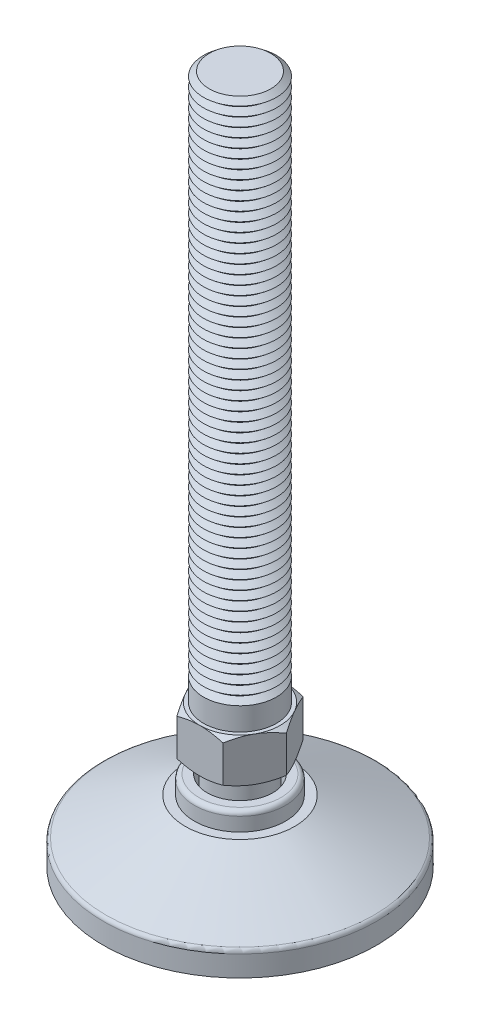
ISO-10303-21;
HEADER;
FILE_DESCRIPTION(('STEP AP214'),'2;1');
FILE_NAME('part.step','',(''),(''),'','','');
FILE_SCHEMA(('AUTOMOTIVE_DESIGN { 1 0 10303 214 1 1 1 1 }'));
ENDSEC;
DATA;
#1=APPLICATION_CONTEXT('core data for automotive mechanical design processes');
#2=APPLICATION_PROTOCOL_DEFINITION('international standard','automotive_design',2000,#1);
#3=PRODUCT_CONTEXT('',#1,'mechanical');
#4=PRODUCT('Part','Part','',(#3));
#5=PRODUCT_RELATED_PRODUCT_CATEGORY('part','',(#4));
#6=PRODUCT_DEFINITION_FORMATION('','',#4);
#7=PRODUCT_DEFINITION_CONTEXT('part definition',#1,'design');
#8=PRODUCT_DEFINITION('design','',#6,#7);
#9=PRODUCT_DEFINITION_SHAPE('','',#8);
#10=(LENGTH_UNIT() NAMED_UNIT(*) SI_UNIT(.MILLI.,.METRE.));
#11=(NAMED_UNIT(*) PLANE_ANGLE_UNIT() SI_UNIT($,.RADIAN.));
#12=(NAMED_UNIT(*) SI_UNIT($,.STERADIAN.) SOLID_ANGLE_UNIT());
#13=UNCERTAINTY_MEASURE_WITH_UNIT(LENGTH_MEASURE(1.E-05),#10,'distance_accuracy_value','');
#14=(GEOMETRIC_REPRESENTATION_CONTEXT(3) GLOBAL_UNCERTAINTY_ASSIGNED_CONTEXT((#13)) GLOBAL_UNIT_ASSIGNED_CONTEXT((#10,
#11,#12)) REPRESENTATION_CONTEXT('',''));
#15=CARTESIAN_POINT('',(0.,0.,0.));
#16=DIRECTION('',(0.,0.,1.));
#17=DIRECTION('',(1.,0.,0.));
#18=AXIS2_PLACEMENT_3D('',#15,#16,#17);
#19=CARTESIAN_POINT('',(0.,3.,0.));
#20=DIRECTION('',(0.,-1.,0.));
#21=DIRECTION('',(0.,0.,-1.));
#22=AXIS2_PLACEMENT_3D('',#19,#20,#21);
#23=CYLINDRICAL_SURFACE('',#22,34.5);
#24=CARTESIAN_POINT('',(0.,3.,0.));
#25=DIRECTION('',(0.,1.,0.));
#26=DIRECTION('',(0.,0.,1.));
#27=AXIS2_PLACEMENT_3D('',#24,#25,#26);
#28=CIRCLE('',#27,34.5);
#29=CARTESIAN_POINT('',(0.,3.,34.5));
#30=VERTEX_POINT('',#29);
#31=EDGE_CURVE('P0_E10',#30,#30,#28,.T.);
#32=ORIENTED_EDGE('',*,*,#31,.F.);
#33=EDGE_LOOP('',(#32));
#34=FACE_BOUND('',#33,.T.);
#35=CARTESIAN_POINT('',(0.,0.,0.));
#36=DIRECTION('',(0.,1.,0.));
#37=DIRECTION('',(0.,0.,1.));
#38=AXIS2_PLACEMENT_3D('',#35,#36,#37);
#39=CIRCLE('',#38,34.5);
#40=CARTESIAN_POINT('',(0.,0.,34.5));
#41=VERTEX_POINT('',#40);
#42=EDGE_CURVE('P0_E17',#41,#41,#39,.T.);
#43=ORIENTED_EDGE('',*,*,#42,.T.);
#44=EDGE_LOOP('',(#43));
#45=FACE_BOUND('',#44,.T.);
#46=ADVANCED_FACE('P0_F14',(#34,#45),#23,.T.);
#47=CARTESIAN_POINT('',(0.,3.,0.));
#48=DIRECTION('',(0.,1.,0.));
#49=DIRECTION('',(0.,0.,1.));
#50=AXIS2_PLACEMENT_3D('',#47,#48,#49);
#51=PLANE('',#50);
#52=CARTESIAN_POINT('',(0.,3.,0.));
#53=DIRECTION('',(0.,1.,0.));
#54=DIRECTION('',(0.,0.,1.));
#55=AXIS2_PLACEMENT_3D('',#52,#53,#54);
#56=CIRCLE('',#55,11.5);
#57=CARTESIAN_POINT('',(0.,3.,11.5));
#58=VERTEX_POINT('',#57);
#59=EDGE_CURVE('P0_E26',#58,#58,#56,.T.);
#60=ORIENTED_EDGE('',*,*,#59,.F.);
#61=EDGE_LOOP('',(#60));
#62=FACE_BOUND('',#61,.T.);
#63=ORIENTED_EDGE('',*,*,#31,.T.);
#64=EDGE_LOOP('',(#63));
#65=FACE_BOUND('',#64,.T.);
#66=ADVANCED_FACE('P0_F41',(#62,#65),#51,.T.);
#67=CARTESIAN_POINT('',(0.,0.,0.));
#68=DIRECTION('',(0.,1.,0.));
#69=DIRECTION('',(0.,0.,1.));
#70=AXIS2_PLACEMENT_3D('',#67,#68,#69);
#71=PLANE('',#70);
#72=ORIENTED_EDGE('',*,*,#42,.F.);
#73=EDGE_LOOP('',(#72));
#74=FACE_BOUND('',#73,.T.);
#75=ADVANCED_FACE('P0_F37',(#74),#71,.F.);
#76=CARTESIAN_POINT('',(0.,2.,0.));
#77=DIRECTION('',(0.,1.,0.));
#78=DIRECTION('',(0.,0.,1.));
#79=AXIS2_PLACEMENT_3D('',#76,#77,#78);
#80=CYLINDRICAL_SURFACE('',#79,11.5);
#81=CARTESIAN_POINT('',(0.,2.,0.));
#82=DIRECTION('',(0.,1.,0.));
#83=DIRECTION('',(0.,0.,1.));
#84=AXIS2_PLACEMENT_3D('',#81,#82,#83);
#85=CIRCLE('',#84,11.5);
#86=CARTESIAN_POINT('',(0.,2.,11.5));
#87=VERTEX_POINT('',#86);
#88=EDGE_CURVE('P0_E24',#87,#87,#85,.T.);
#89=ORIENTED_EDGE('',*,*,#88,.F.);
#90=EDGE_LOOP('',(#89));
#91=FACE_BOUND('',#90,.T.);
#92=ORIENTED_EDGE('',*,*,#59,.T.);
#93=EDGE_LOOP('',(#92));
#94=FACE_BOUND('',#93,.T.);
#95=ADVANCED_FACE('P0_F34',(#91,#94),#80,.F.);
#96=CARTESIAN_POINT('',(0.,2.,0.));
#97=DIRECTION('',(0.,1.,0.));
#98=DIRECTION('',(0.,0.,1.));
#99=AXIS2_PLACEMENT_3D('',#96,#97,#98);
#100=PLANE('',#99);
#101=ORIENTED_EDGE('',*,*,#88,.T.);
#102=EDGE_LOOP('',(#101));
#103=FACE_BOUND('',#102,.T.);
#104=ADVANCED_FACE('P0_F32',(#103),#100,.T.);
#105=CLOSED_SHELL('',(#46,#66,#75,#95,#104));
#106=MANIFOLD_SOLID_BREP('P0_B1',#105);
#107=CARTESIAN_POINT('',(0.,181.,0.));
#108=DIRECTION('',(0.,-1.,0.));
#109=DIRECTION('',(0.,0.,-1.));
#110=AXIS2_PLACEMENT_3D('',#107,#108,#109);
#111=CONICAL_SURFACE('',#110,8.4387505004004,0.895664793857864);
#112=CARTESIAN_POINT('',(0.,179.75,0.));
#113=DIRECTION('',(0.,-1.,0.));
#114=DIRECTION('',(0.,0.,-1.));
#115=AXIS2_PLACEMENT_3D('',#112,#113,#114);
#116=CIRCLE('',#115,10.);
#117=CARTESIAN_POINT('',(0.,179.75,-10.));
#118=VERTEX_POINT('',#117);
#119=EDGE_CURVE('P1_E1976',#118,#118,#116,.T.);
#120=ORIENTED_EDGE('',*,*,#119,.F.);
#121=EDGE_LOOP('',(#120));
#122=FACE_BOUND('',#121,.T.);
#123=CARTESIAN_POINT('',(0.,181.,0.));
#124=DIRECTION('',(0.,-1.,0.));
#125=DIRECTION('',(0.,0.,-1.));
#126=AXIS2_PLACEMENT_3D('',#123,#124,#125);
#127=CIRCLE('',#126,8.4387505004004);
#128=CARTESIAN_POINT('',(0.,181.,-8.4387505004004));
#129=VERTEX_POINT('',#128);
#130=EDGE_CURVE('P1_E1985',#129,#129,#127,.T.);
#131=ORIENTED_EDGE('',*,*,#130,.T.);
#132=EDGE_LOOP('',(#131));
#133=FACE_BOUND('',#132,.T.);
#134=ADVANCED_FACE('P1_F16',(#122,#133),#111,.T.);
#135=CARTESIAN_POINT('',(0.,182.25,0.));
#136=DIRECTION('',(0.,1.,0.));
#137=DIRECTION('',(0.,0.,1.));
#138=AXIS2_PLACEMENT_3D('',#135,#136,#137);
#139=CONICAL_SURFACE('',#138,10.,0.895664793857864);
#140=ORIENTED_EDGE('',*,*,#130,.F.);
#141=EDGE_LOOP('',(#140));
#142=FACE_BOUND('',#141,.T.);
#143=CARTESIAN_POINT('',(0.,182.25,0.));
#144=DIRECTION('',(0.,-1.,0.));
#145=DIRECTION('',(0.,0.,-1.));
#146=AXIS2_PLACEMENT_3D('',#143,#144,#145);
#147=CIRCLE('',#146,10.);
#148=CARTESIAN_POINT('',(0.,182.25,-10.));
#149=VERTEX_POINT('',#148);
#150=EDGE_CURVE('P1_E1982',#149,#149,#147,.T.);
#151=ORIENTED_EDGE('',*,*,#150,.T.);
#152=EDGE_LOOP('',(#151));
#153=FACE_BOUND('',#152,.T.);
#154=ADVANCED_FACE('P1_F308',(#142,#153),#139,.T.);
#155=CARTESIAN_POINT('',(0.,191.,0.));
#156=DIRECTION('',(0.,1.,0.));
#157=DIRECTION('',(0.,0.,1.));
#158=AXIS2_PLACEMENT_3D('',#155,#156,#157);
#159=PLANE('',#158);
#160=CARTESIAN_POINT('',(0.,191.,0.));
#161=DIRECTION('',(0.,-1.,0.));
#162=DIRECTION('',(0.,0.,-1.));
#163=AXIS2_PLACEMENT_3D('',#160,#161,#162);
#164=CIRCLE('',#163,8.4387505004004);
#165=CARTESIAN_POINT('',(0.,191.,-8.4387505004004));
#166=VERTEX_POINT('',#165);
#167=EDGE_CURVE('P1_E143',#166,#166,#164,.T.);
#168=ORIENTED_EDGE('',*,*,#167,.F.);
#169=EDGE_LOOP('',(#168));
#170=FACE_BOUND('',#169,.T.);
#171=ADVANCED_FACE('P1_F314',(#170),#159,.T.);
#172=CARTESIAN_POINT('',(0.,191.,0.));
#173=DIRECTION('',(0.,-1.,0.));
#174=DIRECTION('',(0.,0.,-1.));
#175=AXIS2_PLACEMENT_3D('',#172,#173,#174);
#176=CONICAL_SURFACE('',#175,8.4387505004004,0.895664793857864);
#177=CARTESIAN_POINT('',(0.,189.75,0.));
#178=DIRECTION('',(0.,-1.,0.));
#179=DIRECTION('',(0.,0.,-1.));
#180=AXIS2_PLACEMENT_3D('',#177,#178,#179);
#181=CIRCLE('',#180,10.);
#182=CARTESIAN_POINT('',(0.,189.75,-10.));
#183=VERTEX_POINT('',#182);
#184=EDGE_CURVE('P1_E353',#183,#183,#181,.T.);
#185=ORIENTED_EDGE('',*,*,#184,.F.);
#186=EDGE_LOOP('',(#185));
#187=FACE_BOUND('',#186,.T.);
#188=ORIENTED_EDGE('',*,*,#167,.T.);
#189=EDGE_LOOP('',(#188));
#190=FACE_BOUND('',#189,.T.);
#191=ADVANCED_FACE('P1_F211',(#187,#190),#176,.T.);
#192=CARTESIAN_POINT('',(0.,189.75,0.));
#193=DIRECTION('',(0.,1.,0.));
#194=DIRECTION('',(0.,0.,1.));
#195=AXIS2_PLACEMENT_3D('',#192,#193,#194);
#196=CONICAL_SURFACE('',#195,10.,0.895664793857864);
#197=CARTESIAN_POINT('',(0.,188.5,0.));
#198=DIRECTION('',(0.,-1.,0.));
#199=DIRECTION('',(0.,0.,-1.));
#200=AXIS2_PLACEMENT_3D('',#197,#198,#199);
#201=CIRCLE('',#200,8.4387505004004);
#202=CARTESIAN_POINT('',(0.,188.5,-8.4387505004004));
#203=VERTEX_POINT('',#202);
#204=EDGE_CURVE('P1_E352',#203,#203,#201,.T.);
#205=ORIENTED_EDGE('',*,*,#204,.F.);
#206=EDGE_LOOP('',(#205));
#207=FACE_BOUND('',#206,.T.);
#208=ORIENTED_EDGE('',*,*,#184,.T.);
#209=EDGE_LOOP('',(#208));
#210=FACE_BOUND('',#209,.T.);
#211=ADVANCED_FACE('P1_F339',(#207,#210),#196,.T.);
#212=CARTESIAN_POINT('',(0.,188.5,0.));
#213=DIRECTION('',(0.,-1.,0.));
#214=DIRECTION('',(0.,0.,-1.));
#215=AXIS2_PLACEMENT_3D('',#212,#213,#214);
#216=CONICAL_SURFACE('',#215,8.4387505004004,0.895664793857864);
#217=CARTESIAN_POINT('',(0.,187.25,0.));
#218=DIRECTION('',(0.,-1.,0.));
#219=DIRECTION('',(0.,0.,-1.));
#220=AXIS2_PLACEMENT_3D('',#217,#218,#219);
#221=CIRCLE('',#220,10.);
#222=CARTESIAN_POINT('',(0.,187.25,-10.));
#223=VERTEX_POINT('',#222);
#224=EDGE_CURVE('P1_E349',#223,#223,#221,.T.);
#225=ORIENTED_EDGE('',*,*,#224,.F.);
#226=EDGE_LOOP('',(#225));
#227=FACE_BOUND('',#226,.T.);
#228=ORIENTED_EDGE('',*,*,#204,.T.);
#229=EDGE_LOOP('',(#228));
#230=FACE_BOUND('',#229,.T.);
#231=ADVANCED_FACE('P1_F334',(#227,#230),#216,.T.);
#232=CARTESIAN_POINT('',(0.,187.25,0.));
#233=DIRECTION('',(0.,1.,0.));
#234=DIRECTION('',(0.,0.,1.));
#235=AXIS2_PLACEMENT_3D('',#232,#233,#234);
#236=CONICAL_SURFACE('',#235,10.,0.895664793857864);
#237=CARTESIAN_POINT('',(0.,186.,0.));
#238=DIRECTION('',(0.,-1.,0.));
#239=DIRECTION('',(0.,0.,-1.));
#240=AXIS2_PLACEMENT_3D('',#237,#238,#239);
#241=CIRCLE('',#240,8.4387505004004);
#242=CARTESIAN_POINT('',(0.,186.,-8.4387505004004));
#243=VERTEX_POINT('',#242);
#244=EDGE_CURVE('P1_E358',#243,#243,#241,.T.);
#245=ORIENTED_EDGE('',*,*,#244,.F.);
#246=EDGE_LOOP('',(#245));
#247=FACE_BOUND('',#246,.T.);
#248=ORIENTED_EDGE('',*,*,#224,.T.);
#249=EDGE_LOOP('',(#248));
#250=FACE_BOUND('',#249,.T.);
#251=ADVANCED_FACE('P1_F331',(#247,#250),#236,.T.);
#252=CARTESIAN_POINT('',(0.,186.,0.));
#253=DIRECTION('',(0.,-1.,0.));
#254=DIRECTION('',(0.,0.,-1.));
#255=AXIS2_PLACEMENT_3D('',#252,#253,#254);
#256=CONICAL_SURFACE('',#255,8.4387505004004,0.895664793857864);
#257=CARTESIAN_POINT('',(0.,184.75,0.));
#258=DIRECTION('',(0.,-1.,0.));
#259=DIRECTION('',(0.,0.,-1.));
#260=AXIS2_PLACEMENT_3D('',#257,#258,#259);
#261=CIRCLE('',#260,10.);
#262=CARTESIAN_POINT('',(0.,184.75,-10.));
#263=VERTEX_POINT('',#262);
#264=EDGE_CURVE('P1_E1988',#263,#263,#261,.T.);
#265=ORIENTED_EDGE('',*,*,#264,.F.);
#266=EDGE_LOOP('',(#265));
#267=FACE_BOUND('',#266,.T.);
#268=ORIENTED_EDGE('',*,*,#244,.T.);
#269=EDGE_LOOP('',(#268));
#270=FACE_BOUND('',#269,.T.);
#271=ADVANCED_FACE('P1_F325',(#267,#270),#256,.T.);
#272=CARTESIAN_POINT('',(0.,184.75,0.));
#273=DIRECTION('',(0.,1.,0.));
#274=DIRECTION('',(0.,0.,1.));
#275=AXIS2_PLACEMENT_3D('',#272,#273,#274);
#276=CONICAL_SURFACE('',#275,10.,0.895664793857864);
#277=CARTESIAN_POINT('',(0.,183.5,0.));
#278=DIRECTION('',(0.,-1.,0.));
#279=DIRECTION('',(0.,0.,-1.));
#280=AXIS2_PLACEMENT_3D('',#277,#278,#279);
#281=CIRCLE('',#280,8.4387505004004);
#282=CARTESIAN_POINT('',(0.,183.5,-8.4387505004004));
#283=VERTEX_POINT('',#282);
#284=EDGE_CURVE('P1_E1991',#283,#283,#281,.T.);
#285=ORIENTED_EDGE('',*,*,#284,.F.);
#286=EDGE_LOOP('',(#285));
#287=FACE_BOUND('',#286,.T.);
#288=ORIENTED_EDGE('',*,*,#264,.T.);
#289=EDGE_LOOP('',(#288));
#290=FACE_BOUND('',#289,.T.);
#291=ADVANCED_FACE('P1_F321',(#287,#290),#276,.T.);
#292=CARTESIAN_POINT('',(0.,183.5,0.));
#293=DIRECTION('',(0.,-1.,0.));
#294=DIRECTION('',(0.,0.,-1.));
#295=AXIS2_PLACEMENT_3D('',#292,#293,#294);
#296=CONICAL_SURFACE('',#295,8.4387505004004,0.895664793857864);
#297=ORIENTED_EDGE('',*,*,#150,.F.);
#298=EDGE_LOOP('',(#297));
#299=FACE_BOUND('',#298,.T.);
#300=ORIENTED_EDGE('',*,*,#284,.T.);
#301=EDGE_LOOP('',(#300));
#302=FACE_BOUND('',#301,.T.);
#303=ADVANCED_FACE('P1_F324',(#299,#302),#296,.T.);
#304=CARTESIAN_POINT('',(0.,178.5,0.));
#305=DIRECTION('',(0.,-1.,0.));
#306=DIRECTION('',(0.,0.,-1.));
#307=AXIS2_PLACEMENT_3D('',#304,#305,#306);
#308=CONICAL_SURFACE('',#307,8.4387505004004,0.895664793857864);
#309=CARTESIAN_POINT('',(0.,177.25,0.));
#310=DIRECTION('',(0.,-1.,0.));
#311=DIRECTION('',(0.,0.,-1.));
#312=AXIS2_PLACEMENT_3D('',#309,#310,#311);
#313=CIRCLE('',#312,10.);
#314=CARTESIAN_POINT('',(0.,177.25,-10.));
#315=VERTEX_POINT('',#314);
#316=EDGE_CURVE('P1_E1970',#315,#315,#313,.T.);
#317=ORIENTED_EDGE('',*,*,#316,.F.);
#318=EDGE_LOOP('',(#317));
#319=FACE_BOUND('',#318,.T.);
#320=CARTESIAN_POINT('',(0.,178.5,0.));
#321=DIRECTION('',(0.,-1.,0.));
#322=DIRECTION('',(0.,0.,-1.));
#323=AXIS2_PLACEMENT_3D('',#320,#321,#322);
#324=CIRCLE('',#323,8.4387505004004);
#325=CARTESIAN_POINT('',(0.,178.5,-8.4387505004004));
#326=VERTEX_POINT('',#325);
#327=EDGE_CURVE('P1_E1979',#326,#326,#324,.T.);
#328=ORIENTED_EDGE('',*,*,#327,.T.);
#329=EDGE_LOOP('',(#328));
#330=FACE_BOUND('',#329,.T.);
#331=ADVANCED_FACE('P1_F329',(#319,#330),#308,.T.);
#332=CARTESIAN_POINT('',(0.,179.75,0.));
#333=DIRECTION('',(0.,1.,0.));
#334=DIRECTION('',(0.,0.,1.));
#335=AXIS2_PLACEMENT_3D('',#332,#333,#334);
#336=CONICAL_SURFACE('',#335,10.,0.895664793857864);
#337=ORIENTED_EDGE('',*,*,#327,.F.);
#338=EDGE_LOOP('',(#337));
#339=FACE_BOUND('',#338,.T.);
#340=ORIENTED_EDGE('',*,*,#119,.T.);
#341=EDGE_LOOP('',(#340));
#342=FACE_BOUND('',#341,.T.);
#343=ADVANCED_FACE('P1_F1564',(#339,#342),#336,.T.);
#344=CARTESIAN_POINT('',(0.,176.,0.));
#345=DIRECTION('',(0.,-1.,0.));
#346=DIRECTION('',(0.,0.,-1.));
#347=AXIS2_PLACEMENT_3D('',#344,#345,#346);
#348=CONICAL_SURFACE('',#347,8.4387505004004,0.895664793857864);
#349=CARTESIAN_POINT('',(0.,174.75,0.));
#350=DIRECTION('',(0.,-1.,0.));
#351=DIRECTION('',(0.,0.,-1.));
#352=AXIS2_PLACEMENT_3D('',#349,#350,#351);
#353=CIRCLE('',#352,10.);
#354=CARTESIAN_POINT('',(0.,174.75,-10.));
#355=VERTEX_POINT('',#354);
#356=EDGE_CURVE('P1_E1964',#355,#355,#353,.T.);
#357=ORIENTED_EDGE('',*,*,#356,.F.);
#358=EDGE_LOOP('',(#357));
#359=FACE_BOUND('',#358,.T.);
#360=CARTESIAN_POINT('',(0.,176.,0.));
#361=DIRECTION('',(0.,-1.,0.));
#362=DIRECTION('',(0.,0.,-1.));
#363=AXIS2_PLACEMENT_3D('',#360,#361,#362);
#364=CIRCLE('',#363,8.4387505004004);
#365=CARTESIAN_POINT('',(0.,176.,-8.4387505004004));
#366=VERTEX_POINT('',#365);
#367=EDGE_CURVE('P1_E1973',#366,#366,#364,.T.);
#368=ORIENTED_EDGE('',*,*,#367,.T.);
#369=EDGE_LOOP('',(#368));
#370=FACE_BOUND('',#369,.T.);
#371=ADVANCED_FACE('P1_F1554',(#359,#370),#348,.T.);
#372=CARTESIAN_POINT('',(0.,177.25,0.));
#373=DIRECTION('',(0.,1.,0.));
#374=DIRECTION('',(0.,0.,1.));
#375=AXIS2_PLACEMENT_3D('',#372,#373,#374);
#376=CONICAL_SURFACE('',#375,10.,0.895664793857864);
#377=ORIENTED_EDGE('',*,*,#367,.F.);
#378=EDGE_LOOP('',(#377));
#379=FACE_BOUND('',#378,.T.);
#380=ORIENTED_EDGE('',*,*,#316,.T.);
#381=EDGE_LOOP('',(#380));
#382=FACE_BOUND('',#381,.T.);
#383=ADVANCED_FACE('P1_F1544',(#379,#382),#376,.T.);
#384=CARTESIAN_POINT('',(0.,173.5,0.));
#385=DIRECTION('',(0.,-1.,0.));
#386=DIRECTION('',(0.,0.,-1.));
#387=AXIS2_PLACEMENT_3D('',#384,#385,#386);
#388=CONICAL_SURFACE('',#387,8.4387505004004,0.895664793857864);
#389=CARTESIAN_POINT('',(0.,172.25,0.));
#390=DIRECTION('',(0.,-1.,0.));
#391=DIRECTION('',(0.,0.,-1.));
#392=AXIS2_PLACEMENT_3D('',#389,#390,#391);
#393=CIRCLE('',#392,10.);
#394=CARTESIAN_POINT('',(0.,172.25,-10.));
#395=VERTEX_POINT('',#394);
#396=EDGE_CURVE('P1_E1958',#395,#395,#393,.T.);
#397=ORIENTED_EDGE('',*,*,#396,.F.);
#398=EDGE_LOOP('',(#397));
#399=FACE_BOUND('',#398,.T.);
#400=CARTESIAN_POINT('',(0.,173.5,0.));
#401=DIRECTION('',(0.,-1.,0.));
#402=DIRECTION('',(0.,0.,-1.));
#403=AXIS2_PLACEMENT_3D('',#400,#401,#402);
#404=CIRCLE('',#403,8.4387505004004);
#405=CARTESIAN_POINT('',(0.,173.5,-8.4387505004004));
#406=VERTEX_POINT('',#405);
#407=EDGE_CURVE('P1_E1967',#406,#406,#404,.T.);
#408=ORIENTED_EDGE('',*,*,#407,.T.);
#409=EDGE_LOOP('',(#408));
#410=FACE_BOUND('',#409,.T.);
#411=ADVANCED_FACE('P1_F1534',(#399,#410),#388,.T.);
#412=CARTESIAN_POINT('',(0.,174.75,0.));
#413=DIRECTION('',(0.,1.,0.));
#414=DIRECTION('',(0.,0.,1.));
#415=AXIS2_PLACEMENT_3D('',#412,#413,#414);
#416=CONICAL_SURFACE('',#415,10.,0.895664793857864);
#417=ORIENTED_EDGE('',*,*,#407,.F.);
#418=EDGE_LOOP('',(#417));
#419=FACE_BOUND('',#418,.T.);
#420=ORIENTED_EDGE('',*,*,#356,.T.);
#421=EDGE_LOOP('',(#420));
#422=FACE_BOUND('',#421,.T.);
#423=ADVANCED_FACE('P1_F1524',(#419,#422),#416,.T.);
#424=CARTESIAN_POINT('',(0.,171.,0.));
#425=DIRECTION('',(0.,-1.,0.));
#426=DIRECTION('',(0.,0.,-1.));
#427=AXIS2_PLACEMENT_3D('',#424,#425,#426);
#428=CONICAL_SURFACE('',#427,8.4387505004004,0.895664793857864);
#429=CARTESIAN_POINT('',(0.,169.75,0.));
#430=DIRECTION('',(0.,-1.,0.));
#431=DIRECTION('',(0.,0.,-1.));
#432=AXIS2_PLACEMENT_3D('',#429,#430,#431);
#433=CIRCLE('',#432,10.);
#434=CARTESIAN_POINT('',(0.,169.75,-10.));
#435=VERTEX_POINT('',#434);
#436=EDGE_CURVE('P1_E1952',#435,#435,#433,.T.);
#437=ORIENTED_EDGE('',*,*,#436,.F.);
#438=EDGE_LOOP('',(#437));
#439=FACE_BOUND('',#438,.T.);
#440=CARTESIAN_POINT('',(0.,171.,0.));
#441=DIRECTION('',(0.,-1.,0.));
#442=DIRECTION('',(0.,0.,-1.));
#443=AXIS2_PLACEMENT_3D('',#440,#441,#442);
#444=CIRCLE('',#443,8.4387505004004);
#445=CARTESIAN_POINT('',(0.,171.,-8.4387505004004));
#446=VERTEX_POINT('',#445);
#447=EDGE_CURVE('P1_E1961',#446,#446,#444,.T.);
#448=ORIENTED_EDGE('',*,*,#447,.T.);
#449=EDGE_LOOP('',(#448));
#450=FACE_BOUND('',#449,.T.);
#451=ADVANCED_FACE('P1_F1514',(#439,#450),#428,.T.);
#452=CARTESIAN_POINT('',(0.,172.25,0.));
#453=DIRECTION('',(0.,1.,0.));
#454=DIRECTION('',(0.,0.,1.));
#455=AXIS2_PLACEMENT_3D('',#452,#453,#454);
#456=CONICAL_SURFACE('',#455,10.,0.895664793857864);
#457=ORIENTED_EDGE('',*,*,#447,.F.);
#458=EDGE_LOOP('',(#457));
#459=FACE_BOUND('',#458,.T.);
#460=ORIENTED_EDGE('',*,*,#396,.T.);
#461=EDGE_LOOP('',(#460));
#462=FACE_BOUND('',#461,.T.);
#463=ADVANCED_FACE('P1_F1504',(#459,#462),#456,.T.);
#464=CARTESIAN_POINT('',(0.,168.5,0.));
#465=DIRECTION('',(0.,-1.,0.));
#466=DIRECTION('',(0.,0.,-1.));
#467=AXIS2_PLACEMENT_3D('',#464,#465,#466);
#468=CONICAL_SURFACE('',#467,8.4387505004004,0.895664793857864);
#469=CARTESIAN_POINT('',(0.,167.25,0.));
#470=DIRECTION('',(0.,-1.,0.));
#471=DIRECTION('',(0.,0.,-1.));
#472=AXIS2_PLACEMENT_3D('',#469,#470,#471);
#473=CIRCLE('',#472,10.);
#474=CARTESIAN_POINT('',(0.,167.25,-10.));
#475=VERTEX_POINT('',#474);
#476=EDGE_CURVE('P1_E1946',#475,#475,#473,.T.);
#477=ORIENTED_EDGE('',*,*,#476,.F.);
#478=EDGE_LOOP('',(#477));
#479=FACE_BOUND('',#478,.T.);
#480=CARTESIAN_POINT('',(0.,168.5,0.));
#481=DIRECTION('',(0.,-1.,0.));
#482=DIRECTION('',(0.,0.,-1.));
#483=AXIS2_PLACEMENT_3D('',#480,#481,#482);
#484=CIRCLE('',#483,8.4387505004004);
#485=CARTESIAN_POINT('',(0.,168.5,-8.4387505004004));
#486=VERTEX_POINT('',#485);
#487=EDGE_CURVE('P1_E1955',#486,#486,#484,.T.);
#488=ORIENTED_EDGE('',*,*,#487,.T.);
#489=EDGE_LOOP('',(#488));
#490=FACE_BOUND('',#489,.T.);
#491=ADVANCED_FACE('P1_F1494',(#479,#490),#468,.T.);
#492=CARTESIAN_POINT('',(0.,169.75,0.));
#493=DIRECTION('',(0.,1.,0.));
#494=DIRECTION('',(0.,0.,1.));
#495=AXIS2_PLACEMENT_3D('',#492,#493,#494);
#496=CONICAL_SURFACE('',#495,10.,0.895664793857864);
#497=ORIENTED_EDGE('',*,*,#487,.F.);
#498=EDGE_LOOP('',(#497));
#499=FACE_BOUND('',#498,.T.);
#500=ORIENTED_EDGE('',*,*,#436,.T.);
#501=EDGE_LOOP('',(#500));
#502=FACE_BOUND('',#501,.T.);
#503=ADVANCED_FACE('P1_F1484',(#499,#502),#496,.T.);
#504=CARTESIAN_POINT('',(0.,166.,0.));
#505=DIRECTION('',(0.,-1.,0.));
#506=DIRECTION('',(0.,0.,-1.));
#507=AXIS2_PLACEMENT_3D('',#504,#505,#506);
#508=CONICAL_SURFACE('',#507,8.4387505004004,0.895664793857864);
#509=CARTESIAN_POINT('',(0.,164.75,0.));
#510=DIRECTION('',(0.,-1.,0.));
#511=DIRECTION('',(0.,0.,-1.));
#512=AXIS2_PLACEMENT_3D('',#509,#510,#511);
#513=CIRCLE('',#512,10.);
#514=CARTESIAN_POINT('',(0.,164.75,-10.));
#515=VERTEX_POINT('',#514);
#516=EDGE_CURVE('P1_E1940',#515,#515,#513,.T.);
#517=ORIENTED_EDGE('',*,*,#516,.F.);
#518=EDGE_LOOP('',(#517));
#519=FACE_BOUND('',#518,.T.);
#520=CARTESIAN_POINT('',(0.,166.,0.));
#521=DIRECTION('',(0.,-1.,0.));
#522=DIRECTION('',(0.,0.,-1.));
#523=AXIS2_PLACEMENT_3D('',#520,#521,#522);
#524=CIRCLE('',#523,8.4387505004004);
#525=CARTESIAN_POINT('',(0.,166.,-8.4387505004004));
#526=VERTEX_POINT('',#525);
#527=EDGE_CURVE('P1_E1949',#526,#526,#524,.T.);
#528=ORIENTED_EDGE('',*,*,#527,.T.);
#529=EDGE_LOOP('',(#528));
#530=FACE_BOUND('',#529,.T.);
#531=ADVANCED_FACE('P1_F1474',(#519,#530),#508,.T.);
#532=CARTESIAN_POINT('',(0.,167.25,0.));
#533=DIRECTION('',(0.,1.,0.));
#534=DIRECTION('',(0.,0.,1.));
#535=AXIS2_PLACEMENT_3D('',#532,#533,#534);
#536=CONICAL_SURFACE('',#535,10.,0.895664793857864);
#537=ORIENTED_EDGE('',*,*,#527,.F.);
#538=EDGE_LOOP('',(#537));
#539=FACE_BOUND('',#538,.T.);
#540=ORIENTED_EDGE('',*,*,#476,.T.);
#541=EDGE_LOOP('',(#540));
#542=FACE_BOUND('',#541,.T.);
#543=ADVANCED_FACE('P1_F1464',(#539,#542),#536,.T.);
#544=CARTESIAN_POINT('',(0.,163.5,0.));
#545=DIRECTION('',(0.,-1.,0.));
#546=DIRECTION('',(0.,0.,-1.));
#547=AXIS2_PLACEMENT_3D('',#544,#545,#546);
#548=CONICAL_SURFACE('',#547,8.4387505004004,0.895664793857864);
#549=CARTESIAN_POINT('',(0.,162.25,0.));
#550=DIRECTION('',(0.,-1.,0.));
#551=DIRECTION('',(0.,0.,-1.));
#552=AXIS2_PLACEMENT_3D('',#549,#550,#551);
#553=CIRCLE('',#552,10.);
#554=CARTESIAN_POINT('',(0.,162.25,-10.));
#555=VERTEX_POINT('',#554);
#556=EDGE_CURVE('P1_E1934',#555,#555,#553,.T.);
#557=ORIENTED_EDGE('',*,*,#556,.F.);
#558=EDGE_LOOP('',(#557));
#559=FACE_BOUND('',#558,.T.);
#560=CARTESIAN_POINT('',(0.,163.5,0.));
#561=DIRECTION('',(0.,-1.,0.));
#562=DIRECTION('',(0.,0.,-1.));
#563=AXIS2_PLACEMENT_3D('',#560,#561,#562);
#564=CIRCLE('',#563,8.4387505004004);
#565=CARTESIAN_POINT('',(0.,163.5,-8.4387505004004));
#566=VERTEX_POINT('',#565);
#567=EDGE_CURVE('P1_E1943',#566,#566,#564,.T.);
#568=ORIENTED_EDGE('',*,*,#567,.T.);
#569=EDGE_LOOP('',(#568));
#570=FACE_BOUND('',#569,.T.);
#571=ADVANCED_FACE('P1_F1454',(#559,#570),#548,.T.);
#572=CARTESIAN_POINT('',(0.,164.75,0.));
#573=DIRECTION('',(0.,1.,0.));
#574=DIRECTION('',(0.,0.,1.));
#575=AXIS2_PLACEMENT_3D('',#572,#573,#574);
#576=CONICAL_SURFACE('',#575,10.,0.895664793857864);
#577=ORIENTED_EDGE('',*,*,#567,.F.);
#578=EDGE_LOOP('',(#577));
#579=FACE_BOUND('',#578,.T.);
#580=ORIENTED_EDGE('',*,*,#516,.T.);
#581=EDGE_LOOP('',(#580));
#582=FACE_BOUND('',#581,.T.);
#583=ADVANCED_FACE('P1_F1444',(#579,#582),#576,.T.);
#584=CARTESIAN_POINT('',(0.,161.,0.));
#585=DIRECTION('',(0.,-1.,0.));
#586=DIRECTION('',(0.,0.,-1.));
#587=AXIS2_PLACEMENT_3D('',#584,#585,#586);
#588=CONICAL_SURFACE('',#587,8.4387505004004,0.895664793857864);
#589=CARTESIAN_POINT('',(0.,159.75,0.));
#590=DIRECTION('',(0.,-1.,0.));
#591=DIRECTION('',(0.,0.,-1.));
#592=AXIS2_PLACEMENT_3D('',#589,#590,#591);
#593=CIRCLE('',#592,10.);
#594=CARTESIAN_POINT('',(0.,159.75,-10.));
#595=VERTEX_POINT('',#594);
#596=EDGE_CURVE('P1_E1928',#595,#595,#593,.T.);
#597=ORIENTED_EDGE('',*,*,#596,.F.);
#598=EDGE_LOOP('',(#597));
#599=FACE_BOUND('',#598,.T.);
#600=CARTESIAN_POINT('',(0.,161.,0.));
#601=DIRECTION('',(0.,-1.,0.));
#602=DIRECTION('',(0.,0.,-1.));
#603=AXIS2_PLACEMENT_3D('',#600,#601,#602);
#604=CIRCLE('',#603,8.4387505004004);
#605=CARTESIAN_POINT('',(0.,161.,-8.4387505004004));
#606=VERTEX_POINT('',#605);
#607=EDGE_CURVE('P1_E1937',#606,#606,#604,.T.);
#608=ORIENTED_EDGE('',*,*,#607,.T.);
#609=EDGE_LOOP('',(#608));
#610=FACE_BOUND('',#609,.T.);
#611=ADVANCED_FACE('P1_F1434',(#599,#610),#588,.T.);
#612=CARTESIAN_POINT('',(0.,162.25,0.));
#613=DIRECTION('',(0.,1.,0.));
#614=DIRECTION('',(0.,0.,1.));
#615=AXIS2_PLACEMENT_3D('',#612,#613,#614);
#616=CONICAL_SURFACE('',#615,10.,0.895664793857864);
#617=ORIENTED_EDGE('',*,*,#607,.F.);
#618=EDGE_LOOP('',(#617));
#619=FACE_BOUND('',#618,.T.);
#620=ORIENTED_EDGE('',*,*,#556,.T.);
#621=EDGE_LOOP('',(#620));
#622=FACE_BOUND('',#621,.T.);
#623=ADVANCED_FACE('P1_F1424',(#619,#622),#616,.T.);
#624=CARTESIAN_POINT('',(0.,158.5,0.));
#625=DIRECTION('',(0.,-1.,0.));
#626=DIRECTION('',(0.,0.,-1.));
#627=AXIS2_PLACEMENT_3D('',#624,#625,#626);
#628=CONICAL_SURFACE('',#627,8.4387505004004,0.895664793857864);
#629=CARTESIAN_POINT('',(0.,157.25,0.));
#630=DIRECTION('',(0.,-1.,0.));
#631=DIRECTION('',(0.,0.,-1.));
#632=AXIS2_PLACEMENT_3D('',#629,#630,#631);
#633=CIRCLE('',#632,10.);
#634=CARTESIAN_POINT('',(0.,157.25,-10.));
#635=VERTEX_POINT('',#634);
#636=EDGE_CURVE('P1_E1922',#635,#635,#633,.T.);
#637=ORIENTED_EDGE('',*,*,#636,.F.);
#638=EDGE_LOOP('',(#637));
#639=FACE_BOUND('',#638,.T.);
#640=CARTESIAN_POINT('',(0.,158.5,0.));
#641=DIRECTION('',(0.,-1.,0.));
#642=DIRECTION('',(0.,0.,-1.));
#643=AXIS2_PLACEMENT_3D('',#640,#641,#642);
#644=CIRCLE('',#643,8.4387505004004);
#645=CARTESIAN_POINT('',(0.,158.5,-8.4387505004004));
#646=VERTEX_POINT('',#645);
#647=EDGE_CURVE('P1_E1931',#646,#646,#644,.T.);
#648=ORIENTED_EDGE('',*,*,#647,.T.);
#649=EDGE_LOOP('',(#648));
#650=FACE_BOUND('',#649,.T.);
#651=ADVANCED_FACE('P1_F1414',(#639,#650),#628,.T.);
#652=CARTESIAN_POINT('',(0.,159.75,0.));
#653=DIRECTION('',(0.,1.,0.));
#654=DIRECTION('',(0.,0.,1.));
#655=AXIS2_PLACEMENT_3D('',#652,#653,#654);
#656=CONICAL_SURFACE('',#655,10.,0.895664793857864);
#657=ORIENTED_EDGE('',*,*,#647,.F.);
#658=EDGE_LOOP('',(#657));
#659=FACE_BOUND('',#658,.T.);
#660=ORIENTED_EDGE('',*,*,#596,.T.);
#661=EDGE_LOOP('',(#660));
#662=FACE_BOUND('',#661,.T.);
#663=ADVANCED_FACE('P1_F1404',(#659,#662),#656,.T.);
#664=CARTESIAN_POINT('',(0.,156.,0.));
#665=DIRECTION('',(0.,-1.,0.));
#666=DIRECTION('',(0.,0.,-1.));
#667=AXIS2_PLACEMENT_3D('',#664,#665,#666);
#668=CONICAL_SURFACE('',#667,8.4387505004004,0.895664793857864);
#669=CARTESIAN_POINT('',(0.,154.75,0.));
#670=DIRECTION('',(0.,-1.,0.));
#671=DIRECTION('',(0.,0.,-1.));
#672=AXIS2_PLACEMENT_3D('',#669,#670,#671);
#673=CIRCLE('',#672,10.);
#674=CARTESIAN_POINT('',(0.,154.75,-10.));
#675=VERTEX_POINT('',#674);
#676=EDGE_CURVE('P1_E1916',#675,#675,#673,.T.);
#677=ORIENTED_EDGE('',*,*,#676,.F.);
#678=EDGE_LOOP('',(#677));
#679=FACE_BOUND('',#678,.T.);
#680=CARTESIAN_POINT('',(0.,156.,0.));
#681=DIRECTION('',(0.,-1.,0.));
#682=DIRECTION('',(0.,0.,-1.));
#683=AXIS2_PLACEMENT_3D('',#680,#681,#682);
#684=CIRCLE('',#683,8.4387505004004);
#685=CARTESIAN_POINT('',(0.,156.,-8.4387505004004));
#686=VERTEX_POINT('',#685);
#687=EDGE_CURVE('P1_E1925',#686,#686,#684,.T.);
#688=ORIENTED_EDGE('',*,*,#687,.T.);
#689=EDGE_LOOP('',(#688));
#690=FACE_BOUND('',#689,.T.);
#691=ADVANCED_FACE('P1_F1394',(#679,#690),#668,.T.);
#692=CARTESIAN_POINT('',(0.,157.25,0.));
#693=DIRECTION('',(0.,1.,0.));
#694=DIRECTION('',(0.,0.,1.));
#695=AXIS2_PLACEMENT_3D('',#692,#693,#694);
#696=CONICAL_SURFACE('',#695,10.,0.895664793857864);
#697=ORIENTED_EDGE('',*,*,#687,.F.);
#698=EDGE_LOOP('',(#697));
#699=FACE_BOUND('',#698,.T.);
#700=ORIENTED_EDGE('',*,*,#636,.T.);
#701=EDGE_LOOP('',(#700));
#702=FACE_BOUND('',#701,.T.);
#703=ADVANCED_FACE('P1_F1384',(#699,#702),#696,.T.);
#704=CARTESIAN_POINT('',(0.,153.5,0.));
#705=DIRECTION('',(0.,-1.,0.));
#706=DIRECTION('',(0.,0.,-1.));
#707=AXIS2_PLACEMENT_3D('',#704,#705,#706);
#708=CONICAL_SURFACE('',#707,8.4387505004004,0.895664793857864);
#709=CARTESIAN_POINT('',(0.,152.25,0.));
#710=DIRECTION('',(0.,-1.,0.));
#711=DIRECTION('',(0.,0.,-1.));
#712=AXIS2_PLACEMENT_3D('',#709,#710,#711);
#713=CIRCLE('',#712,10.);
#714=CARTESIAN_POINT('',(0.,152.25,-10.));
#715=VERTEX_POINT('',#714);
#716=EDGE_CURVE('P1_E1910',#715,#715,#713,.T.);
#717=ORIENTED_EDGE('',*,*,#716,.F.);
#718=EDGE_LOOP('',(#717));
#719=FACE_BOUND('',#718,.T.);
#720=CARTESIAN_POINT('',(0.,153.5,0.));
#721=DIRECTION('',(0.,-1.,0.));
#722=DIRECTION('',(0.,0.,-1.));
#723=AXIS2_PLACEMENT_3D('',#720,#721,#722);
#724=CIRCLE('',#723,8.4387505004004);
#725=CARTESIAN_POINT('',(0.,153.5,-8.4387505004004));
#726=VERTEX_POINT('',#725);
#727=EDGE_CURVE('P1_E1919',#726,#726,#724,.T.);
#728=ORIENTED_EDGE('',*,*,#727,.T.);
#729=EDGE_LOOP('',(#728));
#730=FACE_BOUND('',#729,.T.);
#731=ADVANCED_FACE('P1_F1374',(#719,#730),#708,.T.);
#732=CARTESIAN_POINT('',(0.,154.75,0.));
#733=DIRECTION('',(0.,1.,0.));
#734=DIRECTION('',(0.,0.,1.));
#735=AXIS2_PLACEMENT_3D('',#732,#733,#734);
#736=CONICAL_SURFACE('',#735,10.,0.895664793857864);
#737=ORIENTED_EDGE('',*,*,#727,.F.);
#738=EDGE_LOOP('',(#737));
#739=FACE_BOUND('',#738,.T.);
#740=ORIENTED_EDGE('',*,*,#676,.T.);
#741=EDGE_LOOP('',(#740));
#742=FACE_BOUND('',#741,.T.);
#743=ADVANCED_FACE('P1_F1364',(#739,#742),#736,.T.);
#744=CARTESIAN_POINT('',(0.,151.,0.));
#745=DIRECTION('',(0.,-1.,0.));
#746=DIRECTION('',(0.,0.,-1.));
#747=AXIS2_PLACEMENT_3D('',#744,#745,#746);
#748=CONICAL_SURFACE('',#747,8.4387505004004,0.895664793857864);
#749=CARTESIAN_POINT('',(0.,149.75,0.));
#750=DIRECTION('',(0.,-1.,0.));
#751=DIRECTION('',(0.,0.,-1.));
#752=AXIS2_PLACEMENT_3D('',#749,#750,#751);
#753=CIRCLE('',#752,10.);
#754=CARTESIAN_POINT('',(0.,149.75,-10.));
#755=VERTEX_POINT('',#754);
#756=EDGE_CURVE('P1_E1904',#755,#755,#753,.T.);
#757=ORIENTED_EDGE('',*,*,#756,.F.);
#758=EDGE_LOOP('',(#757));
#759=FACE_BOUND('',#758,.T.);
#760=CARTESIAN_POINT('',(0.,151.,0.));
#761=DIRECTION('',(0.,-1.,0.));
#762=DIRECTION('',(0.,0.,-1.));
#763=AXIS2_PLACEMENT_3D('',#760,#761,#762);
#764=CIRCLE('',#763,8.4387505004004);
#765=CARTESIAN_POINT('',(0.,151.,-8.4387505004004));
#766=VERTEX_POINT('',#765);
#767=EDGE_CURVE('P1_E1913',#766,#766,#764,.T.);
#768=ORIENTED_EDGE('',*,*,#767,.T.);
#769=EDGE_LOOP('',(#768));
#770=FACE_BOUND('',#769,.T.);
#771=ADVANCED_FACE('P1_F1354',(#759,#770),#748,.T.);
#772=CARTESIAN_POINT('',(0.,152.25,0.));
#773=DIRECTION('',(0.,1.,0.));
#774=DIRECTION('',(0.,0.,1.));
#775=AXIS2_PLACEMENT_3D('',#772,#773,#774);
#776=CONICAL_SURFACE('',#775,10.,0.895664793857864);
#777=ORIENTED_EDGE('',*,*,#767,.F.);
#778=EDGE_LOOP('',(#777));
#779=FACE_BOUND('',#778,.T.);
#780=ORIENTED_EDGE('',*,*,#716,.T.);
#781=EDGE_LOOP('',(#780));
#782=FACE_BOUND('',#781,.T.);
#783=ADVANCED_FACE('P1_F1344',(#779,#782),#776,.T.);
#784=CARTESIAN_POINT('',(0.,148.5,0.));
#785=DIRECTION('',(0.,-1.,0.));
#786=DIRECTION('',(0.,0.,-1.));
#787=AXIS2_PLACEMENT_3D('',#784,#785,#786);
#788=CONICAL_SURFACE('',#787,8.4387505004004,0.895664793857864);
#789=CARTESIAN_POINT('',(0.,147.25,0.));
#790=DIRECTION('',(0.,-1.,0.));
#791=DIRECTION('',(0.,0.,-1.));
#792=AXIS2_PLACEMENT_3D('',#789,#790,#791);
#793=CIRCLE('',#792,10.);
#794=CARTESIAN_POINT('',(0.,147.25,-10.));
#795=VERTEX_POINT('',#794);
#796=EDGE_CURVE('P1_E1898',#795,#795,#793,.T.);
#797=ORIENTED_EDGE('',*,*,#796,.F.);
#798=EDGE_LOOP('',(#797));
#799=FACE_BOUND('',#798,.T.);
#800=CARTESIAN_POINT('',(0.,148.5,0.));
#801=DIRECTION('',(0.,-1.,0.));
#802=DIRECTION('',(0.,0.,-1.));
#803=AXIS2_PLACEMENT_3D('',#800,#801,#802);
#804=CIRCLE('',#803,8.4387505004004);
#805=CARTESIAN_POINT('',(0.,148.5,-8.4387505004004));
#806=VERTEX_POINT('',#805);
#807=EDGE_CURVE('P1_E1907',#806,#806,#804,.T.);
#808=ORIENTED_EDGE('',*,*,#807,.T.);
#809=EDGE_LOOP('',(#808));
#810=FACE_BOUND('',#809,.T.);
#811=ADVANCED_FACE('P1_F1334',(#799,#810),#788,.T.);
#812=CARTESIAN_POINT('',(0.,149.75,0.));
#813=DIRECTION('',(0.,1.,0.));
#814=DIRECTION('',(0.,0.,1.));
#815=AXIS2_PLACEMENT_3D('',#812,#813,#814);
#816=CONICAL_SURFACE('',#815,10.,0.895664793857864);
#817=ORIENTED_EDGE('',*,*,#807,.F.);
#818=EDGE_LOOP('',(#817));
#819=FACE_BOUND('',#818,.T.);
#820=ORIENTED_EDGE('',*,*,#756,.T.);
#821=EDGE_LOOP('',(#820));
#822=FACE_BOUND('',#821,.T.);
#823=ADVANCED_FACE('P1_F1324',(#819,#822),#816,.T.);
#824=CARTESIAN_POINT('',(0.,146.,0.));
#825=DIRECTION('',(0.,-1.,0.));
#826=DIRECTION('',(0.,0.,-1.));
#827=AXIS2_PLACEMENT_3D('',#824,#825,#826);
#828=CONICAL_SURFACE('',#827,8.4387505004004,0.895664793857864);
#829=CARTESIAN_POINT('',(0.,144.75,0.));
#830=DIRECTION('',(0.,-1.,0.));
#831=DIRECTION('',(0.,0.,-1.));
#832=AXIS2_PLACEMENT_3D('',#829,#830,#831);
#833=CIRCLE('',#832,10.);
#834=CARTESIAN_POINT('',(0.,144.75,-10.));
#835=VERTEX_POINT('',#834);
#836=EDGE_CURVE('P1_E1892',#835,#835,#833,.T.);
#837=ORIENTED_EDGE('',*,*,#836,.F.);
#838=EDGE_LOOP('',(#837));
#839=FACE_BOUND('',#838,.T.);
#840=CARTESIAN_POINT('',(0.,146.,0.));
#841=DIRECTION('',(0.,-1.,0.));
#842=DIRECTION('',(0.,0.,-1.));
#843=AXIS2_PLACEMENT_3D('',#840,#841,#842);
#844=CIRCLE('',#843,8.4387505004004);
#845=CARTESIAN_POINT('',(0.,146.,-8.4387505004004));
#846=VERTEX_POINT('',#845);
#847=EDGE_CURVE('P1_E1901',#846,#846,#844,.T.);
#848=ORIENTED_EDGE('',*,*,#847,.T.);
#849=EDGE_LOOP('',(#848));
#850=FACE_BOUND('',#849,.T.);
#851=ADVANCED_FACE('P1_F1314',(#839,#850),#828,.T.);
#852=CARTESIAN_POINT('',(0.,147.25,0.));
#853=DIRECTION('',(0.,1.,0.));
#854=DIRECTION('',(0.,0.,1.));
#855=AXIS2_PLACEMENT_3D('',#852,#853,#854);
#856=CONICAL_SURFACE('',#855,10.,0.895664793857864);
#857=ORIENTED_EDGE('',*,*,#847,.F.);
#858=EDGE_LOOP('',(#857));
#859=FACE_BOUND('',#858,.T.);
#860=ORIENTED_EDGE('',*,*,#796,.T.);
#861=EDGE_LOOP('',(#860));
#862=FACE_BOUND('',#861,.T.);
#863=ADVANCED_FACE('P1_F1304',(#859,#862),#856,.T.);
#864=CARTESIAN_POINT('',(0.,143.5,0.));
#865=DIRECTION('',(0.,-1.,0.));
#866=DIRECTION('',(0.,0.,-1.));
#867=AXIS2_PLACEMENT_3D('',#864,#865,#866);
#868=CONICAL_SURFACE('',#867,8.4387505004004,0.895664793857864);
#869=CARTESIAN_POINT('',(0.,142.25,0.));
#870=DIRECTION('',(0.,-1.,0.));
#871=DIRECTION('',(0.,0.,-1.));
#872=AXIS2_PLACEMENT_3D('',#869,#870,#871);
#873=CIRCLE('',#872,10.);
#874=CARTESIAN_POINT('',(0.,142.25,-10.));
#875=VERTEX_POINT('',#874);
#876=EDGE_CURVE('P1_E1886',#875,#875,#873,.T.);
#877=ORIENTED_EDGE('',*,*,#876,.F.);
#878=EDGE_LOOP('',(#877));
#879=FACE_BOUND('',#878,.T.);
#880=CARTESIAN_POINT('',(0.,143.5,0.));
#881=DIRECTION('',(0.,-1.,0.));
#882=DIRECTION('',(0.,0.,-1.));
#883=AXIS2_PLACEMENT_3D('',#880,#881,#882);
#884=CIRCLE('',#883,8.4387505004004);
#885=CARTESIAN_POINT('',(0.,143.5,-8.4387505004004));
#886=VERTEX_POINT('',#885);
#887=EDGE_CURVE('P1_E1895',#886,#886,#884,.T.);
#888=ORIENTED_EDGE('',*,*,#887,.T.);
#889=EDGE_LOOP('',(#888));
#890=FACE_BOUND('',#889,.T.);
#891=ADVANCED_FACE('P1_F1294',(#879,#890),#868,.T.);
#892=CARTESIAN_POINT('',(0.,144.75,0.));
#893=DIRECTION('',(0.,1.,0.));
#894=DIRECTION('',(0.,0.,1.));
#895=AXIS2_PLACEMENT_3D('',#892,#893,#894);
#896=CONICAL_SURFACE('',#895,10.,0.895664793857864);
#897=ORIENTED_EDGE('',*,*,#887,.F.);
#898=EDGE_LOOP('',(#897));
#899=FACE_BOUND('',#898,.T.);
#900=ORIENTED_EDGE('',*,*,#836,.T.);
#901=EDGE_LOOP('',(#900));
#902=FACE_BOUND('',#901,.T.);
#903=ADVANCED_FACE('P1_F1284',(#899,#902),#896,.T.);
#904=CARTESIAN_POINT('',(0.,141.,0.));
#905=DIRECTION('',(0.,-1.,0.));
#906=DIRECTION('',(0.,0.,-1.));
#907=AXIS2_PLACEMENT_3D('',#904,#905,#906);
#908=CONICAL_SURFACE('',#907,8.4387505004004,0.895664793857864);
#909=CARTESIAN_POINT('',(0.,139.75,0.));
#910=DIRECTION('',(0.,-1.,0.));
#911=DIRECTION('',(0.,0.,-1.));
#912=AXIS2_PLACEMENT_3D('',#909,#910,#911);
#913=CIRCLE('',#912,10.);
#914=CARTESIAN_POINT('',(0.,139.75,-10.));
#915=VERTEX_POINT('',#914);
#916=EDGE_CURVE('P1_E1880',#915,#915,#913,.T.);
#917=ORIENTED_EDGE('',*,*,#916,.F.);
#918=EDGE_LOOP('',(#917));
#919=FACE_BOUND('',#918,.T.);
#920=CARTESIAN_POINT('',(0.,141.,0.));
#921=DIRECTION('',(0.,-1.,0.));
#922=DIRECTION('',(0.,0.,-1.));
#923=AXIS2_PLACEMENT_3D('',#920,#921,#922);
#924=CIRCLE('',#923,8.4387505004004);
#925=CARTESIAN_POINT('',(0.,141.,-8.4387505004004));
#926=VERTEX_POINT('',#925);
#927=EDGE_CURVE('P1_E1889',#926,#926,#924,.T.);
#928=ORIENTED_EDGE('',*,*,#927,.T.);
#929=EDGE_LOOP('',(#928));
#930=FACE_BOUND('',#929,.T.);
#931=ADVANCED_FACE('P1_F1274',(#919,#930),#908,.T.);
#932=CARTESIAN_POINT('',(0.,142.25,0.));
#933=DIRECTION('',(0.,1.,0.));
#934=DIRECTION('',(0.,0.,1.));
#935=AXIS2_PLACEMENT_3D('',#932,#933,#934);
#936=CONICAL_SURFACE('',#935,10.,0.895664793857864);
#937=ORIENTED_EDGE('',*,*,#927,.F.);
#938=EDGE_LOOP('',(#937));
#939=FACE_BOUND('',#938,.T.);
#940=ORIENTED_EDGE('',*,*,#876,.T.);
#941=EDGE_LOOP('',(#940));
#942=FACE_BOUND('',#941,.T.);
#943=ADVANCED_FACE('P1_F1264',(#939,#942),#936,.T.);
#944=CARTESIAN_POINT('',(0.,138.5,0.));
#945=DIRECTION('',(0.,-1.,0.));
#946=DIRECTION('',(0.,0.,-1.));
#947=AXIS2_PLACEMENT_3D('',#944,#945,#946);
#948=CONICAL_SURFACE('',#947,8.4387505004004,0.895664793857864);
#949=CARTESIAN_POINT('',(0.,137.25,0.));
#950=DIRECTION('',(0.,-1.,0.));
#951=DIRECTION('',(0.,0.,-1.));
#952=AXIS2_PLACEMENT_3D('',#949,#950,#951);
#953=CIRCLE('',#952,10.);
#954=CARTESIAN_POINT('',(0.,137.25,-10.));
#955=VERTEX_POINT('',#954);
#956=EDGE_CURVE('P1_E1874',#955,#955,#953,.T.);
#957=ORIENTED_EDGE('',*,*,#956,.F.);
#958=EDGE_LOOP('',(#957));
#959=FACE_BOUND('',#958,.T.);
#960=CARTESIAN_POINT('',(0.,138.5,0.));
#961=DIRECTION('',(0.,-1.,0.));
#962=DIRECTION('',(0.,0.,-1.));
#963=AXIS2_PLACEMENT_3D('',#960,#961,#962);
#964=CIRCLE('',#963,8.4387505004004);
#965=CARTESIAN_POINT('',(0.,138.5,-8.4387505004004));
#966=VERTEX_POINT('',#965);
#967=EDGE_CURVE('P1_E1883',#966,#966,#964,.T.);
#968=ORIENTED_EDGE('',*,*,#967,.T.);
#969=EDGE_LOOP('',(#968));
#970=FACE_BOUND('',#969,.T.);
#971=ADVANCED_FACE('P1_F1254',(#959,#970),#948,.T.);
#972=CARTESIAN_POINT('',(0.,139.75,0.));
#973=DIRECTION('',(0.,1.,0.));
#974=DIRECTION('',(0.,0.,1.));
#975=AXIS2_PLACEMENT_3D('',#972,#973,#974);
#976=CONICAL_SURFACE('',#975,10.,0.895664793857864);
#977=ORIENTED_EDGE('',*,*,#967,.F.);
#978=EDGE_LOOP('',(#977));
#979=FACE_BOUND('',#978,.T.);
#980=ORIENTED_EDGE('',*,*,#916,.T.);
#981=EDGE_LOOP('',(#980));
#982=FACE_BOUND('',#981,.T.);
#983=ADVANCED_FACE('P1_F1244',(#979,#982),#976,.T.);
#984=CARTESIAN_POINT('',(0.,136.,0.));
#985=DIRECTION('',(0.,-1.,0.));
#986=DIRECTION('',(0.,0.,-1.));
#987=AXIS2_PLACEMENT_3D('',#984,#985,#986);
#988=CONICAL_SURFACE('',#987,8.4387505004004,0.895664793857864);
#989=CARTESIAN_POINT('',(0.,134.75,0.));
#990=DIRECTION('',(0.,-1.,0.));
#991=DIRECTION('',(0.,0.,-1.));
#992=AXIS2_PLACEMENT_3D('',#989,#990,#991);
#993=CIRCLE('',#992,10.);
#994=CARTESIAN_POINT('',(0.,134.75,-10.));
#995=VERTEX_POINT('',#994);
#996=EDGE_CURVE('P1_E1868',#995,#995,#993,.T.);
#997=ORIENTED_EDGE('',*,*,#996,.F.);
#998=EDGE_LOOP('',(#997));
#999=FACE_BOUND('',#998,.T.);
#1000=CARTESIAN_POINT('',(0.,136.,0.));
#1001=DIRECTION('',(0.,-1.,0.));
#1002=DIRECTION('',(0.,0.,-1.));
#1003=AXIS2_PLACEMENT_3D('',#1000,#1001,#1002);
#1004=CIRCLE('',#1003,8.4387505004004);
#1005=CARTESIAN_POINT('',(0.,136.,-8.4387505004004));
#1006=VERTEX_POINT('',#1005);
#1007=EDGE_CURVE('P1_E1877',#1006,#1006,#1004,.T.);
#1008=ORIENTED_EDGE('',*,*,#1007,.T.);
#1009=EDGE_LOOP('',(#1008));
#1010=FACE_BOUND('',#1009,.T.);
#1011=ADVANCED_FACE('P1_F1234',(#999,#1010),#988,.T.);
#1012=CARTESIAN_POINT('',(0.,137.25,0.));
#1013=DIRECTION('',(0.,1.,0.));
#1014=DIRECTION('',(0.,0.,1.));
#1015=AXIS2_PLACEMENT_3D('',#1012,#1013,#1014);
#1016=CONICAL_SURFACE('',#1015,10.,0.895664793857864);
#1017=ORIENTED_EDGE('',*,*,#1007,.F.);
#1018=EDGE_LOOP('',(#1017));
#1019=FACE_BOUND('',#1018,.T.);
#1020=ORIENTED_EDGE('',*,*,#956,.T.);
#1021=EDGE_LOOP('',(#1020));
#1022=FACE_BOUND('',#1021,.T.);
#1023=ADVANCED_FACE('P1_F1224',(#1019,#1022),#1016,.T.);
#1024=CARTESIAN_POINT('',(0.,133.5,0.));
#1025=DIRECTION('',(0.,-1.,0.));
#1026=DIRECTION('',(0.,0.,-1.));
#1027=AXIS2_PLACEMENT_3D('',#1024,#1025,#1026);
#1028=CONICAL_SURFACE('',#1027,8.4387505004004,0.895664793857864);
#1029=CARTESIAN_POINT('',(0.,132.25,0.));
#1030=DIRECTION('',(0.,-1.,0.));
#1031=DIRECTION('',(0.,0.,-1.));
#1032=AXIS2_PLACEMENT_3D('',#1029,#1030,#1031);
#1033=CIRCLE('',#1032,10.);
#1034=CARTESIAN_POINT('',(0.,132.25,-10.));
#1035=VERTEX_POINT('',#1034);
#1036=EDGE_CURVE('P1_E1862',#1035,#1035,#1033,.T.);
#1037=ORIENTED_EDGE('',*,*,#1036,.F.);
#1038=EDGE_LOOP('',(#1037));
#1039=FACE_BOUND('',#1038,.T.);
#1040=CARTESIAN_POINT('',(0.,133.5,0.));
#1041=DIRECTION('',(0.,-1.,0.));
#1042=DIRECTION('',(0.,0.,-1.));
#1043=AXIS2_PLACEMENT_3D('',#1040,#1041,#1042);
#1044=CIRCLE('',#1043,8.4387505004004);
#1045=CARTESIAN_POINT('',(0.,133.5,-8.4387505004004));
#1046=VERTEX_POINT('',#1045);
#1047=EDGE_CURVE('P1_E1871',#1046,#1046,#1044,.T.);
#1048=ORIENTED_EDGE('',*,*,#1047,.T.);
#1049=EDGE_LOOP('',(#1048));
#1050=FACE_BOUND('',#1049,.T.);
#1051=ADVANCED_FACE('P1_F1214',(#1039,#1050),#1028,.T.);
#1052=CARTESIAN_POINT('',(0.,134.75,0.));
#1053=DIRECTION('',(0.,1.,0.));
#1054=DIRECTION('',(0.,0.,1.));
#1055=AXIS2_PLACEMENT_3D('',#1052,#1053,#1054);
#1056=CONICAL_SURFACE('',#1055,10.,0.895664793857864);
#1057=ORIENTED_EDGE('',*,*,#1047,.F.);
#1058=EDGE_LOOP('',(#1057));
#1059=FACE_BOUND('',#1058,.T.);
#1060=ORIENTED_EDGE('',*,*,#996,.T.);
#1061=EDGE_LOOP('',(#1060));
#1062=FACE_BOUND('',#1061,.T.);
#1063=ADVANCED_FACE('P1_F1204',(#1059,#1062),#1056,.T.);
#1064=CARTESIAN_POINT('',(0.,131.,0.));
#1065=DIRECTION('',(0.,-1.,0.));
#1066=DIRECTION('',(0.,0.,-1.));
#1067=AXIS2_PLACEMENT_3D('',#1064,#1065,#1066);
#1068=CONICAL_SURFACE('',#1067,8.4387505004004,0.895664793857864);
#1069=CARTESIAN_POINT('',(0.,129.75,0.));
#1070=DIRECTION('',(0.,-1.,0.));
#1071=DIRECTION('',(0.,0.,-1.));
#1072=AXIS2_PLACEMENT_3D('',#1069,#1070,#1071);
#1073=CIRCLE('',#1072,10.);
#1074=CARTESIAN_POINT('',(0.,129.75,-10.));
#1075=VERTEX_POINT('',#1074);
#1076=EDGE_CURVE('P1_E1856',#1075,#1075,#1073,.T.);
#1077=ORIENTED_EDGE('',*,*,#1076,.F.);
#1078=EDGE_LOOP('',(#1077));
#1079=FACE_BOUND('',#1078,.T.);
#1080=CARTESIAN_POINT('',(0.,131.,0.));
#1081=DIRECTION('',(0.,-1.,0.));
#1082=DIRECTION('',(0.,0.,-1.));
#1083=AXIS2_PLACEMENT_3D('',#1080,#1081,#1082);
#1084=CIRCLE('',#1083,8.4387505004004);
#1085=CARTESIAN_POINT('',(0.,131.,-8.4387505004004));
#1086=VERTEX_POINT('',#1085);
#1087=EDGE_CURVE('P1_E1865',#1086,#1086,#1084,.T.);
#1088=ORIENTED_EDGE('',*,*,#1087,.T.);
#1089=EDGE_LOOP('',(#1088));
#1090=FACE_BOUND('',#1089,.T.);
#1091=ADVANCED_FACE('P1_F1194',(#1079,#1090),#1068,.T.);
#1092=CARTESIAN_POINT('',(0.,132.25,0.));
#1093=DIRECTION('',(0.,1.,0.));
#1094=DIRECTION('',(0.,0.,1.));
#1095=AXIS2_PLACEMENT_3D('',#1092,#1093,#1094);
#1096=CONICAL_SURFACE('',#1095,10.,0.895664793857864);
#1097=ORIENTED_EDGE('',*,*,#1087,.F.);
#1098=EDGE_LOOP('',(#1097));
#1099=FACE_BOUND('',#1098,.T.);
#1100=ORIENTED_EDGE('',*,*,#1036,.T.);
#1101=EDGE_LOOP('',(#1100));
#1102=FACE_BOUND('',#1101,.T.);
#1103=ADVANCED_FACE('P1_F1184',(#1099,#1102),#1096,.T.);
#1104=CARTESIAN_POINT('',(0.,128.5,0.));
#1105=DIRECTION('',(0.,-1.,0.));
#1106=DIRECTION('',(0.,0.,-1.));
#1107=AXIS2_PLACEMENT_3D('',#1104,#1105,#1106);
#1108=CONICAL_SURFACE('',#1107,8.4387505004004,0.895664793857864);
#1109=CARTESIAN_POINT('',(0.,127.25,0.));
#1110=DIRECTION('',(0.,-1.,0.));
#1111=DIRECTION('',(0.,0.,-1.));
#1112=AXIS2_PLACEMENT_3D('',#1109,#1110,#1111);
#1113=CIRCLE('',#1112,10.);
#1114=CARTESIAN_POINT('',(0.,127.25,-10.));
#1115=VERTEX_POINT('',#1114);
#1116=EDGE_CURVE('P1_E1850',#1115,#1115,#1113,.T.);
#1117=ORIENTED_EDGE('',*,*,#1116,.F.);
#1118=EDGE_LOOP('',(#1117));
#1119=FACE_BOUND('',#1118,.T.);
#1120=CARTESIAN_POINT('',(0.,128.5,0.));
#1121=DIRECTION('',(0.,-1.,0.));
#1122=DIRECTION('',(0.,0.,-1.));
#1123=AXIS2_PLACEMENT_3D('',#1120,#1121,#1122);
#1124=CIRCLE('',#1123,8.4387505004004);
#1125=CARTESIAN_POINT('',(0.,128.5,-8.4387505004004));
#1126=VERTEX_POINT('',#1125);
#1127=EDGE_CURVE('P1_E1859',#1126,#1126,#1124,.T.);
#1128=ORIENTED_EDGE('',*,*,#1127,.T.);
#1129=EDGE_LOOP('',(#1128));
#1130=FACE_BOUND('',#1129,.T.);
#1131=ADVANCED_FACE('P1_F1174',(#1119,#1130),#1108,.T.);
#1132=CARTESIAN_POINT('',(0.,129.75,0.));
#1133=DIRECTION('',(0.,1.,0.));
#1134=DIRECTION('',(0.,0.,1.));
#1135=AXIS2_PLACEMENT_3D('',#1132,#1133,#1134);
#1136=CONICAL_SURFACE('',#1135,10.,0.895664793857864);
#1137=ORIENTED_EDGE('',*,*,#1127,.F.);
#1138=EDGE_LOOP('',(#1137));
#1139=FACE_BOUND('',#1138,.T.);
#1140=ORIENTED_EDGE('',*,*,#1076,.T.);
#1141=EDGE_LOOP('',(#1140));
#1142=FACE_BOUND('',#1141,.T.);
#1143=ADVANCED_FACE('P1_F1164',(#1139,#1142),#1136,.T.);
#1144=CARTESIAN_POINT('',(0.,126.,0.));
#1145=DIRECTION('',(0.,-1.,0.));
#1146=DIRECTION('',(0.,0.,-1.));
#1147=AXIS2_PLACEMENT_3D('',#1144,#1145,#1146);
#1148=CONICAL_SURFACE('',#1147,8.4387505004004,0.895664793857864);
#1149=CARTESIAN_POINT('',(0.,124.75,0.));
#1150=DIRECTION('',(0.,-1.,0.));
#1151=DIRECTION('',(0.,0.,-1.));
#1152=AXIS2_PLACEMENT_3D('',#1149,#1150,#1151);
#1153=CIRCLE('',#1152,10.);
#1154=CARTESIAN_POINT('',(0.,124.75,-10.));
#1155=VERTEX_POINT('',#1154);
#1156=EDGE_CURVE('P1_E1844',#1155,#1155,#1153,.T.);
#1157=ORIENTED_EDGE('',*,*,#1156,.F.);
#1158=EDGE_LOOP('',(#1157));
#1159=FACE_BOUND('',#1158,.T.);
#1160=CARTESIAN_POINT('',(0.,126.,0.));
#1161=DIRECTION('',(0.,-1.,0.));
#1162=DIRECTION('',(0.,0.,-1.));
#1163=AXIS2_PLACEMENT_3D('',#1160,#1161,#1162);
#1164=CIRCLE('',#1163,8.4387505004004);
#1165=CARTESIAN_POINT('',(0.,126.,-8.4387505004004));
#1166=VERTEX_POINT('',#1165);
#1167=EDGE_CURVE('P1_E1853',#1166,#1166,#1164,.T.);
#1168=ORIENTED_EDGE('',*,*,#1167,.T.);
#1169=EDGE_LOOP('',(#1168));
#1170=FACE_BOUND('',#1169,.T.);
#1171=ADVANCED_FACE('P1_F1154',(#1159,#1170),#1148,.T.);
#1172=CARTESIAN_POINT('',(0.,127.25,0.));
#1173=DIRECTION('',(0.,1.,0.));
#1174=DIRECTION('',(0.,0.,1.));
#1175=AXIS2_PLACEMENT_3D('',#1172,#1173,#1174);
#1176=CONICAL_SURFACE('',#1175,10.,0.895664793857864);
#1177=ORIENTED_EDGE('',*,*,#1167,.F.);
#1178=EDGE_LOOP('',(#1177));
#1179=FACE_BOUND('',#1178,.T.);
#1180=ORIENTED_EDGE('',*,*,#1116,.T.);
#1181=EDGE_LOOP('',(#1180));
#1182=FACE_BOUND('',#1181,.T.);
#1183=ADVANCED_FACE('P1_F1144',(#1179,#1182),#1176,.T.);
#1184=CARTESIAN_POINT('',(0.,123.5,0.));
#1185=DIRECTION('',(0.,-1.,0.));
#1186=DIRECTION('',(0.,0.,-1.));
#1187=AXIS2_PLACEMENT_3D('',#1184,#1185,#1186);
#1188=CONICAL_SURFACE('',#1187,8.4387505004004,0.895664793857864);
#1189=CARTESIAN_POINT('',(0.,122.25,0.));
#1190=DIRECTION('',(0.,-1.,0.));
#1191=DIRECTION('',(0.,0.,-1.));
#1192=AXIS2_PLACEMENT_3D('',#1189,#1190,#1191);
#1193=CIRCLE('',#1192,10.);
#1194=CARTESIAN_POINT('',(0.,122.25,-10.));
#1195=VERTEX_POINT('',#1194);
#1196=EDGE_CURVE('P1_E1838',#1195,#1195,#1193,.T.);
#1197=ORIENTED_EDGE('',*,*,#1196,.F.);
#1198=EDGE_LOOP('',(#1197));
#1199=FACE_BOUND('',#1198,.T.);
#1200=CARTESIAN_POINT('',(0.,123.5,0.));
#1201=DIRECTION('',(0.,-1.,0.));
#1202=DIRECTION('',(0.,0.,-1.));
#1203=AXIS2_PLACEMENT_3D('',#1200,#1201,#1202);
#1204=CIRCLE('',#1203,8.4387505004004);
#1205=CARTESIAN_POINT('',(0.,123.5,-8.4387505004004));
#1206=VERTEX_POINT('',#1205);
#1207=EDGE_CURVE('P1_E1847',#1206,#1206,#1204,.T.);
#1208=ORIENTED_EDGE('',*,*,#1207,.T.);
#1209=EDGE_LOOP('',(#1208));
#1210=FACE_BOUND('',#1209,.T.);
#1211=ADVANCED_FACE('P1_F1134',(#1199,#1210),#1188,.T.);
#1212=CARTESIAN_POINT('',(0.,124.75,0.));
#1213=DIRECTION('',(0.,1.,0.));
#1214=DIRECTION('',(0.,0.,1.));
#1215=AXIS2_PLACEMENT_3D('',#1212,#1213,#1214);
#1216=CONICAL_SURFACE('',#1215,10.,0.895664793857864);
#1217=ORIENTED_EDGE('',*,*,#1207,.F.);
#1218=EDGE_LOOP('',(#1217));
#1219=FACE_BOUND('',#1218,.T.);
#1220=ORIENTED_EDGE('',*,*,#1156,.T.);
#1221=EDGE_LOOP('',(#1220));
#1222=FACE_BOUND('',#1221,.T.);
#1223=ADVANCED_FACE('P1_F1124',(#1219,#1222),#1216,.T.);
#1224=CARTESIAN_POINT('',(0.,121.,0.));
#1225=DIRECTION('',(0.,-1.,0.));
#1226=DIRECTION('',(0.,0.,-1.));
#1227=AXIS2_PLACEMENT_3D('',#1224,#1225,#1226);
#1228=CONICAL_SURFACE('',#1227,8.4387505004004,0.895664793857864);
#1229=CARTESIAN_POINT('',(0.,119.75,0.));
#1230=DIRECTION('',(0.,-1.,0.));
#1231=DIRECTION('',(0.,0.,-1.));
#1232=AXIS2_PLACEMENT_3D('',#1229,#1230,#1231);
#1233=CIRCLE('',#1232,10.);
#1234=CARTESIAN_POINT('',(0.,119.75,-10.));
#1235=VERTEX_POINT('',#1234);
#1236=EDGE_CURVE('P1_E1832',#1235,#1235,#1233,.T.);
#1237=ORIENTED_EDGE('',*,*,#1236,.F.);
#1238=EDGE_LOOP('',(#1237));
#1239=FACE_BOUND('',#1238,.T.);
#1240=CARTESIAN_POINT('',(0.,121.,0.));
#1241=DIRECTION('',(0.,-1.,0.));
#1242=DIRECTION('',(0.,0.,-1.));
#1243=AXIS2_PLACEMENT_3D('',#1240,#1241,#1242);
#1244=CIRCLE('',#1243,8.4387505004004);
#1245=CARTESIAN_POINT('',(0.,121.,-8.4387505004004));
#1246=VERTEX_POINT('',#1245);
#1247=EDGE_CURVE('P1_E1841',#1246,#1246,#1244,.T.);
#1248=ORIENTED_EDGE('',*,*,#1247,.T.);
#1249=EDGE_LOOP('',(#1248));
#1250=FACE_BOUND('',#1249,.T.);
#1251=ADVANCED_FACE('P1_F1114',(#1239,#1250),#1228,.T.);
#1252=CARTESIAN_POINT('',(0.,122.25,0.));
#1253=DIRECTION('',(0.,1.,0.));
#1254=DIRECTION('',(0.,0.,1.));
#1255=AXIS2_PLACEMENT_3D('',#1252,#1253,#1254);
#1256=CONICAL_SURFACE('',#1255,10.,0.895664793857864);
#1257=ORIENTED_EDGE('',*,*,#1247,.F.);
#1258=EDGE_LOOP('',(#1257));
#1259=FACE_BOUND('',#1258,.T.);
#1260=ORIENTED_EDGE('',*,*,#1196,.T.);
#1261=EDGE_LOOP('',(#1260));
#1262=FACE_BOUND('',#1261,.T.);
#1263=ADVANCED_FACE('P1_F1104',(#1259,#1262),#1256,.T.);
#1264=CARTESIAN_POINT('',(0.,118.5,0.));
#1265=DIRECTION('',(0.,-1.,0.));
#1266=DIRECTION('',(0.,0.,-1.));
#1267=AXIS2_PLACEMENT_3D('',#1264,#1265,#1266);
#1268=CONICAL_SURFACE('',#1267,8.4387505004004,0.895664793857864);
#1269=CARTESIAN_POINT('',(0.,117.25,0.));
#1270=DIRECTION('',(0.,-1.,0.));
#1271=DIRECTION('',(0.,0.,-1.));
#1272=AXIS2_PLACEMENT_3D('',#1269,#1270,#1271);
#1273=CIRCLE('',#1272,10.);
#1274=CARTESIAN_POINT('',(0.,117.25,-10.));
#1275=VERTEX_POINT('',#1274);
#1276=EDGE_CURVE('P1_E1826',#1275,#1275,#1273,.T.);
#1277=ORIENTED_EDGE('',*,*,#1276,.F.);
#1278=EDGE_LOOP('',(#1277));
#1279=FACE_BOUND('',#1278,.T.);
#1280=CARTESIAN_POINT('',(0.,118.5,0.));
#1281=DIRECTION('',(0.,-1.,0.));
#1282=DIRECTION('',(0.,0.,-1.));
#1283=AXIS2_PLACEMENT_3D('',#1280,#1281,#1282);
#1284=CIRCLE('',#1283,8.4387505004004);
#1285=CARTESIAN_POINT('',(0.,118.5,-8.4387505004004));
#1286=VERTEX_POINT('',#1285);
#1287=EDGE_CURVE('P1_E1835',#1286,#1286,#1284,.T.);
#1288=ORIENTED_EDGE('',*,*,#1287,.T.);
#1289=EDGE_LOOP('',(#1288));
#1290=FACE_BOUND('',#1289,.T.);
#1291=ADVANCED_FACE('P1_F1094',(#1279,#1290),#1268,.T.);
#1292=CARTESIAN_POINT('',(0.,119.75,0.));
#1293=DIRECTION('',(0.,1.,0.));
#1294=DIRECTION('',(0.,0.,1.));
#1295=AXIS2_PLACEMENT_3D('',#1292,#1293,#1294);
#1296=CONICAL_SURFACE('',#1295,10.,0.895664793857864);
#1297=ORIENTED_EDGE('',*,*,#1287,.F.);
#1298=EDGE_LOOP('',(#1297));
#1299=FACE_BOUND('',#1298,.T.);
#1300=ORIENTED_EDGE('',*,*,#1236,.T.);
#1301=EDGE_LOOP('',(#1300));
#1302=FACE_BOUND('',#1301,.T.);
#1303=ADVANCED_FACE('P1_F1084',(#1299,#1302),#1296,.T.);
#1304=CARTESIAN_POINT('',(0.,116.,0.));
#1305=DIRECTION('',(0.,-1.,0.));
#1306=DIRECTION('',(0.,0.,-1.));
#1307=AXIS2_PLACEMENT_3D('',#1304,#1305,#1306);
#1308=CONICAL_SURFACE('',#1307,8.4387505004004,0.895664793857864);
#1309=CARTESIAN_POINT('',(0.,114.75,0.));
#1310=DIRECTION('',(0.,-1.,0.));
#1311=DIRECTION('',(0.,0.,-1.));
#1312=AXIS2_PLACEMENT_3D('',#1309,#1310,#1311);
#1313=CIRCLE('',#1312,10.);
#1314=CARTESIAN_POINT('',(0.,114.75,-10.));
#1315=VERTEX_POINT('',#1314);
#1316=EDGE_CURVE('P1_E1820',#1315,#1315,#1313,.T.);
#1317=ORIENTED_EDGE('',*,*,#1316,.F.);
#1318=EDGE_LOOP('',(#1317));
#1319=FACE_BOUND('',#1318,.T.);
#1320=CARTESIAN_POINT('',(0.,116.,0.));
#1321=DIRECTION('',(0.,-1.,0.));
#1322=DIRECTION('',(0.,0.,-1.));
#1323=AXIS2_PLACEMENT_3D('',#1320,#1321,#1322);
#1324=CIRCLE('',#1323,8.4387505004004);
#1325=CARTESIAN_POINT('',(0.,116.,-8.4387505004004));
#1326=VERTEX_POINT('',#1325);
#1327=EDGE_CURVE('P1_E1829',#1326,#1326,#1324,.T.);
#1328=ORIENTED_EDGE('',*,*,#1327,.T.);
#1329=EDGE_LOOP('',(#1328));
#1330=FACE_BOUND('',#1329,.T.);
#1331=ADVANCED_FACE('P1_F1074',(#1319,#1330),#1308,.T.);
#1332=CARTESIAN_POINT('',(0.,117.25,0.));
#1333=DIRECTION('',(0.,1.,0.));
#1334=DIRECTION('',(0.,0.,1.));
#1335=AXIS2_PLACEMENT_3D('',#1332,#1333,#1334);
#1336=CONICAL_SURFACE('',#1335,10.,0.895664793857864);
#1337=ORIENTED_EDGE('',*,*,#1327,.F.);
#1338=EDGE_LOOP('',(#1337));
#1339=FACE_BOUND('',#1338,.T.);
#1340=ORIENTED_EDGE('',*,*,#1276,.T.);
#1341=EDGE_LOOP('',(#1340));
#1342=FACE_BOUND('',#1341,.T.);
#1343=ADVANCED_FACE('P1_F1064',(#1339,#1342),#1336,.T.);
#1344=CARTESIAN_POINT('',(0.,113.5,0.));
#1345=DIRECTION('',(0.,-1.,0.));
#1346=DIRECTION('',(0.,0.,-1.));
#1347=AXIS2_PLACEMENT_3D('',#1344,#1345,#1346);
#1348=CONICAL_SURFACE('',#1347,8.4387505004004,0.895664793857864);
#1349=CARTESIAN_POINT('',(0.,112.25,0.));
#1350=DIRECTION('',(0.,-1.,0.));
#1351=DIRECTION('',(0.,0.,-1.));
#1352=AXIS2_PLACEMENT_3D('',#1349,#1350,#1351);
#1353=CIRCLE('',#1352,10.);
#1354=CARTESIAN_POINT('',(0.,112.25,-10.));
#1355=VERTEX_POINT('',#1354);
#1356=EDGE_CURVE('P1_E1814',#1355,#1355,#1353,.T.);
#1357=ORIENTED_EDGE('',*,*,#1356,.F.);
#1358=EDGE_LOOP('',(#1357));
#1359=FACE_BOUND('',#1358,.T.);
#1360=CARTESIAN_POINT('',(0.,113.5,0.));
#1361=DIRECTION('',(0.,-1.,0.));
#1362=DIRECTION('',(0.,0.,-1.));
#1363=AXIS2_PLACEMENT_3D('',#1360,#1361,#1362);
#1364=CIRCLE('',#1363,8.4387505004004);
#1365=CARTESIAN_POINT('',(0.,113.5,-8.4387505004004));
#1366=VERTEX_POINT('',#1365);
#1367=EDGE_CURVE('P1_E1823',#1366,#1366,#1364,.T.);
#1368=ORIENTED_EDGE('',*,*,#1367,.T.);
#1369=EDGE_LOOP('',(#1368));
#1370=FACE_BOUND('',#1369,.T.);
#1371=ADVANCED_FACE('P1_F1054',(#1359,#1370),#1348,.T.);
#1372=CARTESIAN_POINT('',(0.,114.75,0.));
#1373=DIRECTION('',(0.,1.,0.));
#1374=DIRECTION('',(0.,0.,1.));
#1375=AXIS2_PLACEMENT_3D('',#1372,#1373,#1374);
#1376=CONICAL_SURFACE('',#1375,10.,0.895664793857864);
#1377=ORIENTED_EDGE('',*,*,#1367,.F.);
#1378=EDGE_LOOP('',(#1377));
#1379=FACE_BOUND('',#1378,.T.);
#1380=ORIENTED_EDGE('',*,*,#1316,.T.);
#1381=EDGE_LOOP('',(#1380));
#1382=FACE_BOUND('',#1381,.T.);
#1383=ADVANCED_FACE('P1_F1044',(#1379,#1382),#1376,.T.);
#1384=CARTESIAN_POINT('',(0.,111.,0.));
#1385=DIRECTION('',(0.,-1.,0.));
#1386=DIRECTION('',(0.,0.,-1.));
#1387=AXIS2_PLACEMENT_3D('',#1384,#1385,#1386);
#1388=CONICAL_SURFACE('',#1387,8.4387505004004,0.895664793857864);
#1389=CARTESIAN_POINT('',(0.,109.75,0.));
#1390=DIRECTION('',(0.,-1.,0.));
#1391=DIRECTION('',(0.,0.,-1.));
#1392=AXIS2_PLACEMENT_3D('',#1389,#1390,#1391);
#1393=CIRCLE('',#1392,10.);
#1394=CARTESIAN_POINT('',(0.,109.75,-10.));
#1395=VERTEX_POINT('',#1394);
#1396=EDGE_CURVE('P1_E1808',#1395,#1395,#1393,.T.);
#1397=ORIENTED_EDGE('',*,*,#1396,.F.);
#1398=EDGE_LOOP('',(#1397));
#1399=FACE_BOUND('',#1398,.T.);
#1400=CARTESIAN_POINT('',(0.,111.,0.));
#1401=DIRECTION('',(0.,-1.,0.));
#1402=DIRECTION('',(0.,0.,-1.));
#1403=AXIS2_PLACEMENT_3D('',#1400,#1401,#1402);
#1404=CIRCLE('',#1403,8.4387505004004);
#1405=CARTESIAN_POINT('',(0.,111.,-8.4387505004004));
#1406=VERTEX_POINT('',#1405);
#1407=EDGE_CURVE('P1_E1817',#1406,#1406,#1404,.T.);
#1408=ORIENTED_EDGE('',*,*,#1407,.T.);
#1409=EDGE_LOOP('',(#1408));
#1410=FACE_BOUND('',#1409,.T.);
#1411=ADVANCED_FACE('P1_F1034',(#1399,#1410),#1388,.T.);
#1412=CARTESIAN_POINT('',(0.,112.25,0.));
#1413=DIRECTION('',(0.,1.,0.));
#1414=DIRECTION('',(0.,0.,1.));
#1415=AXIS2_PLACEMENT_3D('',#1412,#1413,#1414);
#1416=CONICAL_SURFACE('',#1415,10.,0.895664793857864);
#1417=ORIENTED_EDGE('',*,*,#1407,.F.);
#1418=EDGE_LOOP('',(#1417));
#1419=FACE_BOUND('',#1418,.T.);
#1420=ORIENTED_EDGE('',*,*,#1356,.T.);
#1421=EDGE_LOOP('',(#1420));
#1422=FACE_BOUND('',#1421,.T.);
#1423=ADVANCED_FACE('P1_F1024',(#1419,#1422),#1416,.T.);
#1424=CARTESIAN_POINT('',(0.,108.5,0.));
#1425=DIRECTION('',(0.,-1.,0.));
#1426=DIRECTION('',(0.,0.,-1.));
#1427=AXIS2_PLACEMENT_3D('',#1424,#1425,#1426);
#1428=CONICAL_SURFACE('',#1427,8.4387505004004,0.895664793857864);
#1429=CARTESIAN_POINT('',(0.,107.25,0.));
#1430=DIRECTION('',(0.,-1.,0.));
#1431=DIRECTION('',(0.,0.,-1.));
#1432=AXIS2_PLACEMENT_3D('',#1429,#1430,#1431);
#1433=CIRCLE('',#1432,10.);
#1434=CARTESIAN_POINT('',(0.,107.25,-10.));
#1435=VERTEX_POINT('',#1434);
#1436=EDGE_CURVE('P1_E1802',#1435,#1435,#1433,.T.);
#1437=ORIENTED_EDGE('',*,*,#1436,.F.);
#1438=EDGE_LOOP('',(#1437));
#1439=FACE_BOUND('',#1438,.T.);
#1440=CARTESIAN_POINT('',(0.,108.5,0.));
#1441=DIRECTION('',(0.,-1.,0.));
#1442=DIRECTION('',(0.,0.,-1.));
#1443=AXIS2_PLACEMENT_3D('',#1440,#1441,#1442);
#1444=CIRCLE('',#1443,8.4387505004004);
#1445=CARTESIAN_POINT('',(0.,108.5,-8.4387505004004));
#1446=VERTEX_POINT('',#1445);
#1447=EDGE_CURVE('P1_E1811',#1446,#1446,#1444,.T.);
#1448=ORIENTED_EDGE('',*,*,#1447,.T.);
#1449=EDGE_LOOP('',(#1448));
#1450=FACE_BOUND('',#1449,.T.);
#1451=ADVANCED_FACE('P1_F1014',(#1439,#1450),#1428,.T.);
#1452=CARTESIAN_POINT('',(0.,109.75,0.));
#1453=DIRECTION('',(0.,1.,0.));
#1454=DIRECTION('',(0.,0.,1.));
#1455=AXIS2_PLACEMENT_3D('',#1452,#1453,#1454);
#1456=CONICAL_SURFACE('',#1455,10.,0.895664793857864);
#1457=ORIENTED_EDGE('',*,*,#1447,.F.);
#1458=EDGE_LOOP('',(#1457));
#1459=FACE_BOUND('',#1458,.T.);
#1460=ORIENTED_EDGE('',*,*,#1396,.T.);
#1461=EDGE_LOOP('',(#1460));
#1462=FACE_BOUND('',#1461,.T.);
#1463=ADVANCED_FACE('P1_F1004',(#1459,#1462),#1456,.T.);
#1464=CARTESIAN_POINT('',(0.,106.,0.));
#1465=DIRECTION('',(0.,-1.,0.));
#1466=DIRECTION('',(0.,0.,-1.));
#1467=AXIS2_PLACEMENT_3D('',#1464,#1465,#1466);
#1468=CONICAL_SURFACE('',#1467,8.4387505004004,0.895664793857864);
#1469=CARTESIAN_POINT('',(0.,104.75,0.));
#1470=DIRECTION('',(0.,-1.,0.));
#1471=DIRECTION('',(0.,0.,-1.));
#1472=AXIS2_PLACEMENT_3D('',#1469,#1470,#1471);
#1473=CIRCLE('',#1472,10.);
#1474=CARTESIAN_POINT('',(0.,104.75,-10.));
#1475=VERTEX_POINT('',#1474);
#1476=EDGE_CURVE('P1_E1796',#1475,#1475,#1473,.T.);
#1477=ORIENTED_EDGE('',*,*,#1476,.F.);
#1478=EDGE_LOOP('',(#1477));
#1479=FACE_BOUND('',#1478,.T.);
#1480=CARTESIAN_POINT('',(0.,106.,0.));
#1481=DIRECTION('',(0.,-1.,0.));
#1482=DIRECTION('',(0.,0.,-1.));
#1483=AXIS2_PLACEMENT_3D('',#1480,#1481,#1482);
#1484=CIRCLE('',#1483,8.4387505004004);
#1485=CARTESIAN_POINT('',(0.,106.,-8.4387505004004));
#1486=VERTEX_POINT('',#1485);
#1487=EDGE_CURVE('P1_E1805',#1486,#1486,#1484,.T.);
#1488=ORIENTED_EDGE('',*,*,#1487,.T.);
#1489=EDGE_LOOP('',(#1488));
#1490=FACE_BOUND('',#1489,.T.);
#1491=ADVANCED_FACE('P1_F994',(#1479,#1490),#1468,.T.);
#1492=CARTESIAN_POINT('',(0.,107.25,0.));
#1493=DIRECTION('',(0.,1.,0.));
#1494=DIRECTION('',(0.,0.,1.));
#1495=AXIS2_PLACEMENT_3D('',#1492,#1493,#1494);
#1496=CONICAL_SURFACE('',#1495,10.,0.895664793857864);
#1497=ORIENTED_EDGE('',*,*,#1487,.F.);
#1498=EDGE_LOOP('',(#1497));
#1499=FACE_BOUND('',#1498,.T.);
#1500=ORIENTED_EDGE('',*,*,#1436,.T.);
#1501=EDGE_LOOP('',(#1500));
#1502=FACE_BOUND('',#1501,.T.);
#1503=ADVANCED_FACE('P1_F984',(#1499,#1502),#1496,.T.);
#1504=CARTESIAN_POINT('',(0.,103.5,0.));
#1505=DIRECTION('',(0.,-1.,0.));
#1506=DIRECTION('',(0.,0.,-1.));
#1507=AXIS2_PLACEMENT_3D('',#1504,#1505,#1506);
#1508=CONICAL_SURFACE('',#1507,8.4387505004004,0.895664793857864);
#1509=CARTESIAN_POINT('',(0.,102.25,0.));
#1510=DIRECTION('',(0.,-1.,0.));
#1511=DIRECTION('',(0.,0.,-1.));
#1512=AXIS2_PLACEMENT_3D('',#1509,#1510,#1511);
#1513=CIRCLE('',#1512,10.);
#1514=CARTESIAN_POINT('',(0.,102.25,-10.));
#1515=VERTEX_POINT('',#1514);
#1516=EDGE_CURVE('P1_E1790',#1515,#1515,#1513,.T.);
#1517=ORIENTED_EDGE('',*,*,#1516,.F.);
#1518=EDGE_LOOP('',(#1517));
#1519=FACE_BOUND('',#1518,.T.);
#1520=CARTESIAN_POINT('',(0.,103.5,0.));
#1521=DIRECTION('',(0.,-1.,0.));
#1522=DIRECTION('',(0.,0.,-1.));
#1523=AXIS2_PLACEMENT_3D('',#1520,#1521,#1522);
#1524=CIRCLE('',#1523,8.4387505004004);
#1525=CARTESIAN_POINT('',(0.,103.5,-8.4387505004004));
#1526=VERTEX_POINT('',#1525);
#1527=EDGE_CURVE('P1_E1799',#1526,#1526,#1524,.T.);
#1528=ORIENTED_EDGE('',*,*,#1527,.T.);
#1529=EDGE_LOOP('',(#1528));
#1530=FACE_BOUND('',#1529,.T.);
#1531=ADVANCED_FACE('P1_F974',(#1519,#1530),#1508,.T.);
#1532=CARTESIAN_POINT('',(0.,104.75,0.));
#1533=DIRECTION('',(0.,1.,0.));
#1534=DIRECTION('',(0.,0.,1.));
#1535=AXIS2_PLACEMENT_3D('',#1532,#1533,#1534);
#1536=CONICAL_SURFACE('',#1535,10.,0.895664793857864);
#1537=ORIENTED_EDGE('',*,*,#1527,.F.);
#1538=EDGE_LOOP('',(#1537));
#1539=FACE_BOUND('',#1538,.T.);
#1540=ORIENTED_EDGE('',*,*,#1476,.T.);
#1541=EDGE_LOOP('',(#1540));
#1542=FACE_BOUND('',#1541,.T.);
#1543=ADVANCED_FACE('P1_F964',(#1539,#1542),#1536,.T.);
#1544=CARTESIAN_POINT('',(0.,101.,0.));
#1545=DIRECTION('',(0.,-1.,0.));
#1546=DIRECTION('',(0.,0.,-1.));
#1547=AXIS2_PLACEMENT_3D('',#1544,#1545,#1546);
#1548=CONICAL_SURFACE('',#1547,8.4387505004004,0.895664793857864);
#1549=CARTESIAN_POINT('',(0.,99.75,0.));
#1550=DIRECTION('',(0.,-1.,0.));
#1551=DIRECTION('',(0.,0.,-1.));
#1552=AXIS2_PLACEMENT_3D('',#1549,#1550,#1551);
#1553=CIRCLE('',#1552,10.);
#1554=CARTESIAN_POINT('',(0.,99.75,-10.));
#1555=VERTEX_POINT('',#1554);
#1556=EDGE_CURVE('P1_E1784',#1555,#1555,#1553,.T.);
#1557=ORIENTED_EDGE('',*,*,#1556,.F.);
#1558=EDGE_LOOP('',(#1557));
#1559=FACE_BOUND('',#1558,.T.);
#1560=CARTESIAN_POINT('',(0.,101.,0.));
#1561=DIRECTION('',(0.,-1.,0.));
#1562=DIRECTION('',(0.,0.,-1.));
#1563=AXIS2_PLACEMENT_3D('',#1560,#1561,#1562);
#1564=CIRCLE('',#1563,8.4387505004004);
#1565=CARTESIAN_POINT('',(0.,101.,-8.4387505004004));
#1566=VERTEX_POINT('',#1565);
#1567=EDGE_CURVE('P1_E1793',#1566,#1566,#1564,.T.);
#1568=ORIENTED_EDGE('',*,*,#1567,.T.);
#1569=EDGE_LOOP('',(#1568));
#1570=FACE_BOUND('',#1569,.T.);
#1571=ADVANCED_FACE('P1_F954',(#1559,#1570),#1548,.T.);
#1572=CARTESIAN_POINT('',(0.,102.25,0.));
#1573=DIRECTION('',(0.,1.,0.));
#1574=DIRECTION('',(0.,0.,1.));
#1575=AXIS2_PLACEMENT_3D('',#1572,#1573,#1574);
#1576=CONICAL_SURFACE('',#1575,10.,0.895664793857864);
#1577=ORIENTED_EDGE('',*,*,#1567,.F.);
#1578=EDGE_LOOP('',(#1577));
#1579=FACE_BOUND('',#1578,.T.);
#1580=ORIENTED_EDGE('',*,*,#1516,.T.);
#1581=EDGE_LOOP('',(#1580));
#1582=FACE_BOUND('',#1581,.T.);
#1583=ADVANCED_FACE('P1_F944',(#1579,#1582),#1576,.T.);
#1584=CARTESIAN_POINT('',(0.,98.5,0.));
#1585=DIRECTION('',(0.,-1.,0.));
#1586=DIRECTION('',(0.,0.,-1.));
#1587=AXIS2_PLACEMENT_3D('',#1584,#1585,#1586);
#1588=CONICAL_SURFACE('',#1587,8.4387505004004,0.895664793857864);
#1589=CARTESIAN_POINT('',(0.,97.25,0.));
#1590=DIRECTION('',(0.,-1.,0.));
#1591=DIRECTION('',(0.,0.,-1.));
#1592=AXIS2_PLACEMENT_3D('',#1589,#1590,#1591);
#1593=CIRCLE('',#1592,10.);
#1594=CARTESIAN_POINT('',(0.,97.25,-10.));
#1595=VERTEX_POINT('',#1594);
#1596=EDGE_CURVE('P1_E1778',#1595,#1595,#1593,.T.);
#1597=ORIENTED_EDGE('',*,*,#1596,.F.);
#1598=EDGE_LOOP('',(#1597));
#1599=FACE_BOUND('',#1598,.T.);
#1600=CARTESIAN_POINT('',(0.,98.5,0.));
#1601=DIRECTION('',(0.,-1.,0.));
#1602=DIRECTION('',(0.,0.,-1.));
#1603=AXIS2_PLACEMENT_3D('',#1600,#1601,#1602);
#1604=CIRCLE('',#1603,8.4387505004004);
#1605=CARTESIAN_POINT('',(0.,98.5,-8.4387505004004));
#1606=VERTEX_POINT('',#1605);
#1607=EDGE_CURVE('P1_E1787',#1606,#1606,#1604,.T.);
#1608=ORIENTED_EDGE('',*,*,#1607,.T.);
#1609=EDGE_LOOP('',(#1608));
#1610=FACE_BOUND('',#1609,.T.);
#1611=ADVANCED_FACE('P1_F934',(#1599,#1610),#1588,.T.);
#1612=CARTESIAN_POINT('',(0.,99.75,0.));
#1613=DIRECTION('',(0.,1.,0.));
#1614=DIRECTION('',(0.,0.,1.));
#1615=AXIS2_PLACEMENT_3D('',#1612,#1613,#1614);
#1616=CONICAL_SURFACE('',#1615,10.,0.895664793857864);
#1617=ORIENTED_EDGE('',*,*,#1607,.F.);
#1618=EDGE_LOOP('',(#1617));
#1619=FACE_BOUND('',#1618,.T.);
#1620=ORIENTED_EDGE('',*,*,#1556,.T.);
#1621=EDGE_LOOP('',(#1620));
#1622=FACE_BOUND('',#1621,.T.);
#1623=ADVANCED_FACE('P1_F924',(#1619,#1622),#1616,.T.);
#1624=CARTESIAN_POINT('',(0.,96.,0.));
#1625=DIRECTION('',(0.,-1.,0.));
#1626=DIRECTION('',(0.,0.,-1.));
#1627=AXIS2_PLACEMENT_3D('',#1624,#1625,#1626);
#1628=CONICAL_SURFACE('',#1627,8.4387505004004,0.895664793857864);
#1629=CARTESIAN_POINT('',(0.,94.75,0.));
#1630=DIRECTION('',(0.,-1.,0.));
#1631=DIRECTION('',(0.,0.,-1.));
#1632=AXIS2_PLACEMENT_3D('',#1629,#1630,#1631);
#1633=CIRCLE('',#1632,10.);
#1634=CARTESIAN_POINT('',(0.,94.75,-10.));
#1635=VERTEX_POINT('',#1634);
#1636=EDGE_CURVE('P1_E1772',#1635,#1635,#1633,.T.);
#1637=ORIENTED_EDGE('',*,*,#1636,.F.);
#1638=EDGE_LOOP('',(#1637));
#1639=FACE_BOUND('',#1638,.T.);
#1640=CARTESIAN_POINT('',(0.,96.,0.));
#1641=DIRECTION('',(0.,-1.,0.));
#1642=DIRECTION('',(0.,0.,-1.));
#1643=AXIS2_PLACEMENT_3D('',#1640,#1641,#1642);
#1644=CIRCLE('',#1643,8.4387505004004);
#1645=CARTESIAN_POINT('',(0.,96.,-8.4387505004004));
#1646=VERTEX_POINT('',#1645);
#1647=EDGE_CURVE('P1_E1781',#1646,#1646,#1644,.T.);
#1648=ORIENTED_EDGE('',*,*,#1647,.T.);
#1649=EDGE_LOOP('',(#1648));
#1650=FACE_BOUND('',#1649,.T.);
#1651=ADVANCED_FACE('P1_F914',(#1639,#1650),#1628,.T.);
#1652=CARTESIAN_POINT('',(0.,97.25,0.));
#1653=DIRECTION('',(0.,1.,0.));
#1654=DIRECTION('',(0.,0.,1.));
#1655=AXIS2_PLACEMENT_3D('',#1652,#1653,#1654);
#1656=CONICAL_SURFACE('',#1655,10.,0.895664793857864);
#1657=ORIENTED_EDGE('',*,*,#1647,.F.);
#1658=EDGE_LOOP('',(#1657));
#1659=FACE_BOUND('',#1658,.T.);
#1660=ORIENTED_EDGE('',*,*,#1596,.T.);
#1661=EDGE_LOOP('',(#1660));
#1662=FACE_BOUND('',#1661,.T.);
#1663=ADVANCED_FACE('P1_F904',(#1659,#1662),#1656,.T.);
#1664=CARTESIAN_POINT('',(0.,93.5,0.));
#1665=DIRECTION('',(0.,-1.,0.));
#1666=DIRECTION('',(0.,0.,-1.));
#1667=AXIS2_PLACEMENT_3D('',#1664,#1665,#1666);
#1668=CONICAL_SURFACE('',#1667,8.4387505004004,0.895664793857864);
#1669=CARTESIAN_POINT('',(0.,92.25,0.));
#1670=DIRECTION('',(0.,-1.,0.));
#1671=DIRECTION('',(0.,0.,-1.));
#1672=AXIS2_PLACEMENT_3D('',#1669,#1670,#1671);
#1673=CIRCLE('',#1672,10.);
#1674=CARTESIAN_POINT('',(0.,92.25,-10.));
#1675=VERTEX_POINT('',#1674);
#1676=EDGE_CURVE('P1_E1766',#1675,#1675,#1673,.T.);
#1677=ORIENTED_EDGE('',*,*,#1676,.F.);
#1678=EDGE_LOOP('',(#1677));
#1679=FACE_BOUND('',#1678,.T.);
#1680=CARTESIAN_POINT('',(0.,93.5,0.));
#1681=DIRECTION('',(0.,-1.,0.));
#1682=DIRECTION('',(0.,0.,-1.));
#1683=AXIS2_PLACEMENT_3D('',#1680,#1681,#1682);
#1684=CIRCLE('',#1683,8.4387505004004);
#1685=CARTESIAN_POINT('',(0.,93.5,-8.4387505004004));
#1686=VERTEX_POINT('',#1685);
#1687=EDGE_CURVE('P1_E1775',#1686,#1686,#1684,.T.);
#1688=ORIENTED_EDGE('',*,*,#1687,.T.);
#1689=EDGE_LOOP('',(#1688));
#1690=FACE_BOUND('',#1689,.T.);
#1691=ADVANCED_FACE('P1_F894',(#1679,#1690),#1668,.T.);
#1692=CARTESIAN_POINT('',(0.,94.75,0.));
#1693=DIRECTION('',(0.,1.,0.));
#1694=DIRECTION('',(0.,0.,1.));
#1695=AXIS2_PLACEMENT_3D('',#1692,#1693,#1694);
#1696=CONICAL_SURFACE('',#1695,10.,0.895664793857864);
#1697=ORIENTED_EDGE('',*,*,#1687,.F.);
#1698=EDGE_LOOP('',(#1697));
#1699=FACE_BOUND('',#1698,.T.);
#1700=ORIENTED_EDGE('',*,*,#1636,.T.);
#1701=EDGE_LOOP('',(#1700));
#1702=FACE_BOUND('',#1701,.T.);
#1703=ADVANCED_FACE('P1_F884',(#1699,#1702),#1696,.T.);
#1704=CARTESIAN_POINT('',(0.,91.,0.));
#1705=DIRECTION('',(0.,-1.,0.));
#1706=DIRECTION('',(0.,0.,-1.));
#1707=AXIS2_PLACEMENT_3D('',#1704,#1705,#1706);
#1708=CONICAL_SURFACE('',#1707,8.4387505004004,0.895664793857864);
#1709=CARTESIAN_POINT('',(0.,89.75,0.));
#1710=DIRECTION('',(0.,-1.,0.));
#1711=DIRECTION('',(0.,0.,-1.));
#1712=AXIS2_PLACEMENT_3D('',#1709,#1710,#1711);
#1713=CIRCLE('',#1712,10.);
#1714=CARTESIAN_POINT('',(0.,89.75,-10.));
#1715=VERTEX_POINT('',#1714);
#1716=EDGE_CURVE('P1_E1760',#1715,#1715,#1713,.T.);
#1717=ORIENTED_EDGE('',*,*,#1716,.F.);
#1718=EDGE_LOOP('',(#1717));
#1719=FACE_BOUND('',#1718,.T.);
#1720=CARTESIAN_POINT('',(0.,91.,0.));
#1721=DIRECTION('',(0.,-1.,0.));
#1722=DIRECTION('',(0.,0.,-1.));
#1723=AXIS2_PLACEMENT_3D('',#1720,#1721,#1722);
#1724=CIRCLE('',#1723,8.4387505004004);
#1725=CARTESIAN_POINT('',(0.,91.,-8.4387505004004));
#1726=VERTEX_POINT('',#1725);
#1727=EDGE_CURVE('P1_E1769',#1726,#1726,#1724,.T.);
#1728=ORIENTED_EDGE('',*,*,#1727,.T.);
#1729=EDGE_LOOP('',(#1728));
#1730=FACE_BOUND('',#1729,.T.);
#1731=ADVANCED_FACE('P1_F874',(#1719,#1730),#1708,.T.);
#1732=CARTESIAN_POINT('',(0.,92.25,0.));
#1733=DIRECTION('',(0.,1.,0.));
#1734=DIRECTION('',(0.,0.,1.));
#1735=AXIS2_PLACEMENT_3D('',#1732,#1733,#1734);
#1736=CONICAL_SURFACE('',#1735,10.,0.895664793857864);
#1737=ORIENTED_EDGE('',*,*,#1727,.F.);
#1738=EDGE_LOOP('',(#1737));
#1739=FACE_BOUND('',#1738,.T.);
#1740=ORIENTED_EDGE('',*,*,#1676,.T.);
#1741=EDGE_LOOP('',(#1740));
#1742=FACE_BOUND('',#1741,.T.);
#1743=ADVANCED_FACE('P1_F864',(#1739,#1742),#1736,.T.);
#1744=CARTESIAN_POINT('',(0.,88.5,0.));
#1745=DIRECTION('',(0.,-1.,0.));
#1746=DIRECTION('',(0.,0.,-1.));
#1747=AXIS2_PLACEMENT_3D('',#1744,#1745,#1746);
#1748=CONICAL_SURFACE('',#1747,8.4387505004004,0.895664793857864);
#1749=CARTESIAN_POINT('',(0.,87.25,0.));
#1750=DIRECTION('',(0.,-1.,0.));
#1751=DIRECTION('',(0.,0.,-1.));
#1752=AXIS2_PLACEMENT_3D('',#1749,#1750,#1751);
#1753=CIRCLE('',#1752,10.);
#1754=CARTESIAN_POINT('',(0.,87.25,-10.));
#1755=VERTEX_POINT('',#1754);
#1756=EDGE_CURVE('P1_E1754',#1755,#1755,#1753,.T.);
#1757=ORIENTED_EDGE('',*,*,#1756,.F.);
#1758=EDGE_LOOP('',(#1757));
#1759=FACE_BOUND('',#1758,.T.);
#1760=CARTESIAN_POINT('',(0.,88.5,0.));
#1761=DIRECTION('',(0.,-1.,0.));
#1762=DIRECTION('',(0.,0.,-1.));
#1763=AXIS2_PLACEMENT_3D('',#1760,#1761,#1762);
#1764=CIRCLE('',#1763,8.4387505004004);
#1765=CARTESIAN_POINT('',(0.,88.5,-8.4387505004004));
#1766=VERTEX_POINT('',#1765);
#1767=EDGE_CURVE('P1_E1763',#1766,#1766,#1764,.T.);
#1768=ORIENTED_EDGE('',*,*,#1767,.T.);
#1769=EDGE_LOOP('',(#1768));
#1770=FACE_BOUND('',#1769,.T.);
#1771=ADVANCED_FACE('P1_F854',(#1759,#1770),#1748,.T.);
#1772=CARTESIAN_POINT('',(0.,89.75,0.));
#1773=DIRECTION('',(0.,1.,0.));
#1774=DIRECTION('',(0.,0.,1.));
#1775=AXIS2_PLACEMENT_3D('',#1772,#1773,#1774);
#1776=CONICAL_SURFACE('',#1775,10.,0.895664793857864);
#1777=ORIENTED_EDGE('',*,*,#1767,.F.);
#1778=EDGE_LOOP('',(#1777));
#1779=FACE_BOUND('',#1778,.T.);
#1780=ORIENTED_EDGE('',*,*,#1716,.T.);
#1781=EDGE_LOOP('',(#1780));
#1782=FACE_BOUND('',#1781,.T.);
#1783=ADVANCED_FACE('P1_F844',(#1779,#1782),#1776,.T.);
#1784=CARTESIAN_POINT('',(0.,86.,0.));
#1785=DIRECTION('',(0.,-1.,0.));
#1786=DIRECTION('',(0.,0.,-1.));
#1787=AXIS2_PLACEMENT_3D('',#1784,#1785,#1786);
#1788=CONICAL_SURFACE('',#1787,8.4387505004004,0.895664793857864);
#1789=CARTESIAN_POINT('',(0.,84.75,0.));
#1790=DIRECTION('',(0.,-1.,0.));
#1791=DIRECTION('',(0.,0.,-1.));
#1792=AXIS2_PLACEMENT_3D('',#1789,#1790,#1791);
#1793=CIRCLE('',#1792,10.);
#1794=CARTESIAN_POINT('',(0.,84.75,-10.));
#1795=VERTEX_POINT('',#1794);
#1796=EDGE_CURVE('P1_E1748',#1795,#1795,#1793,.T.);
#1797=ORIENTED_EDGE('',*,*,#1796,.F.);
#1798=EDGE_LOOP('',(#1797));
#1799=FACE_BOUND('',#1798,.T.);
#1800=CARTESIAN_POINT('',(0.,86.,0.));
#1801=DIRECTION('',(0.,-1.,0.));
#1802=DIRECTION('',(0.,0.,-1.));
#1803=AXIS2_PLACEMENT_3D('',#1800,#1801,#1802);
#1804=CIRCLE('',#1803,8.4387505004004);
#1805=CARTESIAN_POINT('',(0.,86.,-8.4387505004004));
#1806=VERTEX_POINT('',#1805);
#1807=EDGE_CURVE('P1_E1757',#1806,#1806,#1804,.T.);
#1808=ORIENTED_EDGE('',*,*,#1807,.T.);
#1809=EDGE_LOOP('',(#1808));
#1810=FACE_BOUND('',#1809,.T.);
#1811=ADVANCED_FACE('P1_F834',(#1799,#1810),#1788,.T.);
#1812=CARTESIAN_POINT('',(0.,87.25,0.));
#1813=DIRECTION('',(0.,1.,0.));
#1814=DIRECTION('',(0.,0.,1.));
#1815=AXIS2_PLACEMENT_3D('',#1812,#1813,#1814);
#1816=CONICAL_SURFACE('',#1815,10.,0.895664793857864);
#1817=ORIENTED_EDGE('',*,*,#1807,.F.);
#1818=EDGE_LOOP('',(#1817));
#1819=FACE_BOUND('',#1818,.T.);
#1820=ORIENTED_EDGE('',*,*,#1756,.T.);
#1821=EDGE_LOOP('',(#1820));
#1822=FACE_BOUND('',#1821,.T.);
#1823=ADVANCED_FACE('P1_F824',(#1819,#1822),#1816,.T.);
#1824=CARTESIAN_POINT('',(0.,83.5,0.));
#1825=DIRECTION('',(0.,-1.,0.));
#1826=DIRECTION('',(0.,0.,-1.));
#1827=AXIS2_PLACEMENT_3D('',#1824,#1825,#1826);
#1828=CONICAL_SURFACE('',#1827,8.4387505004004,0.895664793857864);
#1829=CARTESIAN_POINT('',(0.,82.25,0.));
#1830=DIRECTION('',(0.,-1.,0.));
#1831=DIRECTION('',(0.,0.,-1.));
#1832=AXIS2_PLACEMENT_3D('',#1829,#1830,#1831);
#1833=CIRCLE('',#1832,10.);
#1834=CARTESIAN_POINT('',(0.,82.25,-10.));
#1835=VERTEX_POINT('',#1834);
#1836=EDGE_CURVE('P1_E1742',#1835,#1835,#1833,.T.);
#1837=ORIENTED_EDGE('',*,*,#1836,.F.);
#1838=EDGE_LOOP('',(#1837));
#1839=FACE_BOUND('',#1838,.T.);
#1840=CARTESIAN_POINT('',(0.,83.5,0.));
#1841=DIRECTION('',(0.,-1.,0.));
#1842=DIRECTION('',(0.,0.,-1.));
#1843=AXIS2_PLACEMENT_3D('',#1840,#1841,#1842);
#1844=CIRCLE('',#1843,8.4387505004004);
#1845=CARTESIAN_POINT('',(0.,83.5,-8.4387505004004));
#1846=VERTEX_POINT('',#1845);
#1847=EDGE_CURVE('P1_E1751',#1846,#1846,#1844,.T.);
#1848=ORIENTED_EDGE('',*,*,#1847,.T.);
#1849=EDGE_LOOP('',(#1848));
#1850=FACE_BOUND('',#1849,.T.);
#1851=ADVANCED_FACE('P1_F814',(#1839,#1850),#1828,.T.);
#1852=CARTESIAN_POINT('',(0.,84.75,0.));
#1853=DIRECTION('',(0.,1.,0.));
#1854=DIRECTION('',(0.,0.,1.));
#1855=AXIS2_PLACEMENT_3D('',#1852,#1853,#1854);
#1856=CONICAL_SURFACE('',#1855,10.,0.895664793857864);
#1857=ORIENTED_EDGE('',*,*,#1847,.F.);
#1858=EDGE_LOOP('',(#1857));
#1859=FACE_BOUND('',#1858,.T.);
#1860=ORIENTED_EDGE('',*,*,#1796,.T.);
#1861=EDGE_LOOP('',(#1860));
#1862=FACE_BOUND('',#1861,.T.);
#1863=ADVANCED_FACE('P1_F804',(#1859,#1862),#1856,.T.);
#1864=CARTESIAN_POINT('',(0.,81.,0.));
#1865=DIRECTION('',(0.,-1.,0.));
#1866=DIRECTION('',(0.,0.,-1.));
#1867=AXIS2_PLACEMENT_3D('',#1864,#1865,#1866);
#1868=CONICAL_SURFACE('',#1867,8.4387505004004,0.895664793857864);
#1869=CARTESIAN_POINT('',(0.,79.75,0.));
#1870=DIRECTION('',(0.,-1.,0.));
#1871=DIRECTION('',(0.,0.,-1.));
#1872=AXIS2_PLACEMENT_3D('',#1869,#1870,#1871);
#1873=CIRCLE('',#1872,10.);
#1874=CARTESIAN_POINT('',(0.,79.75,-10.));
#1875=VERTEX_POINT('',#1874);
#1876=EDGE_CURVE('P1_E1736',#1875,#1875,#1873,.T.);
#1877=ORIENTED_EDGE('',*,*,#1876,.F.);
#1878=EDGE_LOOP('',(#1877));
#1879=FACE_BOUND('',#1878,.T.);
#1880=CARTESIAN_POINT('',(0.,81.,0.));
#1881=DIRECTION('',(0.,-1.,0.));
#1882=DIRECTION('',(0.,0.,-1.));
#1883=AXIS2_PLACEMENT_3D('',#1880,#1881,#1882);
#1884=CIRCLE('',#1883,8.4387505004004);
#1885=CARTESIAN_POINT('',(0.,81.,-8.4387505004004));
#1886=VERTEX_POINT('',#1885);
#1887=EDGE_CURVE('P1_E1745',#1886,#1886,#1884,.T.);
#1888=ORIENTED_EDGE('',*,*,#1887,.T.);
#1889=EDGE_LOOP('',(#1888));
#1890=FACE_BOUND('',#1889,.T.);
#1891=ADVANCED_FACE('P1_F794',(#1879,#1890),#1868,.T.);
#1892=CARTESIAN_POINT('',(0.,82.25,0.));
#1893=DIRECTION('',(0.,1.,0.));
#1894=DIRECTION('',(0.,0.,1.));
#1895=AXIS2_PLACEMENT_3D('',#1892,#1893,#1894);
#1896=CONICAL_SURFACE('',#1895,10.,0.895664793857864);
#1897=ORIENTED_EDGE('',*,*,#1887,.F.);
#1898=EDGE_LOOP('',(#1897));
#1899=FACE_BOUND('',#1898,.T.);
#1900=ORIENTED_EDGE('',*,*,#1836,.T.);
#1901=EDGE_LOOP('',(#1900));
#1902=FACE_BOUND('',#1901,.T.);
#1903=ADVANCED_FACE('P1_F784',(#1899,#1902),#1896,.T.);
#1904=CARTESIAN_POINT('',(0.,78.5,0.));
#1905=DIRECTION('',(0.,-1.,0.));
#1906=DIRECTION('',(0.,0.,-1.));
#1907=AXIS2_PLACEMENT_3D('',#1904,#1905,#1906);
#1908=CONICAL_SURFACE('',#1907,8.4387505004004,0.895664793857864);
#1909=CARTESIAN_POINT('',(0.,77.25,0.));
#1910=DIRECTION('',(0.,-1.,0.));
#1911=DIRECTION('',(0.,0.,-1.));
#1912=AXIS2_PLACEMENT_3D('',#1909,#1910,#1911);
#1913=CIRCLE('',#1912,10.);
#1914=CARTESIAN_POINT('',(0.,77.25,-10.));
#1915=VERTEX_POINT('',#1914);
#1916=EDGE_CURVE('P1_E1730',#1915,#1915,#1913,.T.);
#1917=ORIENTED_EDGE('',*,*,#1916,.F.);
#1918=EDGE_LOOP('',(#1917));
#1919=FACE_BOUND('',#1918,.T.);
#1920=CARTESIAN_POINT('',(0.,78.5,0.));
#1921=DIRECTION('',(0.,-1.,0.));
#1922=DIRECTION('',(0.,0.,-1.));
#1923=AXIS2_PLACEMENT_3D('',#1920,#1921,#1922);
#1924=CIRCLE('',#1923,8.4387505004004);
#1925=CARTESIAN_POINT('',(0.,78.5,-8.4387505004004));
#1926=VERTEX_POINT('',#1925);
#1927=EDGE_CURVE('P1_E1739',#1926,#1926,#1924,.T.);
#1928=ORIENTED_EDGE('',*,*,#1927,.T.);
#1929=EDGE_LOOP('',(#1928));
#1930=FACE_BOUND('',#1929,.T.);
#1931=ADVANCED_FACE('P1_F774',(#1919,#1930),#1908,.T.);
#1932=CARTESIAN_POINT('',(0.,79.75,0.));
#1933=DIRECTION('',(0.,1.,0.));
#1934=DIRECTION('',(0.,0.,1.));
#1935=AXIS2_PLACEMENT_3D('',#1932,#1933,#1934);
#1936=CONICAL_SURFACE('',#1935,10.,0.895664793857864);
#1937=ORIENTED_EDGE('',*,*,#1927,.F.);
#1938=EDGE_LOOP('',(#1937));
#1939=FACE_BOUND('',#1938,.T.);
#1940=ORIENTED_EDGE('',*,*,#1876,.T.);
#1941=EDGE_LOOP('',(#1940));
#1942=FACE_BOUND('',#1941,.T.);
#1943=ADVANCED_FACE('P1_F764',(#1939,#1942),#1936,.T.);
#1944=CARTESIAN_POINT('',(0.,76.,0.));
#1945=DIRECTION('',(0.,-1.,0.));
#1946=DIRECTION('',(0.,0.,-1.));
#1947=AXIS2_PLACEMENT_3D('',#1944,#1945,#1946);
#1948=CONICAL_SURFACE('',#1947,8.4387505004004,0.895664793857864);
#1949=CARTESIAN_POINT('',(0.,74.75,0.));
#1950=DIRECTION('',(0.,-1.,0.));
#1951=DIRECTION('',(0.,0.,-1.));
#1952=AXIS2_PLACEMENT_3D('',#1949,#1950,#1951);
#1953=CIRCLE('',#1952,10.);
#1954=CARTESIAN_POINT('',(0.,74.75,-10.));
#1955=VERTEX_POINT('',#1954);
#1956=EDGE_CURVE('P1_E1724',#1955,#1955,#1953,.T.);
#1957=ORIENTED_EDGE('',*,*,#1956,.F.);
#1958=EDGE_LOOP('',(#1957));
#1959=FACE_BOUND('',#1958,.T.);
#1960=CARTESIAN_POINT('',(0.,76.,0.));
#1961=DIRECTION('',(0.,-1.,0.));
#1962=DIRECTION('',(0.,0.,-1.));
#1963=AXIS2_PLACEMENT_3D('',#1960,#1961,#1962);
#1964=CIRCLE('',#1963,8.4387505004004);
#1965=CARTESIAN_POINT('',(0.,76.,-8.4387505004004));
#1966=VERTEX_POINT('',#1965);
#1967=EDGE_CURVE('P1_E1733',#1966,#1966,#1964,.T.);
#1968=ORIENTED_EDGE('',*,*,#1967,.T.);
#1969=EDGE_LOOP('',(#1968));
#1970=FACE_BOUND('',#1969,.T.);
#1971=ADVANCED_FACE('P1_F754',(#1959,#1970),#1948,.T.);
#1972=CARTESIAN_POINT('',(0.,77.25,0.));
#1973=DIRECTION('',(0.,1.,0.));
#1974=DIRECTION('',(0.,0.,1.));
#1975=AXIS2_PLACEMENT_3D('',#1972,#1973,#1974);
#1976=CONICAL_SURFACE('',#1975,10.,0.895664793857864);
#1977=ORIENTED_EDGE('',*,*,#1967,.F.);
#1978=EDGE_LOOP('',(#1977));
#1979=FACE_BOUND('',#1978,.T.);
#1980=ORIENTED_EDGE('',*,*,#1916,.T.);
#1981=EDGE_LOOP('',(#1980));
#1982=FACE_BOUND('',#1981,.T.);
#1983=ADVANCED_FACE('P1_F744',(#1979,#1982),#1976,.T.);
#1984=CARTESIAN_POINT('',(0.,73.5,0.));
#1985=DIRECTION('',(0.,-1.,0.));
#1986=DIRECTION('',(0.,0.,-1.));
#1987=AXIS2_PLACEMENT_3D('',#1984,#1985,#1986);
#1988=CONICAL_SURFACE('',#1987,8.4387505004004,0.895664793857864);
#1989=CARTESIAN_POINT('',(0.,72.25,0.));
#1990=DIRECTION('',(0.,-1.,0.));
#1991=DIRECTION('',(0.,0.,-1.));
#1992=AXIS2_PLACEMENT_3D('',#1989,#1990,#1991);
#1993=CIRCLE('',#1992,10.);
#1994=CARTESIAN_POINT('',(0.,72.25,-10.));
#1995=VERTEX_POINT('',#1994);
#1996=EDGE_CURVE('P1_E1718',#1995,#1995,#1993,.T.);
#1997=ORIENTED_EDGE('',*,*,#1996,.F.);
#1998=EDGE_LOOP('',(#1997));
#1999=FACE_BOUND('',#1998,.T.);
#2000=CARTESIAN_POINT('',(0.,73.5,0.));
#2001=DIRECTION('',(0.,-1.,0.));
#2002=DIRECTION('',(0.,0.,-1.));
#2003=AXIS2_PLACEMENT_3D('',#2000,#2001,#2002);
#2004=CIRCLE('',#2003,8.4387505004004);
#2005=CARTESIAN_POINT('',(0.,73.5,-8.4387505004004));
#2006=VERTEX_POINT('',#2005);
#2007=EDGE_CURVE('P1_E1727',#2006,#2006,#2004,.T.);
#2008=ORIENTED_EDGE('',*,*,#2007,.T.);
#2009=EDGE_LOOP('',(#2008));
#2010=FACE_BOUND('',#2009,.T.);
#2011=ADVANCED_FACE('P1_F734',(#1999,#2010),#1988,.T.);
#2012=CARTESIAN_POINT('',(0.,74.75,0.));
#2013=DIRECTION('',(0.,1.,0.));
#2014=DIRECTION('',(0.,0.,1.));
#2015=AXIS2_PLACEMENT_3D('',#2012,#2013,#2014);
#2016=CONICAL_SURFACE('',#2015,10.,0.895664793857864);
#2017=ORIENTED_EDGE('',*,*,#2007,.F.);
#2018=EDGE_LOOP('',(#2017));
#2019=FACE_BOUND('',#2018,.T.);
#2020=ORIENTED_EDGE('',*,*,#1956,.T.);
#2021=EDGE_LOOP('',(#2020));
#2022=FACE_BOUND('',#2021,.T.);
#2023=ADVANCED_FACE('P1_F724',(#2019,#2022),#2016,.T.);
#2024=CARTESIAN_POINT('',(0.,71.,0.));
#2025=DIRECTION('',(0.,-1.,0.));
#2026=DIRECTION('',(0.,0.,-1.));
#2027=AXIS2_PLACEMENT_3D('',#2024,#2025,#2026);
#2028=CONICAL_SURFACE('',#2027,8.4387505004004,0.895664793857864);
#2029=CARTESIAN_POINT('',(0.,69.75,0.));
#2030=DIRECTION('',(0.,-1.,0.));
#2031=DIRECTION('',(0.,0.,-1.));
#2032=AXIS2_PLACEMENT_3D('',#2029,#2030,#2031);
#2033=CIRCLE('',#2032,10.);
#2034=CARTESIAN_POINT('',(0.,69.75,-10.));
#2035=VERTEX_POINT('',#2034);
#2036=EDGE_CURVE('P1_E1712',#2035,#2035,#2033,.T.);
#2037=ORIENTED_EDGE('',*,*,#2036,.F.);
#2038=EDGE_LOOP('',(#2037));
#2039=FACE_BOUND('',#2038,.T.);
#2040=CARTESIAN_POINT('',(0.,71.,0.));
#2041=DIRECTION('',(0.,-1.,0.));
#2042=DIRECTION('',(0.,0.,-1.));
#2043=AXIS2_PLACEMENT_3D('',#2040,#2041,#2042);
#2044=CIRCLE('',#2043,8.4387505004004);
#2045=CARTESIAN_POINT('',(0.,71.,-8.4387505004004));
#2046=VERTEX_POINT('',#2045);
#2047=EDGE_CURVE('P1_E1721',#2046,#2046,#2044,.T.);
#2048=ORIENTED_EDGE('',*,*,#2047,.T.);
#2049=EDGE_LOOP('',(#2048));
#2050=FACE_BOUND('',#2049,.T.);
#2051=ADVANCED_FACE('P1_F714',(#2039,#2050),#2028,.T.);
#2052=CARTESIAN_POINT('',(0.,72.25,0.));
#2053=DIRECTION('',(0.,1.,0.));
#2054=DIRECTION('',(0.,0.,1.));
#2055=AXIS2_PLACEMENT_3D('',#2052,#2053,#2054);
#2056=CONICAL_SURFACE('',#2055,10.,0.895664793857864);
#2057=ORIENTED_EDGE('',*,*,#2047,.F.);
#2058=EDGE_LOOP('',(#2057));
#2059=FACE_BOUND('',#2058,.T.);
#2060=ORIENTED_EDGE('',*,*,#1996,.T.);
#2061=EDGE_LOOP('',(#2060));
#2062=FACE_BOUND('',#2061,.T.);
#2063=ADVANCED_FACE('P1_F704',(#2059,#2062),#2056,.T.);
#2064=CARTESIAN_POINT('',(0.,68.5,0.));
#2065=DIRECTION('',(0.,-1.,0.));
#2066=DIRECTION('',(0.,0.,-1.));
#2067=AXIS2_PLACEMENT_3D('',#2064,#2065,#2066);
#2068=CONICAL_SURFACE('',#2067,8.4387505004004,0.895664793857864);
#2069=CARTESIAN_POINT('',(0.,67.25,0.));
#2070=DIRECTION('',(0.,-1.,0.));
#2071=DIRECTION('',(0.,0.,-1.));
#2072=AXIS2_PLACEMENT_3D('',#2069,#2070,#2071);
#2073=CIRCLE('',#2072,10.);
#2074=CARTESIAN_POINT('',(0.,67.25,-10.));
#2075=VERTEX_POINT('',#2074);
#2076=EDGE_CURVE('P1_E1706',#2075,#2075,#2073,.T.);
#2077=ORIENTED_EDGE('',*,*,#2076,.F.);
#2078=EDGE_LOOP('',(#2077));
#2079=FACE_BOUND('',#2078,.T.);
#2080=CARTESIAN_POINT('',(0.,68.5,0.));
#2081=DIRECTION('',(0.,-1.,0.));
#2082=DIRECTION('',(0.,0.,-1.));
#2083=AXIS2_PLACEMENT_3D('',#2080,#2081,#2082);
#2084=CIRCLE('',#2083,8.4387505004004);
#2085=CARTESIAN_POINT('',(0.,68.5,-8.4387505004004));
#2086=VERTEX_POINT('',#2085);
#2087=EDGE_CURVE('P1_E1715',#2086,#2086,#2084,.T.);
#2088=ORIENTED_EDGE('',*,*,#2087,.T.);
#2089=EDGE_LOOP('',(#2088));
#2090=FACE_BOUND('',#2089,.T.);
#2091=ADVANCED_FACE('P1_F694',(#2079,#2090),#2068,.T.);
#2092=CARTESIAN_POINT('',(0.,69.75,0.));
#2093=DIRECTION('',(0.,1.,0.));
#2094=DIRECTION('',(0.,0.,1.));
#2095=AXIS2_PLACEMENT_3D('',#2092,#2093,#2094);
#2096=CONICAL_SURFACE('',#2095,10.,0.895664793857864);
#2097=ORIENTED_EDGE('',*,*,#2087,.F.);
#2098=EDGE_LOOP('',(#2097));
#2099=FACE_BOUND('',#2098,.T.);
#2100=ORIENTED_EDGE('',*,*,#2036,.T.);
#2101=EDGE_LOOP('',(#2100));
#2102=FACE_BOUND('',#2101,.T.);
#2103=ADVANCED_FACE('P1_F684',(#2099,#2102),#2096,.T.);
#2104=CARTESIAN_POINT('',(0.,66.,0.));
#2105=DIRECTION('',(0.,-1.,0.));
#2106=DIRECTION('',(0.,0.,-1.));
#2107=AXIS2_PLACEMENT_3D('',#2104,#2105,#2106);
#2108=CONICAL_SURFACE('',#2107,8.4387505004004,0.895664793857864);
#2109=CARTESIAN_POINT('',(0.,64.75,0.));
#2110=DIRECTION('',(0.,-1.,0.));
#2111=DIRECTION('',(0.,0.,-1.));
#2112=AXIS2_PLACEMENT_3D('',#2109,#2110,#2111);
#2113=CIRCLE('',#2112,10.);
#2114=CARTESIAN_POINT('',(0.,64.75,-10.));
#2115=VERTEX_POINT('',#2114);
#2116=EDGE_CURVE('P1_E1700',#2115,#2115,#2113,.T.);
#2117=ORIENTED_EDGE('',*,*,#2116,.F.);
#2118=EDGE_LOOP('',(#2117));
#2119=FACE_BOUND('',#2118,.T.);
#2120=CARTESIAN_POINT('',(0.,66.,0.));
#2121=DIRECTION('',(0.,-1.,0.));
#2122=DIRECTION('',(0.,0.,-1.));
#2123=AXIS2_PLACEMENT_3D('',#2120,#2121,#2122);
#2124=CIRCLE('',#2123,8.4387505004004);
#2125=CARTESIAN_POINT('',(0.,66.,-8.4387505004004));
#2126=VERTEX_POINT('',#2125);
#2127=EDGE_CURVE('P1_E1709',#2126,#2126,#2124,.T.);
#2128=ORIENTED_EDGE('',*,*,#2127,.T.);
#2129=EDGE_LOOP('',(#2128));
#2130=FACE_BOUND('',#2129,.T.);
#2131=ADVANCED_FACE('P1_F674',(#2119,#2130),#2108,.T.);
#2132=CARTESIAN_POINT('',(0.,67.25,0.));
#2133=DIRECTION('',(0.,1.,0.));
#2134=DIRECTION('',(0.,0.,1.));
#2135=AXIS2_PLACEMENT_3D('',#2132,#2133,#2134);
#2136=CONICAL_SURFACE('',#2135,10.,0.895664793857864);
#2137=ORIENTED_EDGE('',*,*,#2127,.F.);
#2138=EDGE_LOOP('',(#2137));
#2139=FACE_BOUND('',#2138,.T.);
#2140=ORIENTED_EDGE('',*,*,#2076,.T.);
#2141=EDGE_LOOP('',(#2140));
#2142=FACE_BOUND('',#2141,.T.);
#2143=ADVANCED_FACE('P1_F664',(#2139,#2142),#2136,.T.);
#2144=CARTESIAN_POINT('',(0.,63.5,0.));
#2145=DIRECTION('',(0.,-1.,0.));
#2146=DIRECTION('',(0.,0.,-1.));
#2147=AXIS2_PLACEMENT_3D('',#2144,#2145,#2146);
#2148=CONICAL_SURFACE('',#2147,8.4387505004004,0.895664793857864);
#2149=CARTESIAN_POINT('',(0.,62.25,0.));
#2150=DIRECTION('',(0.,-1.,0.));
#2151=DIRECTION('',(0.,0.,-1.));
#2152=AXIS2_PLACEMENT_3D('',#2149,#2150,#2151);
#2153=CIRCLE('',#2152,10.);
#2154=CARTESIAN_POINT('',(0.,62.25,-10.));
#2155=VERTEX_POINT('',#2154);
#2156=EDGE_CURVE('P1_E1694',#2155,#2155,#2153,.T.);
#2157=ORIENTED_EDGE('',*,*,#2156,.F.);
#2158=EDGE_LOOP('',(#2157));
#2159=FACE_BOUND('',#2158,.T.);
#2160=CARTESIAN_POINT('',(0.,63.5,0.));
#2161=DIRECTION('',(0.,-1.,0.));
#2162=DIRECTION('',(0.,0.,-1.));
#2163=AXIS2_PLACEMENT_3D('',#2160,#2161,#2162);
#2164=CIRCLE('',#2163,8.4387505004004);
#2165=CARTESIAN_POINT('',(0.,63.5,-8.4387505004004));
#2166=VERTEX_POINT('',#2165);
#2167=EDGE_CURVE('P1_E1703',#2166,#2166,#2164,.T.);
#2168=ORIENTED_EDGE('',*,*,#2167,.T.);
#2169=EDGE_LOOP('',(#2168));
#2170=FACE_BOUND('',#2169,.T.);
#2171=ADVANCED_FACE('P1_F654',(#2159,#2170),#2148,.T.);
#2172=CARTESIAN_POINT('',(0.,64.75,0.));
#2173=DIRECTION('',(0.,1.,0.));
#2174=DIRECTION('',(0.,0.,1.));
#2175=AXIS2_PLACEMENT_3D('',#2172,#2173,#2174);
#2176=CONICAL_SURFACE('',#2175,10.,0.895664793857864);
#2177=ORIENTED_EDGE('',*,*,#2167,.F.);
#2178=EDGE_LOOP('',(#2177));
#2179=FACE_BOUND('',#2178,.T.);
#2180=ORIENTED_EDGE('',*,*,#2116,.T.);
#2181=EDGE_LOOP('',(#2180));
#2182=FACE_BOUND('',#2181,.T.);
#2183=ADVANCED_FACE('P1_F644',(#2179,#2182),#2176,.T.);
#2184=CARTESIAN_POINT('',(0.,61.,0.));
#2185=DIRECTION('',(0.,-1.,0.));
#2186=DIRECTION('',(0.,0.,-1.));
#2187=AXIS2_PLACEMENT_3D('',#2184,#2185,#2186);
#2188=CONICAL_SURFACE('',#2187,8.4387505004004,0.895664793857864);
#2189=CARTESIAN_POINT('',(0.,59.75,0.));
#2190=DIRECTION('',(0.,-1.,0.));
#2191=DIRECTION('',(0.,0.,-1.));
#2192=AXIS2_PLACEMENT_3D('',#2189,#2190,#2191);
#2193=CIRCLE('',#2192,10.);
#2194=CARTESIAN_POINT('',(0.,59.75,-10.));
#2195=VERTEX_POINT('',#2194);
#2196=EDGE_CURVE('P1_E1688',#2195,#2195,#2193,.T.);
#2197=ORIENTED_EDGE('',*,*,#2196,.F.);
#2198=EDGE_LOOP('',(#2197));
#2199=FACE_BOUND('',#2198,.T.);
#2200=CARTESIAN_POINT('',(0.,61.,0.));
#2201=DIRECTION('',(0.,-1.,0.));
#2202=DIRECTION('',(0.,0.,-1.));
#2203=AXIS2_PLACEMENT_3D('',#2200,#2201,#2202);
#2204=CIRCLE('',#2203,8.4387505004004);
#2205=CARTESIAN_POINT('',(0.,61.,-8.4387505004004));
#2206=VERTEX_POINT('',#2205);
#2207=EDGE_CURVE('P1_E1697',#2206,#2206,#2204,.T.);
#2208=ORIENTED_EDGE('',*,*,#2207,.T.);
#2209=EDGE_LOOP('',(#2208));
#2210=FACE_BOUND('',#2209,.T.);
#2211=ADVANCED_FACE('P1_F634',(#2199,#2210),#2188,.T.);
#2212=CARTESIAN_POINT('',(0.,62.25,0.));
#2213=DIRECTION('',(0.,1.,0.));
#2214=DIRECTION('',(0.,0.,1.));
#2215=AXIS2_PLACEMENT_3D('',#2212,#2213,#2214);
#2216=CONICAL_SURFACE('',#2215,10.,0.895664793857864);
#2217=ORIENTED_EDGE('',*,*,#2207,.F.);
#2218=EDGE_LOOP('',(#2217));
#2219=FACE_BOUND('',#2218,.T.);
#2220=ORIENTED_EDGE('',*,*,#2156,.T.);
#2221=EDGE_LOOP('',(#2220));
#2222=FACE_BOUND('',#2221,.T.);
#2223=ADVANCED_FACE('P1_F624',(#2219,#2222),#2216,.T.);
#2224=CARTESIAN_POINT('',(0.,58.5,0.));
#2225=DIRECTION('',(0.,-1.,0.));
#2226=DIRECTION('',(0.,0.,-1.));
#2227=AXIS2_PLACEMENT_3D('',#2224,#2225,#2226);
#2228=CONICAL_SURFACE('',#2227,8.4387505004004,0.895664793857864);
#2229=CARTESIAN_POINT('',(0.,57.25,0.));
#2230=DIRECTION('',(0.,-1.,0.));
#2231=DIRECTION('',(0.,0.,-1.));
#2232=AXIS2_PLACEMENT_3D('',#2229,#2230,#2231);
#2233=CIRCLE('',#2232,10.);
#2234=CARTESIAN_POINT('',(0.,57.25,-10.));
#2235=VERTEX_POINT('',#2234);
#2236=EDGE_CURVE('P1_E1682',#2235,#2235,#2233,.T.);
#2237=ORIENTED_EDGE('',*,*,#2236,.F.);
#2238=EDGE_LOOP('',(#2237));
#2239=FACE_BOUND('',#2238,.T.);
#2240=CARTESIAN_POINT('',(0.,58.5,0.));
#2241=DIRECTION('',(0.,-1.,0.));
#2242=DIRECTION('',(0.,0.,-1.));
#2243=AXIS2_PLACEMENT_3D('',#2240,#2241,#2242);
#2244=CIRCLE('',#2243,8.4387505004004);
#2245=CARTESIAN_POINT('',(0.,58.5,-8.4387505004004));
#2246=VERTEX_POINT('',#2245);
#2247=EDGE_CURVE('P1_E1691',#2246,#2246,#2244,.T.);
#2248=ORIENTED_EDGE('',*,*,#2247,.T.);
#2249=EDGE_LOOP('',(#2248));
#2250=FACE_BOUND('',#2249,.T.);
#2251=ADVANCED_FACE('P1_F614',(#2239,#2250),#2228,.T.);
#2252=CARTESIAN_POINT('',(0.,59.75,0.));
#2253=DIRECTION('',(0.,1.,0.));
#2254=DIRECTION('',(0.,0.,1.));
#2255=AXIS2_PLACEMENT_3D('',#2252,#2253,#2254);
#2256=CONICAL_SURFACE('',#2255,10.,0.895664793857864);
#2257=ORIENTED_EDGE('',*,*,#2247,.F.);
#2258=EDGE_LOOP('',(#2257));
#2259=FACE_BOUND('',#2258,.T.);
#2260=ORIENTED_EDGE('',*,*,#2196,.T.);
#2261=EDGE_LOOP('',(#2260));
#2262=FACE_BOUND('',#2261,.T.);
#2263=ADVANCED_FACE('P1_F604',(#2259,#2262),#2256,.T.);
#2264=CARTESIAN_POINT('',(0.,56.,0.));
#2265=DIRECTION('',(0.,-1.,0.));
#2266=DIRECTION('',(0.,0.,-1.));
#2267=AXIS2_PLACEMENT_3D('',#2264,#2265,#2266);
#2268=CONICAL_SURFACE('',#2267,8.4387505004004,0.895664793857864);
#2269=CARTESIAN_POINT('',(0.,54.75,0.));
#2270=DIRECTION('',(0.,-1.,0.));
#2271=DIRECTION('',(0.,0.,-1.));
#2272=AXIS2_PLACEMENT_3D('',#2269,#2270,#2271);
#2273=CIRCLE('',#2272,10.);
#2274=CARTESIAN_POINT('',(0.,54.75,-10.));
#2275=VERTEX_POINT('',#2274);
#2276=EDGE_CURVE('P1_E1676',#2275,#2275,#2273,.T.);
#2277=ORIENTED_EDGE('',*,*,#2276,.F.);
#2278=EDGE_LOOP('',(#2277));
#2279=FACE_BOUND('',#2278,.T.);
#2280=CARTESIAN_POINT('',(0.,56.,0.));
#2281=DIRECTION('',(0.,-1.,0.));
#2282=DIRECTION('',(0.,0.,-1.));
#2283=AXIS2_PLACEMENT_3D('',#2280,#2281,#2282);
#2284=CIRCLE('',#2283,8.4387505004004);
#2285=CARTESIAN_POINT('',(0.,56.,-8.4387505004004));
#2286=VERTEX_POINT('',#2285);
#2287=EDGE_CURVE('P1_E1685',#2286,#2286,#2284,.T.);
#2288=ORIENTED_EDGE('',*,*,#2287,.T.);
#2289=EDGE_LOOP('',(#2288));
#2290=FACE_BOUND('',#2289,.T.);
#2291=ADVANCED_FACE('P1_F594',(#2279,#2290),#2268,.T.);
#2292=CARTESIAN_POINT('',(0.,57.25,0.));
#2293=DIRECTION('',(0.,1.,0.));
#2294=DIRECTION('',(0.,0.,1.));
#2295=AXIS2_PLACEMENT_3D('',#2292,#2293,#2294);
#2296=CONICAL_SURFACE('',#2295,10.,0.895664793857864);
#2297=ORIENTED_EDGE('',*,*,#2287,.F.);
#2298=EDGE_LOOP('',(#2297));
#2299=FACE_BOUND('',#2298,.T.);
#2300=ORIENTED_EDGE('',*,*,#2236,.T.);
#2301=EDGE_LOOP('',(#2300));
#2302=FACE_BOUND('',#2301,.T.);
#2303=ADVANCED_FACE('P1_F584',(#2299,#2302),#2296,.T.);
#2304=CARTESIAN_POINT('',(0.,53.5,0.));
#2305=DIRECTION('',(0.,-1.,0.));
#2306=DIRECTION('',(0.,0.,-1.));
#2307=AXIS2_PLACEMENT_3D('',#2304,#2305,#2306);
#2308=CONICAL_SURFACE('',#2307,8.4387505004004,0.895664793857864);
#2309=CARTESIAN_POINT('',(0.,52.25,0.));
#2310=DIRECTION('',(0.,-1.,0.));
#2311=DIRECTION('',(0.,0.,-1.));
#2312=AXIS2_PLACEMENT_3D('',#2309,#2310,#2311);
#2313=CIRCLE('',#2312,10.);
#2314=CARTESIAN_POINT('',(0.,52.25,-10.));
#2315=VERTEX_POINT('',#2314);
#2316=EDGE_CURVE('P1_E1670',#2315,#2315,#2313,.T.);
#2317=ORIENTED_EDGE('',*,*,#2316,.F.);
#2318=EDGE_LOOP('',(#2317));
#2319=FACE_BOUND('',#2318,.T.);
#2320=CARTESIAN_POINT('',(0.,53.5,0.));
#2321=DIRECTION('',(0.,-1.,0.));
#2322=DIRECTION('',(0.,0.,-1.));
#2323=AXIS2_PLACEMENT_3D('',#2320,#2321,#2322);
#2324=CIRCLE('',#2323,8.4387505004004);
#2325=CARTESIAN_POINT('',(0.,53.5,-8.4387505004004));
#2326=VERTEX_POINT('',#2325);
#2327=EDGE_CURVE('P1_E1679',#2326,#2326,#2324,.T.);
#2328=ORIENTED_EDGE('',*,*,#2327,.T.);
#2329=EDGE_LOOP('',(#2328));
#2330=FACE_BOUND('',#2329,.T.);
#2331=ADVANCED_FACE('P1_F574',(#2319,#2330),#2308,.T.);
#2332=CARTESIAN_POINT('',(0.,54.75,0.));
#2333=DIRECTION('',(0.,1.,0.));
#2334=DIRECTION('',(0.,0.,1.));
#2335=AXIS2_PLACEMENT_3D('',#2332,#2333,#2334);
#2336=CONICAL_SURFACE('',#2335,10.,0.895664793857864);
#2337=ORIENTED_EDGE('',*,*,#2327,.F.);
#2338=EDGE_LOOP('',(#2337));
#2339=FACE_BOUND('',#2338,.T.);
#2340=ORIENTED_EDGE('',*,*,#2276,.T.);
#2341=EDGE_LOOP('',(#2340));
#2342=FACE_BOUND('',#2341,.T.);
#2343=ADVANCED_FACE('P1_F564',(#2339,#2342),#2336,.T.);
#2344=CARTESIAN_POINT('',(0.,51.,0.));
#2345=DIRECTION('',(0.,-1.,0.));
#2346=DIRECTION('',(0.,0.,-1.));
#2347=AXIS2_PLACEMENT_3D('',#2344,#2345,#2346);
#2348=CONICAL_SURFACE('',#2347,8.4387505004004,0.895664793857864);
#2349=CARTESIAN_POINT('',(0.,49.75,0.));
#2350=DIRECTION('',(0.,-1.,0.));
#2351=DIRECTION('',(0.,0.,-1.));
#2352=AXIS2_PLACEMENT_3D('',#2349,#2350,#2351);
#2353=CIRCLE('',#2352,10.);
#2354=CARTESIAN_POINT('',(0.,49.75,-10.));
#2355=VERTEX_POINT('',#2354);
#2356=EDGE_CURVE('P1_E1662',#2355,#2355,#2353,.T.);
#2357=ORIENTED_EDGE('',*,*,#2356,.F.);
#2358=EDGE_LOOP('',(#2357));
#2359=FACE_BOUND('',#2358,.T.);
#2360=CARTESIAN_POINT('',(0.,51.,0.));
#2361=DIRECTION('',(0.,-1.,0.));
#2362=DIRECTION('',(0.,0.,-1.));
#2363=AXIS2_PLACEMENT_3D('',#2360,#2361,#2362);
#2364=CIRCLE('',#2363,8.4387505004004);
#2365=CARTESIAN_POINT('',(0.,51.,-8.4387505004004));
#2366=VERTEX_POINT('',#2365);
#2367=EDGE_CURVE('P1_E1673',#2366,#2366,#2364,.T.);
#2368=ORIENTED_EDGE('',*,*,#2367,.T.);
#2369=EDGE_LOOP('',(#2368));
#2370=FACE_BOUND('',#2369,.T.);
#2371=ADVANCED_FACE('P1_F554',(#2359,#2370),#2348,.T.);
#2372=CARTESIAN_POINT('',(0.,52.25,0.));
#2373=DIRECTION('',(0.,1.,0.));
#2374=DIRECTION('',(0.,0.,1.));
#2375=AXIS2_PLACEMENT_3D('',#2372,#2373,#2374);
#2376=CONICAL_SURFACE('',#2375,10.,0.895664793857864);
#2377=ORIENTED_EDGE('',*,*,#2367,.F.);
#2378=EDGE_LOOP('',(#2377));
#2379=FACE_BOUND('',#2378,.T.);
#2380=ORIENTED_EDGE('',*,*,#2316,.T.);
#2381=EDGE_LOOP('',(#2380));
#2382=FACE_BOUND('',#2381,.T.);
#2383=ADVANCED_FACE('P1_F544',(#2379,#2382),#2376,.T.);
#2384=CARTESIAN_POINT('',(0.,48.5,0.));
#2385=DIRECTION('',(0.,-1.,0.));
#2386=DIRECTION('',(0.,0.,-1.));
#2387=AXIS2_PLACEMENT_3D('',#2384,#2385,#2386);
#2388=CONICAL_SURFACE('',#2387,8.4387505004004,0.895664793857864);
#2389=CARTESIAN_POINT('',(0.,47.25,0.));
#2390=DIRECTION('',(0.,-1.,0.));
#2391=DIRECTION('',(0.,0.,-1.));
#2392=AXIS2_PLACEMENT_3D('',#2389,#2390,#2391);
#2393=CIRCLE('',#2392,10.);
#2394=CARTESIAN_POINT('',(0.,47.25,-10.));
#2395=VERTEX_POINT('',#2394);
#2396=EDGE_CURVE('P1_E1660',#2395,#2395,#2393,.T.);
#2397=ORIENTED_EDGE('',*,*,#2396,.F.);
#2398=EDGE_LOOP('',(#2397));
#2399=FACE_BOUND('',#2398,.T.);
#2400=CARTESIAN_POINT('',(0.,48.5,0.));
#2401=DIRECTION('',(0.,-1.,0.));
#2402=DIRECTION('',(0.,0.,-1.));
#2403=AXIS2_PLACEMENT_3D('',#2400,#2401,#2402);
#2404=CIRCLE('',#2403,8.4387505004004);
#2405=CARTESIAN_POINT('',(0.,48.5,-8.4387505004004));
#2406=VERTEX_POINT('',#2405);
#2407=EDGE_CURVE('P1_E1665',#2406,#2406,#2404,.T.);
#2408=ORIENTED_EDGE('',*,*,#2407,.T.);
#2409=EDGE_LOOP('',(#2408));
#2410=FACE_BOUND('',#2409,.T.);
#2411=ADVANCED_FACE('P1_F304',(#2399,#2410),#2388,.T.);
#2412=CARTESIAN_POINT('',(0.,49.75,0.));
#2413=DIRECTION('',(0.,1.,0.));
#2414=DIRECTION('',(0.,0.,1.));
#2415=AXIS2_PLACEMENT_3D('',#2412,#2413,#2414);
#2416=CONICAL_SURFACE('',#2415,10.,0.895664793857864);
#2417=ORIENTED_EDGE('',*,*,#2407,.F.);
#2418=EDGE_LOOP('',(#2417));
#2419=FACE_BOUND('',#2418,.T.);
#2420=ORIENTED_EDGE('',*,*,#2356,.T.);
#2421=EDGE_LOOP('',(#2420));
#2422=FACE_BOUND('',#2421,.T.);
#2423=ADVANCED_FACE('P1_F297',(#2419,#2422),#2416,.T.);
#2424=CARTESIAN_POINT('',(0.,13.,0.));
#2425=DIRECTION('',(-1.,0.,0.));
#2426=DIRECTION('',(0.,1.,0.));
#2427=AXIS2_PLACEMENT_3D('',#2424,#2425,#2426);
#2428=SPHERICAL_SURFACE('',#2427,10.);
#2429=CARTESIAN_POINT('',(0.,13.,0.));
#2430=DIRECTION('',(0.,-1.,0.));
#2431=DIRECTION('',(0.,0.,-1.));
#2432=AXIS2_PLACEMENT_3D('',#2429,#2430,#2431);
#2433=SPHERICAL_SURFACE('',#2432,10.);
#2434=CARTESIAN_POINT('',(0.,19.,0.));
#2435=DIRECTION('',(0.,-1.,0.));
#2436=DIRECTION('',(0.,0.,-1.));
#2437=AXIS2_PLACEMENT_3D('',#2434,#2435,#2436);
#2438=CIRCLE('',#2437,8.);
#2439=CARTESIAN_POINT('',(0.,19.,-8.));
#2440=VERTEX_POINT('',#2439);
#2441=EDGE_CURVE('P1_E137',#2440,#2440,#2438,.F.);
#2442=ORIENTED_EDGE('',*,*,#2441,.F.);
#2443=EDGE_LOOP('',(#2442));
#2444=FACE_BOUND('',#2443,.T.);
#2445=ADVANCED_FACE('P1_F18',(#2444),#2433,.T.);
#2446=CARTESIAN_POINT('',(0.,-499987.,0.));
#2447=DIRECTION('',(0.,1.,0.));
#2448=DIRECTION('',(0.,0.,1.));
#2449=AXIS2_PLACEMENT_3D('',#2446,#2447,#2448);
#2450=CYLINDRICAL_SURFACE('',#2449,8.);
#2451=ORIENTED_EDGE('',*,*,#2441,.T.);
#2452=EDGE_LOOP('',(#2451));
#2453=FACE_BOUND('',#2452,.T.);
#2454=CARTESIAN_POINT('',(0.,29.0000000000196,0.));
#2455=DIRECTION('',(0.,-1.,0.));
#2456=DIRECTION('',(0.,0.,-1.));
#2457=AXIS2_PLACEMENT_3D('',#2454,#2455,#2456);
#2458=CIRCLE('',#2457,8.);
#2459=CARTESIAN_POINT('',(0.,29.0000000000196,-8.));
#2460=VERTEX_POINT('',#2459);
#2461=EDGE_CURVE('P1_E287',#2460,#2460,#2458,.T.);
#2462=ORIENTED_EDGE('',*,*,#2461,.T.);
#2463=EDGE_LOOP('',(#2462));
#2464=FACE_BOUND('',#2463,.T.);
#2465=ADVANCED_FACE('P1_F293',(#2453,#2464),#2450,.T.);
#2466=CARTESIAN_POINT('',(6.35085296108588,29.,11.));
#2467=DIRECTION('',(0.,-1.,0.));
#2468=DIRECTION('',(0.,0.,-1.));
#2469=AXIS2_PLACEMENT_3D('',#2466,#2467,#2468);
#2470=PLANE('',#2469);
#2471=ORIENTED_EDGE('',*,*,#2461,.F.);
#2472=EDGE_LOOP('',(#2471));
#2473=FACE_BOUND('',#2472,.T.);
#2474=CARTESIAN_POINT('',(0.,29.,0.));
#2475=DIRECTION('',(0.,-1.,0.));
#2476=DIRECTION('',(0.,0.,-1.));
#2477=AXIS2_PLACEMENT_3D('',#2474,#2475,#2476);
#2478=CIRCLE('',#2477,11.);
#2479=CARTESIAN_POINT('',(-9.52627944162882,29.,-5.5));
#2480=VERTEX_POINT('',#2479);
#2481=CARTESIAN_POINT('',(0.,29.,-11.));
#2482=VERTEX_POINT('',#2481);
#2483=EDGE_CURVE('P1_E142',#2480,#2482,#2478,.T.);
#2484=ORIENTED_EDGE('',*,*,#2483,.T.);
#2485=CARTESIAN_POINT('',(9.52627944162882,29.,-5.5));
#2486=VERTEX_POINT('',#2485);
#2487=EDGE_CURVE('P1_E361',#2482,#2486,#2478,.T.);
#2488=ORIENTED_EDGE('',*,*,#2487,.T.);
#2489=CARTESIAN_POINT('',(9.52627944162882,29.,5.5));
#2490=VERTEX_POINT('',#2489);
#2491=EDGE_CURVE('P1_E363',#2486,#2490,#2478,.T.);
#2492=ORIENTED_EDGE('',*,*,#2491,.T.);
#2493=CARTESIAN_POINT('',(0.,29.,11.));
#2494=VERTEX_POINT('',#2493);
#2495=EDGE_CURVE('P1_E368',#2490,#2494,#2478,.T.);
#2496=ORIENTED_EDGE('',*,*,#2495,.T.);
#2497=CARTESIAN_POINT('',(-9.52627944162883,29.,5.5));
#2498=VERTEX_POINT('',#2497);
#2499=EDGE_CURVE('P1_E36',#2494,#2498,#2478,.T.);
#2500=ORIENTED_EDGE('',*,*,#2499,.T.);
#2501=EDGE_CURVE('P1_E44',#2498,#2480,#2478,.T.);
#2502=ORIENTED_EDGE('',*,*,#2501,.T.);
#2503=EDGE_LOOP('',(#2484,#2488,#2492,#2496,#2500,#2502));
#2504=FACE_BOUND('',#2503,.T.);
#2505=ADVANCED_FACE('P1_F303',(#2473,#2504),#2470,.T.);
#2506=CARTESIAN_POINT('',(0.,29.,0.));
#2507=DIRECTION('',(0.,1.,0.));
#2508=DIRECTION('',(0.,0.,1.));
#2509=AXIS2_PLACEMENT_3D('',#2506,#2507,#2508);
#2510=CONICAL_SURFACE('',#2509,11.,1.0471975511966);
#2511=CARTESIAN_POINT('',(12.7018213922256,29.9825470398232,-0.000200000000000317));
#2512=CARTESIAN_POINT('',(12.5622159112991,29.9019591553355,0.241603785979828));
#2513=CARTESIAN_POINT('',(12.4220899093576,29.8250289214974,0.484309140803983));
#2514=CARTESIAN_POINT('',(12.1407142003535,29.6794986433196,0.971666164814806));
#2515=CARTESIAN_POINT('',(11.999464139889,29.6109013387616,1.21631844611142));
#2516=CARTESIAN_POINT('',(11.5734380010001,29.4189363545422,1.9542173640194));
#2517=CARTESIAN_POINT('',(11.2869801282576,29.3097477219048,2.45037695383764));
#2518=CARTESIAN_POINT('',(10.8583090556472,29.1817141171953,3.19285703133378));
#2519=CARTESIAN_POINT('',(10.7173765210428,29.1452422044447,3.43695934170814));
#2520=CARTESIAN_POINT('',(10.4348589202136,29.084081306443,3.92629418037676));
#2521=CARTESIAN_POINT('',(10.2932738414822,29.0593925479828,4.17152673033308));
#2522=CARTESIAN_POINT('',(10.0098676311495,29.0224303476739,4.66240068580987));
#2523=CARTESIAN_POINT('',(9.86804698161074,29.0101421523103,4.9080412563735));
#2524=CARTESIAN_POINT('',(9.58427426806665,28.9982429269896,5.39955001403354));
#2525=CARTESIAN_POINT('',(9.44232220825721,28.9986315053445,5.64541819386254));
#2526=CARTESIAN_POINT('',(9.17694200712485,29.0112011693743,6.10507018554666));
#2527=CARTESIAN_POINT('',(9.05349494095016,29.0218490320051,6.31888677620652));
#2528=CARTESIAN_POINT('',(8.80688473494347,29.0525316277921,6.74602818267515));
#2529=CARTESIAN_POINT('',(8.68372161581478,29.0725670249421,6.95935296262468));
#2530=CARTESIAN_POINT('',(8.43774623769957,29.1216753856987,7.3853948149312));
#2531=CARTESIAN_POINT('',(8.31493435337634,29.150755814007,7.5981112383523));
#2532=CARTESIAN_POINT('',(8.06988635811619,29.2174439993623,8.02254681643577));
#2533=CARTESIAN_POINT('',(7.94765028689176,29.2550523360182,8.23426590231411));
#2534=CARTESIAN_POINT('',(7.57659579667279,29.3816199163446,8.87695113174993));
#2535=CARTESIAN_POINT('',(7.32885191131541,29.4831994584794,9.30605612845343));
#2536=CARTESIAN_POINT('',(6.8370583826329,29.7137436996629,10.1578675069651));
#2537=CARTESIAN_POINT('',(6.59300244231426,29.8426542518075,10.580584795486));
#2538=CARTESIAN_POINT('',(6.35073749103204,29.9825470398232,11.0002));
#2539=B_SPLINE_CURVE_WITH_KNOTS('',3,(#2511,#2512,#2513,#2514,#2515,#2516,#2517,#2518,#2519,
#2520,#2521,#2522,#2523,#2524,#2525,#2526,#2527,#2528,#2529,#2530,#2531,#2532,#2533,#2534,#2535,
#2536,#2537,#2538),.UNSPECIFIED.,.F.,.F.,(4,2,2,2,2,2,2,2,2,2,2,2,2,4),(0.,0.871755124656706,
1.74379610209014,3.49159027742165,4.34403665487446,5.19649943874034,6.04794680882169,
6.89936787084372,7.64056020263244,8.38180496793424,9.1236630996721,9.86557166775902,
11.3820155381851,12.8954827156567),.UNSPECIFIED.);
#2540=CARTESIAN_POINT('',(6.35085296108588,29.9824803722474,11.));
#2541=VERTEX_POINT('',#2540);
#2542=EDGE_CURVE('P1_E231',#2490,#2541,#2539,.T.);
#2543=ORIENTED_EDGE('',*,*,#2542,.T.);
#2544=CARTESIAN_POINT('',(-17.1248451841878,34.4001799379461,11.));
#2545=CARTESIAN_POINT('',(-16.8843214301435,34.2833433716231,11.));
#2546=CARTESIAN_POINT('',(-16.6435171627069,34.1670845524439,11.));
#2547=CARTESIAN_POINT('',(-16.1612890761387,33.9358531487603,11.));
#2548=CARTESIAN_POINT('',(-15.9198652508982,33.8208805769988,11.));
#2549=CARTESIAN_POINT('',(-15.1945132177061,33.4780584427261,11.));
#2550=CARTESIAN_POINT('',(-14.7095746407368,33.2523386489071,11.));
#2551=CARTESIAN_POINT('',(-13.7338665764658,32.8067305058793,11.));
#2552=CARTESIAN_POINT('',(-13.2430797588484,32.5868800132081,11.));
#2553=CARTESIAN_POINT('',(-12.2576252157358,32.156087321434,11.));
#2554=CARTESIAN_POINT('',(-11.7629576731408,31.9451447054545,11.));
#2555=CARTESIAN_POINT('',(-10.7528773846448,31.5278817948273,11.));
#2556=CARTESIAN_POINT('',(-10.2373110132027,31.3219314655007,11.));
#2557=CARTESIAN_POINT('',(-9.20016762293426,30.9254587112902,11.));
#2558=CARTESIAN_POINT('',(-8.67858994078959,30.7349380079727,11.));
#2559=CARTESIAN_POINT('',(-7.6295654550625,30.3742798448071,11.));
#2560=CARTESIAN_POINT('',(-7.10213274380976,30.204101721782,11.));
#2561=CARTESIAN_POINT('',(-6.03965284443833,29.8895354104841,11.));
#2562=CARTESIAN_POINT('',(-5.50460808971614,29.7451391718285,11.));
#2563=CARTESIAN_POINT('',(-4.69767921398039,29.5534593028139,11.));
#2564=CARTESIAN_POINT('',(-4.42870662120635,29.4938458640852,11.));
#2565=CARTESIAN_POINT('',(-3.88891140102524,29.3836328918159,11.));
#2566=CARTESIAN_POINT('',(-3.61808881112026,29.333033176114,11.));
#2567=CARTESIAN_POINT('',(-3.07477640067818,29.2417368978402,11.));
#2568=CARTESIAN_POINT('',(-2.80228661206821,29.2010401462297,11.));
#2569=CARTESIAN_POINT('',(-2.25592233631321,29.1303589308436,11.));
#2570=CARTESIAN_POINT('',(-1.98204790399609,29.1003740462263,11.));
#2571=CARTESIAN_POINT('',(-1.43690394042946,29.0520920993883,11.));
#2572=CARTESIAN_POINT('',(-1.16564767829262,29.0336461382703,11.));
#2573=CARTESIAN_POINT('',(-0.62259854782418,29.0082453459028,11.));
#2574=CARTESIAN_POINT('',(-0.350805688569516,29.0012903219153,11.));
#2575=CARTESIAN_POINT('',(0.192833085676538,28.9990371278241,11.));
#2576=CARTESIAN_POINT('',(0.464679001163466,29.0037390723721,11.));
#2577=CARTESIAN_POINT('',(1.00792889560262,29.0246842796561,11.));
#2578=CARTESIAN_POINT('',(1.27933285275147,29.0409280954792,11.));
#2579=CARTESIAN_POINT('',(1.92949320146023,29.0933202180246,11.));
#2580=CARTESIAN_POINT('',(2.30782704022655,29.1348274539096,11.));
#2581=CARTESIAN_POINT('',(3.06171302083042,29.2380215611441,11.));
#2582=CARTESIAN_POINT('',(3.43726478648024,29.29971111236,11.));
#2583=CARTESIAN_POINT('',(4.55929248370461,29.5117841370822,11.));
#2584=CARTESIAN_POINT('',(5.3007401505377,29.689135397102,11.));
#2585=CARTESIAN_POINT('',(6.40973600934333,29.9970791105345,11.));
#2586=CARTESIAN_POINT('',(6.78302189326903,30.1081991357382,11.));
#2587=CARTESIAN_POINT('',(7.52596760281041,30.3420714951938,11.));
#2588=CARTESIAN_POINT('',(7.89562740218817,30.4648239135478,11.));
#2589=CARTESIAN_POINT('',(8.63143889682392,30.7199835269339,11.));
#2590=CARTESIAN_POINT('',(8.99759165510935,30.8523876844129,11.));
#2591=CARTESIAN_POINT('',(9.72685375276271,31.1252834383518,11.));
#2592=CARTESIAN_POINT('',(10.0899631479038,31.26577488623,11.));
#2593=CARTESIAN_POINT('',(11.0239368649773,31.6371890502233,11.));
#2594=CARTESIAN_POINT('',(11.592784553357,31.8731766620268,11.));
#2595=CARTESIAN_POINT('',(12.7250218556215,32.3579434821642,11.));
#2596=CARTESIAN_POINT('',(13.2884109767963,32.6067238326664,11.));
#2597=CARTESIAN_POINT('',(14.4109039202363,33.114205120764,11.));
#2598=CARTESIAN_POINT('',(14.9700063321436,33.3729091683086,11.));
#2599=CARTESIAN_POINT('',(16.0845630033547,33.8979911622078,11.));
#2600=CARTESIAN_POINT('',(16.6400173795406,34.1643688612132,11.));
#2601=CARTESIAN_POINT('',(17.7487338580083,34.7035823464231,11.));
#2602=CARTESIAN_POINT('',(18.3019918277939,34.9764266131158,11.));
#2603=CARTESIAN_POINT('',(19.4060671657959,35.5270105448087,11.));
#2604=CARTESIAN_POINT('',(19.9568845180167,35.8047502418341,11.));
#2605=CARTESIAN_POINT('',(21.0563943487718,36.3641538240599,11.));
#2606=CARTESIAN_POINT('',(21.6050871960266,36.6458169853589,11.));
#2607=CARTESIAN_POINT('',(22.7007822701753,37.212414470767,11.));
#2608=CARTESIAN_POINT('',(23.2477844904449,37.4973488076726,11.));
#2609=CARTESIAN_POINT('',(24.7798938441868,38.3002528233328,11.));
#2610=CARTESIAN_POINT('',(25.763402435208,38.8212724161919,11.));
#2611=CARTESIAN_POINT('',(27.727028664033,39.8697664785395,11.));
#2612=CARTESIAN_POINT('',(28.7071461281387,40.3972412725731,11.));
#2613=CARTESIAN_POINT('',(30.66182685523,41.455464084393,11.));
#2614=CARTESIAN_POINT('',(31.6363979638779,41.9861976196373,11.));
#2615=CARTESIAN_POINT('',(33.096690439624,42.7850755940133,11.));
#2616=CARTESIAN_POINT('',(33.5831775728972,43.0518221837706,11.));
#2617=CARTESIAN_POINT('',(34.5556947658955,43.5861458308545,11.));
#2618=CARTESIAN_POINT('',(35.0417248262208,43.8537228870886,11.));
#2619=CARTESIAN_POINT('',(35.527553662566,44.121664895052,11.));
#2620=B_SPLINE_CURVE_WITH_KNOTS('',3,(#2544,#2545,#2546,#2547,#2548,#2549,#2550,#2551,#2552,
#2553,#2554,#2555,#2556,#2557,#2558,#2559,#2560,#2561,#2562,#2563,#2564,#2565,#2566,#2567,#2568,
#2569,#2570,#2571,#2572,#2573,#2574,#2575,#2576,#2577,#2578,#2579,#2580,#2581,#2582,#2583,#2584,
#2585,#2586,#2587,#2588,#2589,#2590,#2591,#2592,#2593,#2594,#2595,#2596,#2597,#2598,#2599,#2600,
#2601,#2602,#2603,#2604,#2605,#2606,#2607,#2608,#2609,#2610,#2611,#2612,#2613,#2614,#2615,#2616,
#2617,#2618,#2619),.UNSPECIFIED.,.F.,.F.,(4,2,2,2,2,2,2,2,2,2,2,2,2,2,2,2,2,2,2,2,2,2,2,2,2,2,2,
2,2,2,2,2,2,2,2,2,2,4),(0.,0.802196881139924,1.60440170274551,3.20904554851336,4.82231267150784,
6.43550421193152,8.10085397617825,9.7663892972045,11.4285376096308,13.0901660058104,
13.9165381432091,14.7428935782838,15.5692332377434,16.3955404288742,17.2109521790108,
18.0263502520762,18.8417563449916,19.6572015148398,20.7983701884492,21.9396904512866,
24.2235325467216,25.391855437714,26.5601867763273,27.7281519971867,28.8960957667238,
30.7434355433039,32.5909405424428,34.4390293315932,36.2870586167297,38.1376626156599,
39.9882787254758,41.8385577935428,43.688844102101,47.0277821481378,50.3668887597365,
53.6960218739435,55.3604765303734,57.0249289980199),.UNSPECIFIED.);
#2621=EDGE_CURVE('P1_E229',#2541,#2494,#2620,.F.);
#2622=ORIENTED_EDGE('',*,*,#2621,.T.);
#2623=ORIENTED_EDGE('',*,*,#2495,.F.);
#2624=EDGE_LOOP('',(#2543,#2622,#2623));
#2625=FACE_BOUND('',#2624,.T.);
#2626=ADVANCED_FACE('P1_F209',(#2625),#2510,.T.);
#2627=CARTESIAN_POINT('',(-6.35085296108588,29.9824803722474,11.));
#2628=VERTEX_POINT('',#2627);
#2629=EDGE_CURVE('P1_E224',#2494,#2628,#2620,.F.);
#2630=ORIENTED_EDGE('',*,*,#2629,.T.);
#2631=CARTESIAN_POINT('',(-6.35073749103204,29.9825470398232,11.0002));
#2632=CARTESIAN_POINT('',(-6.49034297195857,29.9019591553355,10.7583962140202));
#2633=CARTESIAN_POINT('',(-6.63046897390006,29.8250289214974,10.515690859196));
#2634=CARTESIAN_POINT('',(-6.91184468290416,29.6794986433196,10.0283338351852));
#2635=CARTESIAN_POINT('',(-7.05309474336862,29.6109013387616,9.78368155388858));
#2636=CARTESIAN_POINT('',(-7.47912088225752,29.4189363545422,9.0457826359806));
#2637=CARTESIAN_POINT('',(-7.7655787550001,29.3097477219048,8.54962304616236));
#2638=CARTESIAN_POINT('',(-8.19424982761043,29.1817141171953,7.80714296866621));
#2639=CARTESIAN_POINT('',(-8.33518236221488,29.1452422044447,7.56304065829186));
#2640=CARTESIAN_POINT('',(-8.61769996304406,29.084081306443,7.07370581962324));
#2641=CARTESIAN_POINT('',(-8.7592850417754,29.0593925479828,6.82847326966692));
#2642=CARTESIAN_POINT('',(-9.0426912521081,29.0224303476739,6.33759931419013));
#2643=CARTESIAN_POINT('',(-9.18451190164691,29.0101421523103,6.0919587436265));
#2644=CARTESIAN_POINT('',(-9.468284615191,28.9982429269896,5.60044998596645));
#2645=CARTESIAN_POINT('',(-9.61023667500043,28.9986315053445,5.35458180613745));
#2646=CARTESIAN_POINT('',(-9.8756168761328,29.0112011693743,4.89492981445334));
#2647=CARTESIAN_POINT('',(-9.99906394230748,29.0218490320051,4.68111322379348));
#2648=CARTESIAN_POINT('',(-10.2456741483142,29.0525316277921,4.25397181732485));
#2649=CARTESIAN_POINT('',(-10.3688372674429,29.0725670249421,4.04064703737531));
#2650=CARTESIAN_POINT('',(-10.6148126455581,29.1216753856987,3.6146051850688));
#2651=CARTESIAN_POINT('',(-10.7376245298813,29.150755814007,3.4018887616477));
#2652=CARTESIAN_POINT('',(-10.9826725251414,29.2174439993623,2.97745318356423));
#2653=CARTESIAN_POINT('',(-11.1049085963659,29.2550523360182,2.76573409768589));
#2654=CARTESIAN_POINT('',(-11.4759630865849,29.3816199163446,2.12304886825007));
#2655=CARTESIAN_POINT('',(-11.7237069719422,29.4831994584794,1.69394387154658));
#2656=CARTESIAN_POINT('',(-12.2155005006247,29.7137436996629,0.842132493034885));
#2657=CARTESIAN_POINT('',(-12.4595564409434,29.8426542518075,0.419415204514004));
#2658=CARTESIAN_POINT('',(-12.7018213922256,29.9825470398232,-0.000199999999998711));
#2659=B_SPLINE_CURVE_WITH_KNOTS('',3,(#2631,#2632,#2633,#2634,#2635,#2636,#2637,#2638,#2639,
#2640,#2641,#2642,#2643,#2644,#2645,#2646,#2647,#2648,#2649,#2650,#2651,#2652,#2653,#2654,#2655,
#2656,#2657,#2658),.UNSPECIFIED.,.F.,.F.,(4,2,2,2,2,2,2,2,2,2,2,2,2,4),(0.,0.871755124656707,
1.74379610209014,3.49159027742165,4.34403665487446,5.19649943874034,6.04794680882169,
6.89936787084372,7.64056020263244,8.38180496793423,9.12366309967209,9.86557166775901,
11.3820155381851,12.8954827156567),.UNSPECIFIED.);
#2660=EDGE_CURVE('P1_E230',#2628,#2498,#2659,.T.);
#2661=ORIENTED_EDGE('',*,*,#2660,.T.);
#2662=ORIENTED_EDGE('',*,*,#2499,.F.);
#2663=EDGE_LOOP('',(#2630,#2661,#2662));
#2664=FACE_BOUND('',#2663,.T.);
#2665=ADVANCED_FACE('P1_F384',(#2664),#2510,.T.);
#2666=CARTESIAN_POINT('',(-12.7017059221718,29.9824803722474,0.));
#2667=VERTEX_POINT('',#2666);
#2668=EDGE_CURVE('P1_E219',#2498,#2667,#2659,.T.);
#2669=ORIENTED_EDGE('',*,*,#2668,.T.);
#2670=CARTESIAN_POINT('',(-12.7018213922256,29.9825470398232,0.000200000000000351));
#2671=CARTESIAN_POINT('',(-12.5622159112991,29.9019591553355,-0.241603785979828));
#2672=CARTESIAN_POINT('',(-12.4220899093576,29.8250289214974,-0.484309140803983));
#2673=CARTESIAN_POINT('',(-12.1407142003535,29.6794986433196,-0.971666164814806));
#2674=CARTESIAN_POINT('',(-11.999464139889,29.6109013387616,-1.21631844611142));
#2675=CARTESIAN_POINT('',(-11.5734380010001,29.4189363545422,-1.9542173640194));
#2676=CARTESIAN_POINT('',(-11.2869801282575,29.3097477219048,-2.45037695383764));
#2677=CARTESIAN_POINT('',(-10.8583090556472,29.1817141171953,-3.19285703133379));
#2678=CARTESIAN_POINT('',(-10.7173765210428,29.1452422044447,-3.43695934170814));
#2679=CARTESIAN_POINT('',(-10.4348589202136,29.084081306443,-3.92629418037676));
#2680=CARTESIAN_POINT('',(-10.2932738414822,29.0593925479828,-4.17152673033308));
#2681=CARTESIAN_POINT('',(-10.0098676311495,29.0224303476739,-4.66240068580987));
#2682=CARTESIAN_POINT('',(-9.86804698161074,29.0101421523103,-4.9080412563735));
#2683=CARTESIAN_POINT('',(-9.58427426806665,28.9982429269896,-5.39955001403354));
#2684=CARTESIAN_POINT('',(-9.44232220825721,28.9986315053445,-5.64541819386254));
#2685=CARTESIAN_POINT('',(-9.17694200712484,29.0112011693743,-6.10507018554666));
#2686=CARTESIAN_POINT('',(-9.05349494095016,29.0218490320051,-6.31888677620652));
#2687=CARTESIAN_POINT('',(-8.80688473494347,29.0525316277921,-6.74602818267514));
#2688=CARTESIAN_POINT('',(-8.68372161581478,29.0725670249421,-6.95935296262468));
#2689=CARTESIAN_POINT('',(-8.43774623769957,29.1216753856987,-7.3853948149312));
#2690=CARTESIAN_POINT('',(-8.31493435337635,29.150755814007,-7.5981112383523));
#2691=CARTESIAN_POINT('',(-8.0698863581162,29.2174439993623,-8.02254681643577));
#2692=CARTESIAN_POINT('',(-7.94765028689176,29.2550523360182,-8.23426590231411));
#2693=CARTESIAN_POINT('',(-7.57659579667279,29.3816199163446,-8.87695113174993));
#2694=CARTESIAN_POINT('',(-7.32885191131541,29.4831994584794,-9.30605612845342));
#2695=CARTESIAN_POINT('',(-6.8370583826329,29.7137436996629,-10.1578675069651));
#2696=CARTESIAN_POINT('',(-6.59300244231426,29.8426542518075,-10.580584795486));
#2697=CARTESIAN_POINT('',(-6.35073749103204,29.9825470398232,-11.0002));
#2698=B_SPLINE_CURVE_WITH_KNOTS('',3,(#2670,#2671,#2672,#2673,#2674,#2675,#2676,#2677,#2678,
#2679,#2680,#2681,#2682,#2683,#2684,#2685,#2686,#2687,#2688,#2689,#2690,#2691,#2692,#2693,#2694,
#2695,#2696,#2697),.UNSPECIFIED.,.F.,.F.,(4,2,2,2,2,2,2,2,2,2,2,2,2,4),(0.,0.871755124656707,
1.74379610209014,3.49159027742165,4.34403665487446,5.19649943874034,6.04794680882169,
6.89936787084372,7.64056020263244,8.38180496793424,9.12366309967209,9.86557166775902,
11.3820155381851,12.8954827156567),.UNSPECIFIED.);
#2699=EDGE_CURVE('P1_E386',#2667,#2480,#2698,.T.);
#2700=ORIENTED_EDGE('',*,*,#2699,.T.);
#2701=ORIENTED_EDGE('',*,*,#2501,.F.);
#2702=EDGE_LOOP('',(#2669,#2700,#2701));
#2703=FACE_BOUND('',#2702,.T.);
#2704=ADVANCED_FACE('P1_F207',(#2703),#2510,.T.);
#2705=CARTESIAN_POINT('',(12.7017059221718,29.9824803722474,0.));
#2706=VERTEX_POINT('',#2705);
#2707=EDGE_CURVE('P1_E376',#2706,#2490,#2539,.T.);
#2708=ORIENTED_EDGE('',*,*,#2707,.T.);
#2709=ORIENTED_EDGE('',*,*,#2491,.F.);
#2710=CARTESIAN_POINT('',(6.35073749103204,29.9825470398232,-11.0002));
#2711=CARTESIAN_POINT('',(6.49034297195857,29.9019591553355,-10.7583962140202));
#2712=CARTESIAN_POINT('',(6.63046897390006,29.8250289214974,-10.515690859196));
#2713=CARTESIAN_POINT('',(6.91184468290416,29.6794986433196,-10.0283338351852));
#2714=CARTESIAN_POINT('',(7.05309474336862,29.6109013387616,-9.78368155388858));
#2715=CARTESIAN_POINT('',(7.47912088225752,29.4189363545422,-9.0457826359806));
#2716=CARTESIAN_POINT('',(7.7655787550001,29.3097477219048,-8.54962304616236));
#2717=CARTESIAN_POINT('',(8.19424982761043,29.1817141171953,-7.80714296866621));
#2718=CARTESIAN_POINT('',(8.33518236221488,29.1452422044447,-7.56304065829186));
#2719=CARTESIAN_POINT('',(8.61769996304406,29.084081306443,-7.07370581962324));
#2720=CARTESIAN_POINT('',(8.7592850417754,29.0593925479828,-6.82847326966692));
#2721=CARTESIAN_POINT('',(9.0426912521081,29.0224303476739,-6.33759931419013));
#2722=CARTESIAN_POINT('',(9.18451190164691,29.0101421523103,-6.0919587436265));
#2723=CARTESIAN_POINT('',(9.468284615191,28.9982429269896,-5.60044998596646));
#2724=CARTESIAN_POINT('',(9.61023667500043,28.9986315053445,-5.35458180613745));
#2725=CARTESIAN_POINT('',(9.8756168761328,29.0112011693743,-4.89492981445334));
#2726=CARTESIAN_POINT('',(9.99906394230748,29.0218490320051,-4.68111322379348));
#2727=CARTESIAN_POINT('',(10.2456741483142,29.0525316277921,-4.25397181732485));
#2728=CARTESIAN_POINT('',(10.3688372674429,29.0725670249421,-4.04064703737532));
#2729=CARTESIAN_POINT('',(10.6148126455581,29.1216753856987,-3.6146051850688));
#2730=CARTESIAN_POINT('',(10.7376245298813,29.150755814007,-3.4018887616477));
#2731=CARTESIAN_POINT('',(10.9826725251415,29.2174439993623,-2.97745318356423));
#2732=CARTESIAN_POINT('',(11.1049085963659,29.2550523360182,-2.76573409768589));
#2733=CARTESIAN_POINT('',(11.4759630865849,29.3816199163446,-2.12304886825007));
#2734=CARTESIAN_POINT('',(11.7237069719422,29.4831994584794,-1.69394387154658));
#2735=CARTESIAN_POINT('',(12.2155005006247,29.7137436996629,-0.842132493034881));
#2736=CARTESIAN_POINT('',(12.4595564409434,29.8426542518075,-0.419415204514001));
#2737=CARTESIAN_POINT('',(12.7018213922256,29.9825470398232,0.000199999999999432));
#2738=B_SPLINE_CURVE_WITH_KNOTS('',3,(#2710,#2711,#2712,#2713,#2714,#2715,#2716,#2717,#2718,
#2719,#2720,#2721,#2722,#2723,#2724,#2725,#2726,#2727,#2728,#2729,#2730,#2731,#2732,#2733,#2734,
#2735,#2736,#2737),.UNSPECIFIED.,.F.,.F.,(4,2,2,2,2,2,2,2,2,2,2,2,2,4),(0.,0.871755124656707,
1.74379610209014,3.49159027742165,4.34403665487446,5.19649943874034,6.04794680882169,
6.89936787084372,7.64056020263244,8.38180496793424,9.1236630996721,9.86557166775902,
11.3820155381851,12.8954827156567),.UNSPECIFIED.);
#2739=EDGE_CURVE('P1_E20',#2486,#2706,#2738,.T.);
#2740=ORIENTED_EDGE('',*,*,#2739,.T.);
#2741=EDGE_LOOP('',(#2708,#2709,#2740));
#2742=FACE_BOUND('',#2741,.T.);
#2743=ADVANCED_FACE('P1_F202',(#2742),#2510,.T.);
#2744=CARTESIAN_POINT('',(-6.35085296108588,29.9824803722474,-11.));
#2745=VERTEX_POINT('',#2744);
#2746=EDGE_CURVE('P1_E197',#2480,#2745,#2698,.T.);
#2747=ORIENTED_EDGE('',*,*,#2746,.T.);
#2748=CARTESIAN_POINT('',(-17.1248451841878,34.4001799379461,-11.));
#2749=CARTESIAN_POINT('',(-16.8843214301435,34.2833433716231,-11.));
#2750=CARTESIAN_POINT('',(-16.6435171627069,34.1670845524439,-11.));
#2751=CARTESIAN_POINT('',(-16.1612890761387,33.9358531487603,-11.));
#2752=CARTESIAN_POINT('',(-15.9198652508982,33.8208805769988,-11.));
#2753=CARTESIAN_POINT('',(-15.1945132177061,33.4780584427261,-11.));
#2754=CARTESIAN_POINT('',(-14.7095746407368,33.2523386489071,-11.));
#2755=CARTESIAN_POINT('',(-13.7338665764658,32.8067305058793,-11.));
#2756=CARTESIAN_POINT('',(-13.2430797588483,32.5868800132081,-11.));
#2757=CARTESIAN_POINT('',(-12.2576252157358,32.156087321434,-11.));
#2758=CARTESIAN_POINT('',(-11.7629576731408,31.9451447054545,-11.));
#2759=CARTESIAN_POINT('',(-10.7528773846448,31.5278817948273,-11.));
#2760=CARTESIAN_POINT('',(-10.2373110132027,31.3219314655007,-11.));
#2761=CARTESIAN_POINT('',(-9.20016762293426,30.9254587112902,-11.));
#2762=CARTESIAN_POINT('',(-8.67858994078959,30.7349380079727,-11.));
#2763=CARTESIAN_POINT('',(-7.62956545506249,30.3742798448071,-11.));
#2764=CARTESIAN_POINT('',(-7.10213274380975,30.204101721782,-11.));
#2765=CARTESIAN_POINT('',(-6.03965284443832,29.8895354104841,-11.));
#2766=CARTESIAN_POINT('',(-5.50460808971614,29.7451391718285,-11.));
#2767=CARTESIAN_POINT('',(-4.69767921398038,29.5534593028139,-11.));
#2768=CARTESIAN_POINT('',(-4.42870662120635,29.4938458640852,-11.));
#2769=CARTESIAN_POINT('',(-3.88891140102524,29.3836328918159,-11.));
#2770=CARTESIAN_POINT('',(-3.61808881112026,29.333033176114,-11.));
#2771=CARTESIAN_POINT('',(-3.07477640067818,29.2417368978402,-11.));
#2772=CARTESIAN_POINT('',(-2.80228661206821,29.2010401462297,-11.));
#2773=CARTESIAN_POINT('',(-2.25592233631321,29.1303589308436,-11.));
#2774=CARTESIAN_POINT('',(-1.98204790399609,29.1003740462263,-11.));
#2775=CARTESIAN_POINT('',(-1.43690394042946,29.0520920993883,-11.));
#2776=CARTESIAN_POINT('',(-1.16564767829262,29.0336461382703,-11.));
#2777=CARTESIAN_POINT('',(-0.622598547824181,29.0082453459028,-11.));
#2778=CARTESIAN_POINT('',(-0.350805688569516,29.0012903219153,-11.));
#2779=CARTESIAN_POINT('',(0.19283308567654,28.9990371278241,-11.));
#2780=CARTESIAN_POINT('',(0.464679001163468,29.0037390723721,-11.));
#2781=CARTESIAN_POINT('',(1.00792889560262,29.0246842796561,-11.));
#2782=CARTESIAN_POINT('',(1.27933285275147,29.0409280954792,-11.));
#2783=CARTESIAN_POINT('',(1.92949320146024,29.0933202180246,-11.));
#2784=CARTESIAN_POINT('',(2.30782704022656,29.1348274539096,-11.));
#2785=CARTESIAN_POINT('',(3.06171302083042,29.2380215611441,-11.));
#2786=CARTESIAN_POINT('',(3.43726478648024,29.29971111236,-11.));
#2787=CARTESIAN_POINT('',(4.55929248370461,29.5117841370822,-11.));
#2788=CARTESIAN_POINT('',(5.3007401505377,29.689135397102,-11.));
#2789=CARTESIAN_POINT('',(6.40973600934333,29.9970791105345,-11.));
#2790=CARTESIAN_POINT('',(6.78302189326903,30.1081991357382,-11.));
#2791=CARTESIAN_POINT('',(7.52596760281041,30.3420714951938,-11.));
#2792=CARTESIAN_POINT('',(7.89562740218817,30.4648239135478,-11.));
#2793=CARTESIAN_POINT('',(8.63143889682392,30.7199835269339,-11.));
#2794=CARTESIAN_POINT('',(8.99759165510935,30.8523876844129,-11.));
#2795=CARTESIAN_POINT('',(9.72685375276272,31.1252834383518,-11.));
#2796=CARTESIAN_POINT('',(10.0899631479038,31.26577488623,-11.));
#2797=CARTESIAN_POINT('',(11.0239368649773,31.6371890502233,-11.));
#2798=CARTESIAN_POINT('',(11.592784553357,31.8731766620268,-11.));
#2799=CARTESIAN_POINT('',(12.7250218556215,32.3579434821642,-11.));
#2800=CARTESIAN_POINT('',(13.2884109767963,32.6067238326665,-11.));
#2801=CARTESIAN_POINT('',(14.4109039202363,33.114205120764,-11.));
#2802=CARTESIAN_POINT('',(14.9700063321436,33.3729091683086,-11.));
#2803=CARTESIAN_POINT('',(16.0845630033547,33.8979911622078,-11.));
#2804=CARTESIAN_POINT('',(16.6400173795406,34.1643688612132,-11.));
#2805=CARTESIAN_POINT('',(17.7487338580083,34.7035823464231,-11.));
#2806=CARTESIAN_POINT('',(18.3019918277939,34.9764266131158,-11.));
#2807=CARTESIAN_POINT('',(19.4060671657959,35.5270105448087,-11.));
#2808=CARTESIAN_POINT('',(19.9568845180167,35.8047502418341,-11.));
#2809=CARTESIAN_POINT('',(21.0563943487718,36.3641538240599,-11.));
#2810=CARTESIAN_POINT('',(21.6050871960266,36.6458169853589,-11.));
#2811=CARTESIAN_POINT('',(22.7007822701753,37.212414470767,-11.));
#2812=CARTESIAN_POINT('',(23.2477844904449,37.4973488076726,-11.));
#2813=CARTESIAN_POINT('',(24.7798938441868,38.3002528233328,-11.));
#2814=CARTESIAN_POINT('',(25.763402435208,38.8212724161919,-11.));
#2815=CARTESIAN_POINT('',(27.7270286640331,39.8697664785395,-11.));
#2816=CARTESIAN_POINT('',(28.7071461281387,40.3972412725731,-11.));
#2817=CARTESIAN_POINT('',(30.66182685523,41.455464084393,-11.));
#2818=CARTESIAN_POINT('',(31.6363979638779,41.9861976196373,-11.));
#2819=CARTESIAN_POINT('',(33.0966904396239,42.7850755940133,-11.));
#2820=CARTESIAN_POINT('',(33.5831775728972,43.0518221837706,-11.));
#2821=CARTESIAN_POINT('',(34.5556947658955,43.5861458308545,-11.));
#2822=CARTESIAN_POINT('',(35.0417248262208,43.8537228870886,-11.));
#2823=CARTESIAN_POINT('',(35.527553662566,44.121664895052,-11.));
#2824=B_SPLINE_CURVE_WITH_KNOTS('',3,(#2748,#2749,#2750,#2751,#2752,#2753,#2754,#2755,#2756,
#2757,#2758,#2759,#2760,#2761,#2762,#2763,#2764,#2765,#2766,#2767,#2768,#2769,#2770,#2771,#2772,
#2773,#2774,#2775,#2776,#2777,#2778,#2779,#2780,#2781,#2782,#2783,#2784,#2785,#2786,#2787,#2788,
#2789,#2790,#2791,#2792,#2793,#2794,#2795,#2796,#2797,#2798,#2799,#2800,#2801,#2802,#2803,#2804,
#2805,#2806,#2807,#2808,#2809,#2810,#2811,#2812,#2813,#2814,#2815,#2816,#2817,#2818,#2819,#2820,
#2821,#2822,#2823),.UNSPECIFIED.,.F.,.F.,(4,2,2,2,2,2,2,2,2,2,2,2,2,2,2,2,2,2,2,2,2,2,2,2,2,2,2,
2,2,2,2,2,2,2,2,2,2,4),(0.,0.802196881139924,1.60440170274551,3.20904554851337,4.82231267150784,
6.43550421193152,8.10085397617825,9.7663892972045,11.4285376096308,13.0901660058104,
13.9165381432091,14.7428935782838,15.5692332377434,16.3955404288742,17.2109521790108,
18.0263502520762,18.8417563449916,19.6572015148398,20.7983701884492,21.9396904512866,
24.2235325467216,25.391855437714,26.5601867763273,27.7281519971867,28.8960957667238,
30.7434355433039,32.5909405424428,34.4390293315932,36.2870586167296,38.1376626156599,
39.9882787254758,41.8385577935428,43.6888441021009,47.0277821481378,50.3668887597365,
53.6960218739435,55.3604765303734,57.0249289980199),.UNSPECIFIED.);
#2825=EDGE_CURVE('P1_E190',#2745,#2482,#2824,.T.);
#2826=ORIENTED_EDGE('',*,*,#2825,.T.);
#2827=ORIENTED_EDGE('',*,*,#2483,.F.);
#2828=EDGE_LOOP('',(#2747,#2826,#2827));
#2829=FACE_BOUND('',#2828,.T.);
#2830=ADVANCED_FACE('P1_F206',(#2829),#2510,.T.);
#2831=CARTESIAN_POINT('',(6.35085296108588,29.9824803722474,-11.));
#2832=VERTEX_POINT('',#2831);
#2833=EDGE_CURVE('P1_E184',#2482,#2832,#2824,.T.);
#2834=ORIENTED_EDGE('',*,*,#2833,.T.);
#2835=EDGE_CURVE('P1_E11',#2832,#2486,#2738,.T.);
#2836=ORIENTED_EDGE('',*,*,#2835,.T.);
#2837=ORIENTED_EDGE('',*,*,#2487,.F.);
#2838=EDGE_LOOP('',(#2834,#2836,#2837));
#2839=FACE_BOUND('',#2838,.T.);
#2840=ADVANCED_FACE('P1_F210',(#2839),#2510,.T.);
#2841=CARTESIAN_POINT('',(12.7017059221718,29.,0.));
#2842=DIRECTION('',(-0.866025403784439,0.,-0.5));
#2843=DIRECTION('',(-0.5,0.,0.866025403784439));
#2844=AXIS2_PLACEMENT_3D('',#2841,#2842,#2843);
#2845=PLANE('',#2844);
#2846=CARTESIAN_POINT('',(6.35073749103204,40.0174529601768,11.0002));
#2847=CARTESIAN_POINT('',(6.49034297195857,40.0980408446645,10.7583962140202));
#2848=CARTESIAN_POINT('',(6.63046897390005,40.1749710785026,10.515690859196));
#2849=CARTESIAN_POINT('',(6.91184468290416,40.3205013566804,10.0283338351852));
#2850=CARTESIAN_POINT('',(7.05309474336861,40.3890986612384,9.78368155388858));
#2851=CARTESIAN_POINT('',(7.47912088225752,40.5810636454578,9.0457826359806));
#2852=CARTESIAN_POINT('',(7.7655787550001,40.6902522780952,8.54962304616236));
#2853=CARTESIAN_POINT('',(8.19424982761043,40.8182858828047,7.80714296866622));
#2854=CARTESIAN_POINT('',(8.33518236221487,40.8547577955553,7.56304065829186));
#2855=CARTESIAN_POINT('',(8.61769996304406,40.915918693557,7.07370581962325));
#2856=CARTESIAN_POINT('',(8.7592850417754,40.9406074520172,6.82847326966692));
#2857=CARTESIAN_POINT('',(9.0426912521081,40.9775696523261,6.33759931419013));
#2858=CARTESIAN_POINT('',(9.18451190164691,40.9898578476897,6.09195874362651));
#2859=CARTESIAN_POINT('',(9.46828461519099,41.0017570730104,5.60044998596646));
#2860=CARTESIAN_POINT('',(9.61023667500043,41.0013684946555,5.35458180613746));
#2861=CARTESIAN_POINT('',(9.8756168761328,40.9887988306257,4.89492981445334));
#2862=CARTESIAN_POINT('',(9.99906394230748,40.9781509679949,4.68111322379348));
#2863=CARTESIAN_POINT('',(10.2456741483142,40.9474683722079,4.25397181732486));
#2864=CARTESIAN_POINT('',(10.3688372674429,40.927432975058,4.04064703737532));
#2865=CARTESIAN_POINT('',(10.6148126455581,40.8783246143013,3.6146051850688));
#2866=CARTESIAN_POINT('',(10.7376245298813,40.849244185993,3.4018887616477));
#2867=CARTESIAN_POINT('',(10.9826725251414,40.7825560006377,2.97745318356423));
#2868=CARTESIAN_POINT('',(11.1049085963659,40.7449476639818,2.76573409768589));
#2869=CARTESIAN_POINT('',(11.4759630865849,40.6183800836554,2.12304886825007));
#2870=CARTESIAN_POINT('',(11.7237069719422,40.5168005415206,1.69394387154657));
#2871=CARTESIAN_POINT('',(12.2155005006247,40.2862563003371,0.842132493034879));
#2872=CARTESIAN_POINT('',(12.4595564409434,40.1573457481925,0.419415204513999));
#2873=CARTESIAN_POINT('',(12.7018213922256,40.0174529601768,-0.00020000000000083));
#2874=B_SPLINE_CURVE_WITH_KNOTS('',3,(#2846,#2847,#2848,#2849,#2850,#2851,#2852,#2853,#2854,
#2855,#2856,#2857,#2858,#2859,#2860,#2861,#2862,#2863,#2864,#2865,#2866,#2867,#2868,#2869,#2870,
#2871,#2872,#2873),.UNSPECIFIED.,.F.,.F.,(4,2,2,2,2,2,2,2,2,2,2,2,2,4),(0.,0.871755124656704,
1.74379610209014,3.49159027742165,4.34403665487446,5.19649943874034,6.04794680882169,
6.89936787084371,7.64056020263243,8.38180496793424,9.1236630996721,9.86557166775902,
11.3820155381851,12.8954827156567),.UNSPECIFIED.);
#2875=CARTESIAN_POINT('',(6.35085296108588,40.0175196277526,11.));
#2876=VERTEX_POINT('',#2875);
#2877=CARTESIAN_POINT('',(9.52627944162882,41.,5.5));
#2878=VERTEX_POINT('',#2877);
#2879=EDGE_CURVE('P1_E150',#2876,#2878,#2874,.T.);
#2880=ORIENTED_EDGE('',*,*,#2879,.F.);
#2881=DIRECTION('',(0.,1.,0.));
#2882=VECTOR('',#2881,1.);
#2883=CARTESIAN_POINT('',(6.35085296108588,29.,11.));
#2884=LINE('',#2883,#2882);
#2885=EDGE_CURVE('P1_E276',#2541,#2876,#2884,.T.);
#2886=ORIENTED_EDGE('',*,*,#2885,.F.);
#2887=ORIENTED_EDGE('',*,*,#2542,.F.);
#2888=ORIENTED_EDGE('',*,*,#2707,.F.);
#2889=DIRECTION('',(0.,1.,0.));
#2890=VECTOR('',#2889,1.);
#2891=CARTESIAN_POINT('',(12.7017059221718,29.,0.));
#2892=LINE('',#2891,#2890);
#2893=CARTESIAN_POINT('',(12.7017059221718,40.0175196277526,0.));
#2894=VERTEX_POINT('',#2893);
#2895=EDGE_CURVE('P1_E381',#2706,#2894,#2892,.T.);
#2896=ORIENTED_EDGE('',*,*,#2895,.T.);
#2897=EDGE_CURVE('P1_E122',#2878,#2894,#2874,.T.);
#2898=ORIENTED_EDGE('',*,*,#2897,.F.);
#2899=EDGE_LOOP('',(#2880,#2886,#2887,#2888,#2896,#2898));
#2900=FACE_BOUND('',#2899,.T.);
#2901=ADVANCED_FACE('P1_F240',(#2900),#2845,.F.);
#2902=CARTESIAN_POINT('',(6.35085296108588,29.,11.));
#2903=DIRECTION('',(0.,0.,-1.));
#2904=DIRECTION('',(-1.,0.,0.));
#2905=AXIS2_PLACEMENT_3D('',#2902,#2903,#2904);
#2906=PLANE('',#2905);
#2907=CARTESIAN_POINT('',(-17.1248451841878,35.5998200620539,11.));
#2908=CARTESIAN_POINT('',(-16.8843214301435,35.7166566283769,11.));
#2909=CARTESIAN_POINT('',(-16.6435171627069,35.8329154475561,11.));
#2910=CARTESIAN_POINT('',(-16.1612890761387,36.0641468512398,11.));
#2911=CARTESIAN_POINT('',(-15.9198652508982,36.1791194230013,11.));
#2912=CARTESIAN_POINT('',(-15.1945132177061,36.5219415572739,11.));
#2913=CARTESIAN_POINT('',(-14.7095746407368,36.7476613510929,11.));
#2914=CARTESIAN_POINT('',(-13.7338665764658,37.1932694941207,11.));
#2915=CARTESIAN_POINT('',(-13.2430797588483,37.4131199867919,11.));
#2916=CARTESIAN_POINT('',(-12.2576252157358,37.843912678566,11.));
#2917=CARTESIAN_POINT('',(-11.7629576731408,38.0548552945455,11.));
#2918=CARTESIAN_POINT('',(-10.7528773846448,38.4721182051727,11.));
#2919=CARTESIAN_POINT('',(-10.2373110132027,38.6780685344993,11.));
#2920=CARTESIAN_POINT('',(-9.20016762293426,39.0745412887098,11.));
#2921=CARTESIAN_POINT('',(-8.67858994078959,39.2650619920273,11.));
#2922=CARTESIAN_POINT('',(-7.6295654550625,39.6257201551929,11.));
#2923=CARTESIAN_POINT('',(-7.10213274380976,39.795898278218,11.));
#2924=CARTESIAN_POINT('',(-6.03965284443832,40.1104645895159,11.));
#2925=CARTESIAN_POINT('',(-5.50460808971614,40.2548608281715,11.));
#2926=CARTESIAN_POINT('',(-4.69767921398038,40.4465406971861,11.));
#2927=CARTESIAN_POINT('',(-4.42870662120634,40.5061541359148,11.));
#2928=CARTESIAN_POINT('',(-3.88891140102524,40.6163671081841,11.));
#2929=CARTESIAN_POINT('',(-3.61808881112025,40.666966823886,11.));
#2930=CARTESIAN_POINT('',(-3.07477640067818,40.7582631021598,11.));
#2931=CARTESIAN_POINT('',(-2.8022866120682,40.7989598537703,11.));
#2932=CARTESIAN_POINT('',(-2.25592233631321,40.8696410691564,11.));
#2933=CARTESIAN_POINT('',(-1.98204790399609,40.8996259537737,11.));
#2934=CARTESIAN_POINT('',(-1.43690394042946,40.9479079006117,11.));
#2935=CARTESIAN_POINT('',(-1.16564767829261,40.9663538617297,11.));
#2936=CARTESIAN_POINT('',(-0.622598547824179,40.9917546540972,11.));
#2937=CARTESIAN_POINT('',(-0.350805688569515,40.9987096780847,11.));
#2938=CARTESIAN_POINT('',(0.192833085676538,41.0009628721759,11.));
#2939=CARTESIAN_POINT('',(0.464679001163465,40.9962609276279,11.));
#2940=CARTESIAN_POINT('',(1.00792889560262,40.9753157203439,11.));
#2941=CARTESIAN_POINT('',(1.27933285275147,40.9590719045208,11.));
#2942=CARTESIAN_POINT('',(1.92949320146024,40.9066797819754,11.));
#2943=CARTESIAN_POINT('',(2.30782704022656,40.8651725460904,11.));
#2944=CARTESIAN_POINT('',(3.06171302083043,40.7619784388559,11.));
#2945=CARTESIAN_POINT('',(3.43726478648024,40.70028888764,11.));
#2946=CARTESIAN_POINT('',(4.55929248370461,40.4882158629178,11.));
#2947=CARTESIAN_POINT('',(5.3007401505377,40.310864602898,11.));
#2948=CARTESIAN_POINT('',(6.40973600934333,40.0029208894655,11.));
#2949=CARTESIAN_POINT('',(6.78302189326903,39.8918008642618,11.));
#2950=CARTESIAN_POINT('',(7.52596760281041,39.6579285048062,11.));
#2951=CARTESIAN_POINT('',(7.89562740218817,39.5351760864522,11.));
#2952=CARTESIAN_POINT('',(8.63143889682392,39.2800164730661,11.));
#2953=CARTESIAN_POINT('',(8.99759165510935,39.1476123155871,11.));
#2954=CARTESIAN_POINT('',(9.72685375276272,38.8747165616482,11.));
#2955=CARTESIAN_POINT('',(10.0899631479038,38.73422511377,11.));
#2956=CARTESIAN_POINT('',(11.0239368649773,38.3628109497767,11.));
#2957=CARTESIAN_POINT('',(11.592784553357,38.1268233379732,11.));
#2958=CARTESIAN_POINT('',(12.7250218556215,37.6420565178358,11.));
#2959=CARTESIAN_POINT('',(13.2884109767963,37.3932761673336,11.));
#2960=CARTESIAN_POINT('',(14.4109039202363,36.885794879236,11.));
#2961=CARTESIAN_POINT('',(14.9700063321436,36.6270908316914,11.));
#2962=CARTESIAN_POINT('',(16.0845630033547,36.1020088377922,11.));
#2963=CARTESIAN_POINT('',(16.6400173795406,35.8356311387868,11.));
#2964=CARTESIAN_POINT('',(17.7487338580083,35.2964176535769,11.));
#2965=CARTESIAN_POINT('',(18.3019918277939,35.0235733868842,11.));
#2966=CARTESIAN_POINT('',(19.4060671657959,34.4729894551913,11.));
#2967=CARTESIAN_POINT('',(19.9568845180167,34.1952497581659,11.));
#2968=CARTESIAN_POINT('',(21.0563943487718,33.6358461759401,11.));
#2969=CARTESIAN_POINT('',(21.6050871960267,33.3541830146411,11.));
#2970=CARTESIAN_POINT('',(22.7007822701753,32.787585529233,11.));
#2971=CARTESIAN_POINT('',(23.2477844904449,32.5026511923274,11.));
#2972=CARTESIAN_POINT('',(24.7798938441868,31.6997471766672,11.));
#2973=CARTESIAN_POINT('',(25.763402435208,31.1787275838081,11.));
#2974=CARTESIAN_POINT('',(27.7270286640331,30.1302335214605,11.));
#2975=CARTESIAN_POINT('',(28.7071461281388,29.6027587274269,11.));
#2976=CARTESIAN_POINT('',(30.66182685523,28.544535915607,11.));
#2977=CARTESIAN_POINT('',(31.6363979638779,28.0138023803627,11.));
#2978=CARTESIAN_POINT('',(33.096690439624,27.2149244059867,11.));
#2979=CARTESIAN_POINT('',(33.5831775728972,26.9481778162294,11.));
#2980=CARTESIAN_POINT('',(34.5556947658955,26.4138541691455,11.));
#2981=CARTESIAN_POINT('',(35.0417248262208,26.1462771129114,11.));
#2982=CARTESIAN_POINT('',(35.527553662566,25.878335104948,11.));
#2983=B_SPLINE_CURVE_WITH_KNOTS('',3,(#2907,#2908,#2909,#2910,#2911,#2912,#2913,#2914,#2915,
#2916,#2917,#2918,#2919,#2920,#2921,#2922,#2923,#2924,#2925,#2926,#2927,#2928,#2929,#2930,#2931,
#2932,#2933,#2934,#2935,#2936,#2937,#2938,#2939,#2940,#2941,#2942,#2943,#2944,#2945,#2946,#2947,
#2948,#2949,#2950,#2951,#2952,#2953,#2954,#2955,#2956,#2957,#2958,#2959,#2960,#2961,#2962,#2963,
#2964,#2965,#2966,#2967,#2968,#2969,#2970,#2971,#2972,#2973,#2974,#2975,#2976,#2977,#2978,#2979,
#2980,#2981,#2982),.UNSPECIFIED.,.F.,.F.,(4,2,2,2,2,2,2,2,2,2,2,2,2,2,2,2,2,2,2,2,2,2,2,2,2,2,2,
2,2,2,2,2,2,2,2,2,2,4),(0.,0.802196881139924,1.60440170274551,3.20904554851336,4.82231267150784,
6.43550421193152,8.10085397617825,9.76638929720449,11.4285376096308,13.0901660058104,
13.9165381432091,14.7428935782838,15.5692332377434,16.3955404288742,17.2109521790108,
18.0263502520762,18.8417563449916,19.6572015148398,20.7983701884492,21.9396904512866,
24.2235325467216,25.391855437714,26.5601867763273,27.7281519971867,28.8960957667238,
30.7434355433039,32.5909405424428,34.4390293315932,36.2870586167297,38.1376626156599,
39.9882787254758,41.8385577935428,43.688844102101,47.0277821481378,50.3668887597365,
53.6960218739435,55.3604765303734,57.0249289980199),.UNSPECIFIED.);
#2984=CARTESIAN_POINT('',(-6.35085296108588,40.0175196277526,11.));
#2985=VERTEX_POINT('',#2984);
#2986=CARTESIAN_POINT('',(0.,41.,11.));
#2987=VERTEX_POINT('',#2986);
#2988=EDGE_CURVE('P1_E249',#2985,#2987,#2983,.T.);
#2989=ORIENTED_EDGE('',*,*,#2988,.F.);
#2990=DIRECTION('',(0.,1.,0.));
#2991=VECTOR('',#2990,1.);
#2992=CARTESIAN_POINT('',(-6.35085296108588,29.,11.));
#2993=LINE('',#2992,#2991);
#2994=EDGE_CURVE('P1_E273',#2628,#2985,#2993,.T.);
#2995=ORIENTED_EDGE('',*,*,#2994,.F.);
#2996=ORIENTED_EDGE('',*,*,#2629,.F.);
#2997=ORIENTED_EDGE('',*,*,#2621,.F.);
#2998=ORIENTED_EDGE('',*,*,#2885,.T.);
#2999=EDGE_CURVE('P1_E151',#2987,#2876,#2983,.T.);
#3000=ORIENTED_EDGE('',*,*,#2999,.F.);
#3001=EDGE_LOOP('',(#2989,#2995,#2996,#2997,#2998,#3000));
#3002=FACE_BOUND('',#3001,.T.);
#3003=ADVANCED_FACE('P1_F236',(#3002),#2906,.F.);
#3004=CARTESIAN_POINT('',(-6.35085296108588,29.,11.));
#3005=DIRECTION('',(0.866025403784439,0.,-0.5));
#3006=DIRECTION('',(-0.5,0.,-0.866025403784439));
#3007=AXIS2_PLACEMENT_3D('',#3004,#3005,#3006);
#3008=PLANE('',#3007);
#3009=CARTESIAN_POINT('',(-12.7018213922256,40.0174529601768,-0.000200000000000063));
#3010=CARTESIAN_POINT('',(-12.5622159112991,40.0980408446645,0.241603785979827));
#3011=CARTESIAN_POINT('',(-12.4220899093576,40.1749710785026,0.484309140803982));
#3012=CARTESIAN_POINT('',(-12.1407142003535,40.3205013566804,0.971666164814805));
#3013=CARTESIAN_POINT('',(-11.999464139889,40.3890986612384,1.21631844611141));
#3014=CARTESIAN_POINT('',(-11.5734380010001,40.5810636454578,1.9542173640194));
#3015=CARTESIAN_POINT('',(-11.2869801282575,40.6902522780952,2.45037695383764));
#3016=CARTESIAN_POINT('',(-10.8583090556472,40.8182858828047,3.19285703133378));
#3017=CARTESIAN_POINT('',(-10.7173765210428,40.8547577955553,3.43695934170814));
#3018=CARTESIAN_POINT('',(-10.4348589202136,40.915918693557,3.92629418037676));
#3019=CARTESIAN_POINT('',(-10.2932738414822,40.9406074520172,4.17152673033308));
#3020=CARTESIAN_POINT('',(-10.0098676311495,40.9775696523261,4.66240068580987));
#3021=CARTESIAN_POINT('',(-9.86804698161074,40.9898578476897,4.9080412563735));
#3022=CARTESIAN_POINT('',(-9.58427426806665,41.0017570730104,5.39955001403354));
#3023=CARTESIAN_POINT('',(-9.44232220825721,41.0013684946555,5.64541819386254));
#3024=CARTESIAN_POINT('',(-9.17694200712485,40.9887988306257,6.10507018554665));
#3025=CARTESIAN_POINT('',(-9.05349494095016,40.9781509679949,6.31888677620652));
#3026=CARTESIAN_POINT('',(-8.80688473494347,40.9474683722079,6.74602818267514));
#3027=CARTESIAN_POINT('',(-8.68372161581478,40.927432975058,6.95935296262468));
#3028=CARTESIAN_POINT('',(-8.43774623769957,40.8783246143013,7.38539481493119));
#3029=CARTESIAN_POINT('',(-8.31493435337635,40.849244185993,7.59811123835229));
#3030=CARTESIAN_POINT('',(-8.0698863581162,40.7825560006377,8.02254681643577));
#3031=CARTESIAN_POINT('',(-7.94765028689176,40.7449476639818,8.23426590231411));
#3032=CARTESIAN_POINT('',(-7.57659579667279,40.6183800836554,8.87695113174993));
#3033=CARTESIAN_POINT('',(-7.32885191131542,40.5168005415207,9.30605612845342));
#3034=CARTESIAN_POINT('',(-6.8370583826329,40.2862563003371,10.1578675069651));
#3035=CARTESIAN_POINT('',(-6.59300244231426,40.1573457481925,10.580584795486));
#3036=CARTESIAN_POINT('',(-6.35073749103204,40.0174529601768,11.0002));
#3037=B_SPLINE_CURVE_WITH_KNOTS('',3,(#3009,#3010,#3011,#3012,#3013,#3014,#3015,#3016,#3017,
#3018,#3019,#3020,#3021,#3022,#3023,#3024,#3025,#3026,#3027,#3028,#3029,#3030,#3031,#3032,#3033,
#3034,#3035,#3036),.UNSPECIFIED.,.F.,.F.,(4,2,2,2,2,2,2,2,2,2,2,2,2,4),(0.,0.871755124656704,
1.74379610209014,3.49159027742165,4.34403665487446,5.19649943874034,6.04794680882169,
6.89936787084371,7.64056020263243,8.38180496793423,9.12366309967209,9.86557166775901,
11.3820155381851,12.8954827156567),.UNSPECIFIED.);
#3038=CARTESIAN_POINT('',(-12.7017059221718,40.0175196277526,0.));
#3039=VERTEX_POINT('',#3038);
#3040=CARTESIAN_POINT('',(-9.52627944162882,41.,5.5));
#3041=VERTEX_POINT('',#3040);
#3042=EDGE_CURVE('P1_E191',#3039,#3041,#3037,.T.);
#3043=ORIENTED_EDGE('',*,*,#3042,.F.);
#3044=DIRECTION('',(0.,1.,0.));
#3045=VECTOR('',#3044,1.);
#3046=CARTESIAN_POINT('',(-12.7017059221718,29.,0.));
#3047=LINE('',#3046,#3045);
#3048=EDGE_CURVE('P1_E277',#2667,#3039,#3047,.T.);
#3049=ORIENTED_EDGE('',*,*,#3048,.F.);
#3050=ORIENTED_EDGE('',*,*,#2668,.F.);
#3051=ORIENTED_EDGE('',*,*,#2660,.F.);
#3052=ORIENTED_EDGE('',*,*,#2994,.T.);
#3053=EDGE_CURVE('P1_E192',#3041,#2985,#3037,.T.);
#3054=ORIENTED_EDGE('',*,*,#3053,.F.);
#3055=EDGE_LOOP('',(#3043,#3049,#3050,#3051,#3052,#3054));
#3056=FACE_BOUND('',#3055,.T.);
#3057=ADVANCED_FACE('P1_F239',(#3056),#3008,.F.);
#3058=CARTESIAN_POINT('',(-12.7017059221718,29.,0.));
#3059=DIRECTION('',(0.866025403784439,0.,0.5));
#3060=DIRECTION('',(0.5,0.,-0.866025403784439));
#3061=AXIS2_PLACEMENT_3D('',#3058,#3059,#3060);
#3062=PLANE('',#3061);
#3063=CARTESIAN_POINT('',(-6.35073749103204,40.0174529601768,-11.0002));
#3064=CARTESIAN_POINT('',(-6.49034297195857,40.0980408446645,-10.7583962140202));
#3065=CARTESIAN_POINT('',(-6.63046897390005,40.1749710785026,-10.515690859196));
#3066=CARTESIAN_POINT('',(-6.91184468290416,40.3205013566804,-10.0283338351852));
#3067=CARTESIAN_POINT('',(-7.05309474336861,40.3890986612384,-9.78368155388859));
#3068=CARTESIAN_POINT('',(-7.47912088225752,40.5810636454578,-9.0457826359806));
#3069=CARTESIAN_POINT('',(-7.76557875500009,40.6902522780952,-8.54962304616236));
#3070=CARTESIAN_POINT('',(-8.19424982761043,40.8182858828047,-7.80714296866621));
#3071=CARTESIAN_POINT('',(-8.33518236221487,40.8547577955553,-7.56304065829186));
#3072=CARTESIAN_POINT('',(-8.61769996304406,40.915918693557,-7.07370581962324));
#3073=CARTESIAN_POINT('',(-8.7592850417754,40.9406074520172,-6.82847326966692));
#3074=CARTESIAN_POINT('',(-9.0426912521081,40.9775696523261,-6.33759931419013));
#3075=CARTESIAN_POINT('',(-9.18451190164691,40.9898578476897,-6.0919587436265));
#3076=CARTESIAN_POINT('',(-9.46828461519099,41.0017570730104,-5.60044998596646));
#3077=CARTESIAN_POINT('',(-9.61023667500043,41.0013684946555,-5.35458180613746));
#3078=CARTESIAN_POINT('',(-9.8756168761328,40.9887988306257,-4.89492981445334));
#3079=CARTESIAN_POINT('',(-9.99906394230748,40.9781509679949,-4.68111322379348));
#3080=CARTESIAN_POINT('',(-10.2456741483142,40.9474683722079,-4.25397181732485));
#3081=CARTESIAN_POINT('',(-10.3688372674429,40.927432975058,-4.04064703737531));
#3082=CARTESIAN_POINT('',(-10.6148126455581,40.8783246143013,-3.6146051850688));
#3083=CARTESIAN_POINT('',(-10.7376245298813,40.849244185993,-3.4018887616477));
#3084=CARTESIAN_POINT('',(-10.9826725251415,40.7825560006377,-2.97745318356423));
#3085=CARTESIAN_POINT('',(-11.1049085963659,40.7449476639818,-2.76573409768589));
#3086=CARTESIAN_POINT('',(-11.4759630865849,40.6183800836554,-2.12304886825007));
#3087=CARTESIAN_POINT('',(-11.7237069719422,40.5168005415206,-1.69394387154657));
#3088=CARTESIAN_POINT('',(-12.2155005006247,40.2862563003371,-0.84213249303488));
#3089=CARTESIAN_POINT('',(-12.4595564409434,40.1573457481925,-0.419415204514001));
#3090=CARTESIAN_POINT('',(-12.7018213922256,40.0174529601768,0.000199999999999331));
#3091=B_SPLINE_CURVE_WITH_KNOTS('',3,(#3063,#3064,#3065,#3066,#3067,#3068,#3069,#3070,#3071,
#3072,#3073,#3074,#3075,#3076,#3077,#3078,#3079,#3080,#3081,#3082,#3083,#3084,#3085,#3086,#3087,
#3088,#3089,#3090),.UNSPECIFIED.,.F.,.F.,(4,2,2,2,2,2,2,2,2,2,2,2,2,4),(0.,0.871755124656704,
1.74379610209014,3.49159027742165,4.34403665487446,5.19649943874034,6.04794680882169,
6.89936787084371,7.64056020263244,8.38180496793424,9.1236630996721,9.86557166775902,
11.3820155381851,12.8954827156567),.UNSPECIFIED.);
#3092=CARTESIAN_POINT('',(-6.35085296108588,40.0175196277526,-11.));
#3093=VERTEX_POINT('',#3092);
#3094=CARTESIAN_POINT('',(-9.52627944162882,41.,-5.5));
#3095=VERTEX_POINT('',#3094);
#3096=EDGE_CURVE('P1_E132',#3093,#3095,#3091,.T.);
#3097=ORIENTED_EDGE('',*,*,#3096,.F.);
#3098=DIRECTION('',(0.,1.,0.));
#3099=VECTOR('',#3098,1.);
#3100=CARTESIAN_POINT('',(-6.35085296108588,29.,-11.));
#3101=LINE('',#3100,#3099);
#3102=EDGE_CURVE('P1_E149',#2745,#3093,#3101,.T.);
#3103=ORIENTED_EDGE('',*,*,#3102,.F.);
#3104=ORIENTED_EDGE('',*,*,#2746,.F.);
#3105=ORIENTED_EDGE('',*,*,#2699,.F.);
#3106=ORIENTED_EDGE('',*,*,#3048,.T.);
#3107=EDGE_CURVE('P1_E153',#3095,#3039,#3091,.T.);
#3108=ORIENTED_EDGE('',*,*,#3107,.F.);
#3109=EDGE_LOOP('',(#3097,#3103,#3104,#3105,#3106,#3108));
#3110=FACE_BOUND('',#3109,.T.);
#3111=ADVANCED_FACE('P1_F179',(#3110),#3062,.F.);
#3112=CARTESIAN_POINT('',(6.35085296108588,29.,-11.));
#3113=DIRECTION('',(-0.866025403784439,0.,0.5));
#3114=DIRECTION('',(0.5,0.,0.866025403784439));
#3115=AXIS2_PLACEMENT_3D('',#3112,#3113,#3114);
#3116=PLANE('',#3115);
#3117=CARTESIAN_POINT('',(12.7018213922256,40.0174529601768,0.000199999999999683));
#3118=CARTESIAN_POINT('',(12.5622159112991,40.0980408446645,-0.241603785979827));
#3119=CARTESIAN_POINT('',(12.4220899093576,40.1749710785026,-0.484309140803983));
#3120=CARTESIAN_POINT('',(12.1407142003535,40.3205013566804,-0.971666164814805));
#3121=CARTESIAN_POINT('',(11.999464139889,40.3890986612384,-1.21631844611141));
#3122=CARTESIAN_POINT('',(11.5734380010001,40.5810636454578,-1.9542173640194));
#3123=CARTESIAN_POINT('',(11.2869801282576,40.6902522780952,-2.45037695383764));
#3124=CARTESIAN_POINT('',(10.8583090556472,40.8182858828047,-3.19285703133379));
#3125=CARTESIAN_POINT('',(10.7173765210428,40.8547577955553,-3.43695934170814));
#3126=CARTESIAN_POINT('',(10.4348589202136,40.915918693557,-3.92629418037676));
#3127=CARTESIAN_POINT('',(10.2932738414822,40.9406074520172,-4.17152673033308));
#3128=CARTESIAN_POINT('',(10.0098676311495,40.9775696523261,-4.66240068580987));
#3129=CARTESIAN_POINT('',(9.86804698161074,40.9898578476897,-4.9080412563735));
#3130=CARTESIAN_POINT('',(9.58427426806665,41.0017570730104,-5.39955001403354));
#3131=CARTESIAN_POINT('',(9.44232220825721,41.0013684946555,-5.64541819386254));
#3132=CARTESIAN_POINT('',(9.17694200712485,40.9887988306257,-6.10507018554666));
#3133=CARTESIAN_POINT('',(9.05349494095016,40.9781509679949,-6.31888677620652));
#3134=CARTESIAN_POINT('',(8.80688473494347,40.9474683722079,-6.74602818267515));
#3135=CARTESIAN_POINT('',(8.68372161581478,40.927432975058,-6.95935296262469));
#3136=CARTESIAN_POINT('',(8.43774623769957,40.8783246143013,-7.3853948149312));
#3137=CARTESIAN_POINT('',(8.31493435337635,40.849244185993,-7.5981112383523));
#3138=CARTESIAN_POINT('',(8.0698863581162,40.7825560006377,-8.02254681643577));
#3139=CARTESIAN_POINT('',(7.94765028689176,40.7449476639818,-8.23426590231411));
#3140=CARTESIAN_POINT('',(7.57659579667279,40.6183800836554,-8.87695113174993));
#3141=CARTESIAN_POINT('',(7.32885191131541,40.5168005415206,-9.30605612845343));
#3142=CARTESIAN_POINT('',(6.8370583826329,40.2862563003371,-10.1578675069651));
#3143=CARTESIAN_POINT('',(6.59300244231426,40.1573457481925,-10.580584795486));
#3144=CARTESIAN_POINT('',(6.35073749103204,40.0174529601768,-11.0002));
#3145=B_SPLINE_CURVE_WITH_KNOTS('',3,(#3117,#3118,#3119,#3120,#3121,#3122,#3123,#3124,#3125,
#3126,#3127,#3128,#3129,#3130,#3131,#3132,#3133,#3134,#3135,#3136,#3137,#3138,#3139,#3140,#3141,
#3142,#3143,#3144),.UNSPECIFIED.,.F.,.F.,(4,2,2,2,2,2,2,2,2,2,2,2,2,4),(0.,0.871755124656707,
1.74379610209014,3.49159027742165,4.34403665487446,5.19649943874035,6.04794680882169,
6.89936787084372,7.64056020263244,8.38180496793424,9.1236630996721,9.86557166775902,
11.3820155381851,12.8954827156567),.UNSPECIFIED.);
#3146=CARTESIAN_POINT('',(9.52627944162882,41.,-5.5));
#3147=VERTEX_POINT('',#3146);
#3148=EDGE_CURVE('P1_E123',#2894,#3147,#3145,.T.);
#3149=ORIENTED_EDGE('',*,*,#3148,.F.);
#3150=ORIENTED_EDGE('',*,*,#2895,.F.);
#3151=ORIENTED_EDGE('',*,*,#2739,.F.);
#3152=ORIENTED_EDGE('',*,*,#2835,.F.);
#3153=DIRECTION('',(0.,1.,0.));
#3154=VECTOR('',#3153,1.);
#3155=CARTESIAN_POINT('',(6.35085296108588,29.,-11.));
#3156=LINE('',#3155,#3154);
#3157=CARTESIAN_POINT('',(6.35085296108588,40.0175196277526,-11.));
#3158=VERTEX_POINT('',#3157);
#3159=EDGE_CURVE('P1_E394',#2832,#3158,#3156,.T.);
#3160=ORIENTED_EDGE('',*,*,#3159,.T.);
#3161=EDGE_CURVE('P1_E117',#3147,#3158,#3145,.T.);
#3162=ORIENTED_EDGE('',*,*,#3161,.F.);
#3163=EDGE_LOOP('',(#3149,#3150,#3151,#3152,#3160,#3162));
#3164=FACE_BOUND('',#3163,.T.);
#3165=ADVANCED_FACE('P1_F176',(#3164),#3116,.F.);
#3166=CARTESIAN_POINT('',(-6.35085296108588,29.,-11.));
#3167=DIRECTION('',(0.,0.,1.));
#3168=DIRECTION('',(1.,0.,0.));
#3169=AXIS2_PLACEMENT_3D('',#3166,#3167,#3168);
#3170=PLANE('',#3169);
#3171=CARTESIAN_POINT('',(-17.1248451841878,35.5998200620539,-11.));
#3172=CARTESIAN_POINT('',(-16.8843214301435,35.7166566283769,-11.));
#3173=CARTESIAN_POINT('',(-16.6435171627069,35.8329154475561,-11.));
#3174=CARTESIAN_POINT('',(-16.1612890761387,36.0641468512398,-11.));
#3175=CARTESIAN_POINT('',(-15.9198652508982,36.1791194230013,-11.));
#3176=CARTESIAN_POINT('',(-15.1945132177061,36.5219415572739,-11.));
#3177=CARTESIAN_POINT('',(-14.7095746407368,36.7476613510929,-11.));
#3178=CARTESIAN_POINT('',(-13.7338665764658,37.1932694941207,-11.));
#3179=CARTESIAN_POINT('',(-13.2430797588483,37.4131199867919,-11.));
#3180=CARTESIAN_POINT('',(-12.2576252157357,37.843912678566,-11.));
#3181=CARTESIAN_POINT('',(-11.7629576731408,38.0548552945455,-11.));
#3182=CARTESIAN_POINT('',(-10.7528773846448,38.4721182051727,-11.));
#3183=CARTESIAN_POINT('',(-10.2373110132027,38.6780685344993,-11.));
#3184=CARTESIAN_POINT('',(-9.20016762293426,39.0745412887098,-11.));
#3185=CARTESIAN_POINT('',(-8.67858994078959,39.2650619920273,-11.));
#3186=CARTESIAN_POINT('',(-7.6295654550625,39.6257201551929,-11.));
#3187=CARTESIAN_POINT('',(-7.10213274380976,39.795898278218,-11.));
#3188=CARTESIAN_POINT('',(-6.03965284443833,40.1104645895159,-11.));
#3189=CARTESIAN_POINT('',(-5.50460808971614,40.2548608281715,-11.));
#3190=CARTESIAN_POINT('',(-4.69767921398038,40.4465406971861,-11.));
#3191=CARTESIAN_POINT('',(-4.42870662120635,40.5061541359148,-11.));
#3192=CARTESIAN_POINT('',(-3.88891140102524,40.6163671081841,-11.));
#3193=CARTESIAN_POINT('',(-3.61808881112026,40.666966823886,-11.));
#3194=CARTESIAN_POINT('',(-3.07477640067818,40.7582631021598,-11.));
#3195=CARTESIAN_POINT('',(-2.80228661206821,40.7989598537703,-11.));
#3196=CARTESIAN_POINT('',(-2.25592233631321,40.8696410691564,-11.));
#3197=CARTESIAN_POINT('',(-1.98204790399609,40.8996259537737,-11.));
#3198=CARTESIAN_POINT('',(-1.43690394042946,40.9479079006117,-11.));
#3199=CARTESIAN_POINT('',(-1.16564767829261,40.9663538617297,-11.));
#3200=CARTESIAN_POINT('',(-0.622598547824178,40.9917546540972,-11.));
#3201=CARTESIAN_POINT('',(-0.350805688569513,40.9987096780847,-11.));
#3202=CARTESIAN_POINT('',(0.192833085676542,41.0009628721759,-11.));
#3203=CARTESIAN_POINT('',(0.46467900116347,40.9962609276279,-11.));
#3204=CARTESIAN_POINT('',(1.00792889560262,40.9753157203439,-11.));
#3205=CARTESIAN_POINT('',(1.27933285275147,40.9590719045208,-11.));
#3206=CARTESIAN_POINT('',(1.92949320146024,40.9066797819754,-11.));
#3207=CARTESIAN_POINT('',(2.30782704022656,40.8651725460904,-11.));
#3208=CARTESIAN_POINT('',(3.06171302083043,40.7619784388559,-11.));
#3209=CARTESIAN_POINT('',(3.43726478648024,40.70028888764,-11.));
#3210=CARTESIAN_POINT('',(4.55929248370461,40.4882158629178,-11.));
#3211=CARTESIAN_POINT('',(5.3007401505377,40.310864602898,-11.));
#3212=CARTESIAN_POINT('',(6.40973600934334,40.0029208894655,-11.));
#3213=CARTESIAN_POINT('',(6.78302189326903,39.8918008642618,-11.));
#3214=CARTESIAN_POINT('',(7.52596760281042,39.6579285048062,-11.));
#3215=CARTESIAN_POINT('',(7.89562740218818,39.5351760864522,-11.));
#3216=CARTESIAN_POINT('',(8.63143889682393,39.2800164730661,-11.));
#3217=CARTESIAN_POINT('',(8.99759165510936,39.1476123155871,-11.));
#3218=CARTESIAN_POINT('',(9.72685375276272,38.8747165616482,-11.));
#3219=CARTESIAN_POINT('',(10.0899631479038,38.73422511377,-11.));
#3220=CARTESIAN_POINT('',(11.0239368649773,38.3628109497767,-11.));
#3221=CARTESIAN_POINT('',(11.592784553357,38.1268233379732,-11.));
#3222=CARTESIAN_POINT('',(12.7250218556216,37.6420565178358,-11.));
#3223=CARTESIAN_POINT('',(13.2884109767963,37.3932761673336,-11.));
#3224=CARTESIAN_POINT('',(14.4109039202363,36.885794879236,-11.));
#3225=CARTESIAN_POINT('',(14.9700063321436,36.6270908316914,-11.));
#3226=CARTESIAN_POINT('',(16.0845630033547,36.1020088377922,-11.));
#3227=CARTESIAN_POINT('',(16.6400173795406,35.8356311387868,-11.));
#3228=CARTESIAN_POINT('',(17.7487338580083,35.2964176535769,-11.));
#3229=CARTESIAN_POINT('',(18.3019918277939,35.0235733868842,-11.));
#3230=CARTESIAN_POINT('',(19.4060671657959,34.4729894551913,-11.));
#3231=CARTESIAN_POINT('',(19.9568845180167,34.1952497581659,-11.));
#3232=CARTESIAN_POINT('',(21.0563943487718,33.6358461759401,-11.));
#3233=CARTESIAN_POINT('',(21.6050871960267,33.3541830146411,-11.));
#3234=CARTESIAN_POINT('',(22.7007822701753,32.787585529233,-11.));
#3235=CARTESIAN_POINT('',(23.2477844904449,32.5026511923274,-11.));
#3236=CARTESIAN_POINT('',(24.7798938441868,31.6997471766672,-11.));
#3237=CARTESIAN_POINT('',(25.763402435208,31.1787275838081,-11.));
#3238=CARTESIAN_POINT('',(27.7270286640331,30.1302335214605,-11.));
#3239=CARTESIAN_POINT('',(28.7071461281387,29.6027587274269,-11.));
#3240=CARTESIAN_POINT('',(30.66182685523,28.544535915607,-11.));
#3241=CARTESIAN_POINT('',(31.6363979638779,28.0138023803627,-11.));
#3242=CARTESIAN_POINT('',(33.096690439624,27.2149244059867,-11.));
#3243=CARTESIAN_POINT('',(33.5831775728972,26.9481778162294,-11.));
#3244=CARTESIAN_POINT('',(34.5556947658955,26.4138541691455,-11.));
#3245=CARTESIAN_POINT('',(35.0417248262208,26.1462771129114,-11.));
#3246=CARTESIAN_POINT('',(35.527553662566,25.878335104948,-11.));
#3247=B_SPLINE_CURVE_WITH_KNOTS('',3,(#3171,#3172,#3173,#3174,#3175,#3176,#3177,#3178,#3179,
#3180,#3181,#3182,#3183,#3184,#3185,#3186,#3187,#3188,#3189,#3190,#3191,#3192,#3193,#3194,#3195,
#3196,#3197,#3198,#3199,#3200,#3201,#3202,#3203,#3204,#3205,#3206,#3207,#3208,#3209,#3210,#3211,
#3212,#3213,#3214,#3215,#3216,#3217,#3218,#3219,#3220,#3221,#3222,#3223,#3224,#3225,#3226,#3227,
#3228,#3229,#3230,#3231,#3232,#3233,#3234,#3235,#3236,#3237,#3238,#3239,#3240,#3241,#3242,#3243,
#3244,#3245,#3246),.UNSPECIFIED.,.F.,.F.,(4,2,2,2,2,2,2,2,2,2,2,2,2,2,2,2,2,2,2,2,2,2,2,2,2,2,2,
2,2,2,2,2,2,2,2,2,2,4),(0.,0.802196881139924,1.60440170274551,3.20904554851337,4.82231267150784,
6.43550421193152,8.10085397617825,9.76638929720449,11.4285376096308,13.0901660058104,
13.9165381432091,14.7428935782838,15.5692332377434,16.3955404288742,17.2109521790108,
18.0263502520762,18.8417563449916,19.6572015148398,20.7983701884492,21.9396904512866,
24.2235325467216,25.391855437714,26.5601867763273,27.7281519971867,28.8960957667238,
30.7434355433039,32.5909405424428,34.4390293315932,36.2870586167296,38.1376626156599,
39.9882787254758,41.8385577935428,43.688844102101,47.0277821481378,50.3668887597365,
53.6960218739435,55.3604765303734,57.0249289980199),.UNSPECIFIED.);
#3248=CARTESIAN_POINT('',(0.,41.,-11.));
#3249=VERTEX_POINT('',#3248);
#3250=EDGE_CURVE('P1_E110',#3158,#3249,#3247,.F.);
#3251=ORIENTED_EDGE('',*,*,#3250,.F.);
#3252=ORIENTED_EDGE('',*,*,#3159,.F.);
#3253=ORIENTED_EDGE('',*,*,#2833,.F.);
#3254=ORIENTED_EDGE('',*,*,#2825,.F.);
#3255=ORIENTED_EDGE('',*,*,#3102,.T.);
#3256=EDGE_CURVE('P1_E125',#3249,#3093,#3247,.F.);
#3257=ORIENTED_EDGE('',*,*,#3256,.F.);
#3258=EDGE_LOOP('',(#3251,#3252,#3253,#3254,#3255,#3257));
#3259=FACE_BOUND('',#3258,.T.);
#3260=ADVANCED_FACE('P1_F146',(#3259),#3170,.F.);
#3261=CARTESIAN_POINT('',(0.,35.,0.));
#3262=DIRECTION('',(0.,-1.,0.));
#3263=DIRECTION('',(0.,0.,-1.));
#3264=AXIS2_PLACEMENT_3D('',#3261,#3262,#3263);
#3265=CONICAL_SURFACE('',#3264,21.3923048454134,1.0471975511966);
#3266=ORIENTED_EDGE('',*,*,#2897,.T.);
#3267=ORIENTED_EDGE('',*,*,#3148,.T.);
#3268=CARTESIAN_POINT('',(0.,41.,0.));
#3269=DIRECTION('',(0.,-1.,0.));
#3270=DIRECTION('',(0.,0.,-1.));
#3271=AXIS2_PLACEMENT_3D('',#3268,#3269,#3270);
#3272=CIRCLE('',#3271,11.);
#3273=EDGE_CURVE('P1_E138',#3147,#2878,#3272,.T.);
#3274=ORIENTED_EDGE('',*,*,#3273,.T.);
#3275=EDGE_LOOP('',(#3266,#3267,#3274));
#3276=FACE_BOUND('',#3275,.T.);
#3277=ADVANCED_FACE('P1_F175',(#3276),#3265,.T.);
#3278=ORIENTED_EDGE('',*,*,#2999,.T.);
#3279=ORIENTED_EDGE('',*,*,#2879,.T.);
#3280=EDGE_CURVE('P1_E269',#2878,#2987,#3272,.T.);
#3281=ORIENTED_EDGE('',*,*,#3280,.T.);
#3282=EDGE_LOOP('',(#3278,#3279,#3281));
#3283=FACE_BOUND('',#3282,.T.);
#3284=ADVANCED_FACE('P1_F397',(#3283),#3265,.T.);
#3285=ORIENTED_EDGE('',*,*,#3053,.T.);
#3286=ORIENTED_EDGE('',*,*,#2988,.T.);
#3287=EDGE_CURVE('P1_E267',#2987,#3041,#3272,.T.);
#3288=ORIENTED_EDGE('',*,*,#3287,.T.);
#3289=EDGE_LOOP('',(#3285,#3286,#3288));
#3290=FACE_BOUND('',#3289,.T.);
#3291=ADVANCED_FACE('P1_F268',(#3290),#3265,.T.);
#3292=ORIENTED_EDGE('',*,*,#3042,.T.);
#3293=EDGE_CURVE('P1_E136',#3041,#3095,#3272,.T.);
#3294=ORIENTED_EDGE('',*,*,#3293,.T.);
#3295=ORIENTED_EDGE('',*,*,#3107,.T.);
#3296=EDGE_LOOP('',(#3292,#3294,#3295));
#3297=FACE_BOUND('',#3296,.T.);
#3298=ADVANCED_FACE('P1_F169',(#3297),#3265,.T.);
#3299=ORIENTED_EDGE('',*,*,#3096,.T.);
#3300=EDGE_CURVE('P1_E129',#3095,#3249,#3272,.T.);
#3301=ORIENTED_EDGE('',*,*,#3300,.T.);
#3302=ORIENTED_EDGE('',*,*,#3256,.T.);
#3303=EDGE_LOOP('',(#3299,#3301,#3302));
#3304=FACE_BOUND('',#3303,.T.);
#3305=ADVANCED_FACE('P1_F130',(#3304),#3265,.T.);
#3306=ORIENTED_EDGE('',*,*,#3250,.T.);
#3307=CARTESIAN_POINT('',(0.,41.,0.));
#3308=DIRECTION('',(0.,-1.,0.));
#3309=DIRECTION('',(0.,0.,-1.));
#3310=AXIS2_PLACEMENT_3D('',#3307,#3308,#3309);
#3311=CIRCLE('',#3310,11.);
#3312=EDGE_CURVE('P1_E114',#3249,#3147,#3311,.T.);
#3313=ORIENTED_EDGE('',*,*,#3312,.T.);
#3314=ORIENTED_EDGE('',*,*,#3161,.T.);
#3315=EDGE_LOOP('',(#3306,#3313,#3314));
#3316=FACE_BOUND('',#3315,.T.);
#3317=ADVANCED_FACE('P1_F112',(#3316),#3265,.T.);
#3318=CARTESIAN_POINT('',(6.35085296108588,41.,11.));
#3319=DIRECTION('',(0.,-1.,0.));
#3320=DIRECTION('',(0.,0.,-1.));
#3321=AXIS2_PLACEMENT_3D('',#3318,#3319,#3320);
#3322=PLANE('',#3321);
#3323=CARTESIAN_POINT('',(0.,41.,0.));
#3324=DIRECTION('',(0.,-1.,0.));
#3325=DIRECTION('',(0.,0.,-1.));
#3326=AXIS2_PLACEMENT_3D('',#3323,#3324,#3325);
#3327=CIRCLE('',#3326,10.);
#3328=CARTESIAN_POINT('',(0.,41.,-10.));
#3329=VERTEX_POINT('',#3328);
#3330=EDGE_CURVE('P1_E280',#3329,#3329,#3327,.T.);
#3331=ORIENTED_EDGE('',*,*,#3330,.T.);
#3332=EDGE_LOOP('',(#3331));
#3333=FACE_BOUND('',#3332,.T.);
#3334=ORIENTED_EDGE('',*,*,#3312,.F.);
#3335=ORIENTED_EDGE('',*,*,#3300,.F.);
#3336=ORIENTED_EDGE('',*,*,#3293,.F.);
#3337=ORIENTED_EDGE('',*,*,#3287,.F.);
#3338=ORIENTED_EDGE('',*,*,#3280,.F.);
#3339=ORIENTED_EDGE('',*,*,#3273,.F.);
#3340=EDGE_LOOP('',(#3334,#3335,#3336,#3337,#3338,#3339));
#3341=FACE_BOUND('',#3340,.T.);
#3342=ADVANCED_FACE('P1_F139',(#3333,#3341),#3322,.F.);
#3343=CARTESIAN_POINT('',(0.,46.,0.));
#3344=DIRECTION('',(0.,1.,0.));
#3345=DIRECTION('',(0.,0.,1.));
#3346=AXIS2_PLACEMENT_3D('',#3343,#3344,#3345);
#3347=CYLINDRICAL_SURFACE('',#3346,10.);
#3348=ORIENTED_EDGE('',*,*,#2396,.T.);
#3349=EDGE_LOOP('',(#3348));
#3350=FACE_BOUND('',#3349,.T.);
#3351=ORIENTED_EDGE('',*,*,#3330,.F.);
#3352=EDGE_LOOP('',(#3351));
#3353=FACE_BOUND('',#3352,.T.);
#3354=ADVANCED_FACE('P1_F1650',(#3350,#3353),#3347,.T.);
#3355=CLOSED_SHELL('',(#134,#154,#171,#191,#211,#231,#251,#271,#291,#303,#331,#343,#371,#383,
#411,#423,#451,#463,#491,#503,#531,#543,#571,#583,#611,#623,#651,#663,#691,#703,#731,#743,#771,
#783,#811,#823,#851,#863,#891,#903,#931,#943,#971,#983,#1011,#1023,#1051,#1063,#1091,#1103,
#1131,#1143,#1171,#1183,#1211,#1223,#1251,#1263,#1291,#1303,#1331,#1343,#1371,#1383,#1411,#1423,
#1451,#1463,#1491,#1503,#1531,#1543,#1571,#1583,#1611,#1623,#1651,#1663,#1691,#1703,#1731,#1743,
#1771,#1783,#1811,#1823,#1851,#1863,#1891,#1903,#1931,#1943,#1971,#1983,#2011,#2023,#2051,#2063,
#2091,#2103,#2131,#2143,#2171,#2183,#2211,#2223,#2251,#2263,#2291,#2303,#2331,#2343,#2371,#2383,
#2411,#2423,#2445,#2465,#2505,#2626,#2665,#2704,#2743,#2830,#2840,#2901,#3003,#3057,#3111,#3165,
#3260,#3277,#3284,#3291,#3298,#3305,#3317,#3342,#3354));
#3356=MANIFOLD_SOLID_BREP('P1_B1',#3355);
#3357=CARTESIAN_POINT('',(0.,8.5,0.));
#3358=DIRECTION('',(0.,-1.,0.));
#3359=DIRECTION('',(0.,0.,-1.));
#3360=AXIS2_PLACEMENT_3D('',#3357,#3358,#3359);
#3361=CYLINDRICAL_SURFACE('',#3360,37.5);
#3362=CARTESIAN_POINT('',(0.,7.70392122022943,0.));
#3363=DIRECTION('',(0.,-1.,0.));
#3364=DIRECTION('',(1.,0.,0.));
#3365=AXIS2_PLACEMENT_3D('',#3362,#3363,#3364);
#3366=CIRCLE('',#3365,37.5);
#3367=CARTESIAN_POINT('',(0.,7.70392122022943,-37.5));
#3368=VERTEX_POINT('',#3367);
#3369=EDGE_CURVE('P2_E24',#3368,#3368,#3366,.T.);
#3370=CARTESIAN_POINT('',(0.,2.,0.));
#3371=DIRECTION('',(0.,1.,0.));
#3372=DIRECTION('',(0.,0.,1.));
#3373=AXIS2_PLACEMENT_3D('',#3370,#3371,#3372);
#3374=CIRCLE('',#3373,37.5);
#3375=CARTESIAN_POINT('',(0.,2.,-37.5));
#3376=VERTEX_POINT('',#3375);
#3377=EDGE_CURVE('P2_E33',#3376,#3376,#3374,.T.);
#3378=CARTESIAN_POINT('',(0.,7.70392122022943,-37.5));
#3379=CARTESIAN_POINT('',(0.,7.64450537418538,-37.5));
#3380=CARTESIAN_POINT('',(0.,7.58508952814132,-37.5));
#3381=CARTESIAN_POINT('',(0.,7.46625783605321,-37.5));
#3382=CARTESIAN_POINT('',(0.,7.40684199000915,-37.5));
#3383=CARTESIAN_POINT('',(0.,7.28801029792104,-37.5));
#3384=CARTESIAN_POINT('',(0.,7.22859445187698,-37.5));
#3385=CARTESIAN_POINT('',(0.,7.10976275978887,-37.5));
#3386=CARTESIAN_POINT('',(0.,7.05034691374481,-37.5));
#3387=CARTESIAN_POINT('',(0.,6.9315152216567,-37.5));
#3388=CARTESIAN_POINT('',(0.,6.87209937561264,-37.5));
#3389=CARTESIAN_POINT('',(0.,6.75326768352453,-37.5));
#3390=CARTESIAN_POINT('',(0.,6.69385183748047,-37.5));
#3391=CARTESIAN_POINT('',(0.,6.57502014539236,-37.5));
#3392=CARTESIAN_POINT('',(0.,6.5156042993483,-37.5));
#3393=CARTESIAN_POINT('',(0.,6.39677260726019,-37.5));
#3394=CARTESIAN_POINT('',(0.,6.33735676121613,-37.5));
#3395=CARTESIAN_POINT('',(0.,6.21852506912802,-37.5));
#3396=CARTESIAN_POINT('',(0.,6.15910922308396,-37.5));
#3397=CARTESIAN_POINT('',(0.,6.04027753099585,-37.5));
#3398=CARTESIAN_POINT('',(0.,5.98086168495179,-37.5));
#3399=CARTESIAN_POINT('',(0.,5.86202999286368,-37.5));
#3400=CARTESIAN_POINT('',(0.,5.80261414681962,-37.5));
#3401=CARTESIAN_POINT('',(0.,5.68378245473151,-37.5));
#3402=CARTESIAN_POINT('',(0.,5.62436660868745,-37.5));
#3403=CARTESIAN_POINT('',(0.,5.50553491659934,-37.5));
#3404=CARTESIAN_POINT('',(0.,5.44611907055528,-37.5));
#3405=CARTESIAN_POINT('',(0.,5.32728737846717,-37.5));
#3406=CARTESIAN_POINT('',(0.,5.26787153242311,-37.5));
#3407=CARTESIAN_POINT('',(0.,5.149039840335,-37.5));
#3408=CARTESIAN_POINT('',(0.,5.08962399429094,-37.5));
#3409=CARTESIAN_POINT('',(0.,4.97079230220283,-37.5));
#3410=CARTESIAN_POINT('',(0.,4.91137645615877,-37.5));
#3411=CARTESIAN_POINT('',(0.,4.79254476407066,-37.5));
#3412=CARTESIAN_POINT('',(0.,4.7331289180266,-37.5));
#3413=CARTESIAN_POINT('',(0.,4.61429722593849,-37.5));
#3414=CARTESIAN_POINT('',(0.,4.55488137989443,-37.5));
#3415=CARTESIAN_POINT('',(0.,4.43604968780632,-37.5));
#3416=CARTESIAN_POINT('',(0.,4.37663384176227,-37.5));
#3417=CARTESIAN_POINT('',(0.,4.25780214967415,-37.5));
#3418=CARTESIAN_POINT('',(0.,4.1983863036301,-37.5));
#3419=CARTESIAN_POINT('',(0.,4.07955461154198,-37.5));
#3420=CARTESIAN_POINT('',(0.,4.02013876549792,-37.5));
#3421=CARTESIAN_POINT('',(0.,3.90130707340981,-37.5));
#3422=CARTESIAN_POINT('',(0.,3.84189122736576,-37.5));
#3423=CARTESIAN_POINT('',(0.,3.72305953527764,-37.5));
#3424=CARTESIAN_POINT('',(0.,3.66364368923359,-37.5));
#3425=CARTESIAN_POINT('',(0.,3.54481199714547,-37.5));
#3426=CARTESIAN_POINT('',(0.,3.48539615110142,-37.5));
#3427=CARTESIAN_POINT('',(0.,3.3665644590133,-37.5));
#3428=CARTESIAN_POINT('',(0.,3.30714861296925,-37.5));
#3429=CARTESIAN_POINT('',(0.,3.18831692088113,-37.5));
#3430=CARTESIAN_POINT('',(0.,3.12890107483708,-37.5));
#3431=CARTESIAN_POINT('',(0.,3.01006938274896,-37.5));
#3432=CARTESIAN_POINT('',(0.,2.95065353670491,-37.5));
#3433=CARTESIAN_POINT('',(0.,2.83182184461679,-37.5));
#3434=CARTESIAN_POINT('',(0.,2.77240599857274,-37.5));
#3435=CARTESIAN_POINT('',(0.,2.65357430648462,-37.5));
#3436=CARTESIAN_POINT('',(0.,2.59415846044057,-37.5));
#3437=CARTESIAN_POINT('',(0.,2.47532676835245,-37.5));
#3438=CARTESIAN_POINT('',(0.,2.4159109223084,-37.5));
#3439=CARTESIAN_POINT('',(0.,2.29707923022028,-37.5));
#3440=CARTESIAN_POINT('',(0.,2.23766338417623,-37.5));
#3441=CARTESIAN_POINT('',(0.,2.11883169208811,-37.5));
#3442=CARTESIAN_POINT('',(0.,2.05941584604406,-37.5));
#3443=CARTESIAN_POINT('',(0.,2.,-37.5));
#3444=B_SPLINE_CURVE_WITH_KNOTS('',3,(#3378,#3379,#3380,#3381,#3382,#3383,#3384,#3385,#3386,
#3387,#3388,#3389,#3390,#3391,#3392,#3393,#3394,#3395,#3396,#3397,#3398,#3399,#3400,#3401,#3402,
#3403,#3404,#3405,#3406,#3407,#3408,#3409,#3410,#3411,#3412,#3413,#3414,#3415,#3416,#3417,#3418,
#3419,#3420,#3421,#3422,#3423,#3424,#3425,#3426,#3427,#3428,#3429,#3430,#3431,#3432,#3433,#3434,
#3435,#3436,#3437,#3438,#3439,#3440,#3441,#3442,#3443),.UNSPECIFIED.,.F.,.F.,(4,2,2,2,2,2,2,2,2,
2,2,2,2,2,2,2,2,2,2,2,2,2,2,2,2,2,2,2,2,2,2,2,4),(0.,0.17824753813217,0.35649507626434,
0.53474261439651,0.712990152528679,0.891237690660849,1.06948522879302,1.24773276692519,
1.42598030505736,1.60422784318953,1.7824753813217,1.96072291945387,2.13897045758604,
2.31721799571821,2.49546553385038,2.67371307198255,2.85196061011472,3.03020814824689,
3.20845568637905,3.38670322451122,3.5649507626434,3.74319830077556,3.92144583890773,
4.0996933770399,4.27794091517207,4.45618845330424,4.63443599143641,4.81268352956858,
4.99093106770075,5.16917860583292,5.34742614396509,5.52567368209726,5.70392122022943),.UNSPECIFIED.);
#3445=EDGE_CURVE('P2_BSEAM13',#3368,#3376,#3444,.T.);
#3446=ORIENTED_EDGE('',*,*,#3369,.T.);
#3447=ORIENTED_EDGE('',*,*,#3377,.T.);
#3448=ORIENTED_EDGE('',*,*,#3445,.T.);
#3449=ORIENTED_EDGE('',*,*,#3445,.F.);
#3450=EDGE_LOOP('',(#3446,#3448,#3447,#3449));
#3451=FACE_BOUND('',#3450,.T.);
#3452=ADVANCED_FACE('P2_F13',(#3451),#3361,.T.);
#3453=CARTESIAN_POINT('',(0.,2.,0.));
#3454=DIRECTION('',(0.,1.,0.));
#3455=DIRECTION('',(0.,0.,1.));
#3456=AXIS2_PLACEMENT_3D('',#3453,#3454,#3455);
#3457=PLANE('',#3456);
#3458=CARTESIAN_POINT('',(0.,2.,0.));
#3459=DIRECTION('',(0.,-1.,0.));
#3460=DIRECTION('',(0.,0.,-1.));
#3461=AXIS2_PLACEMENT_3D('',#3458,#3459,#3460);
#3462=CIRCLE('',#3461,34.5);
#3463=CARTESIAN_POINT('',(0.,2.,-34.5));
#3464=VERTEX_POINT('',#3463);
#3465=EDGE_CURVE('P2_E49',#3464,#3464,#3462,.T.);
#3466=ORIENTED_EDGE('',*,*,#3465,.F.);
#3467=EDGE_LOOP('',(#3466));
#3468=FACE_BOUND('',#3467,.T.);
#3469=ORIENTED_EDGE('',*,*,#3377,.F.);
#3470=EDGE_LOOP('',(#3469));
#3471=FACE_BOUND('',#3470,.T.);
#3472=ADVANCED_FACE('P2_F76',(#3468,#3471),#3457,.F.);
#3473=CARTESIAN_POINT('',(0.,19.,0.));
#3474=DIRECTION('',(0.,-1.,0.));
#3475=DIRECTION('',(1.,0.,0.));
#3476=AXIS2_PLACEMENT_3D('',#3473,#3474,#3475);
#3477=CONICAL_SURFACE('',#3476,15.,1.13416916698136);
#3478=CARTESIAN_POINT('',(0.,8.8366501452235,0.));
#3479=DIRECTION('',(0.,-1.,0.));
#3480=DIRECTION('',(1.,0.,0.));
#3481=AXIS2_PLACEMENT_3D('',#3478,#3479,#3480);
#3482=CIRCLE('',#3481,36.7786068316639);
#3483=CARTESIAN_POINT('',(36.7786068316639,8.8366501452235,0.));
#3484=VERTEX_POINT('',#3483);
#3485=EDGE_CURVE('P2_E28',#3484,#3484,#3482,.F.);
#3486=ORIENTED_EDGE('',*,*,#3485,.T.);
#3487=EDGE_LOOP('',(#3486));
#3488=FACE_BOUND('',#3487,.T.);
#3489=CARTESIAN_POINT('',(0.,19.,0.));
#3490=DIRECTION('',(0.,1.,0.));
#3491=DIRECTION('',(-1.,0.,0.));
#3492=AXIS2_PLACEMENT_3D('',#3489,#3490,#3491);
#3493=CIRCLE('',#3492,15.);
#3494=CARTESIAN_POINT('',(-15.,19.,0.));
#3495=VERTEX_POINT('',#3494);
#3496=EDGE_CURVE('P2_E36',#3495,#3495,#3493,.T.);
#3497=ORIENTED_EDGE('',*,*,#3496,.F.);
#3498=EDGE_LOOP('',(#3497));
#3499=FACE_BOUND('',#3498,.T.);
#3500=ADVANCED_FACE('P2_F79',(#3488,#3499),#3477,.T.);
#3501=CARTESIAN_POINT('',(-15.,19.,0.));
#3502=DIRECTION('',(0.,1.,0.));
#3503=DIRECTION('',(-1.,0.,0.));
#3504=AXIS2_PLACEMENT_3D('',#3501,#3502,#3503);
#3505=PLANE('',#3504);
#3506=ORIENTED_EDGE('',*,*,#3496,.T.);
#3507=EDGE_LOOP('',(#3506));
#3508=FACE_BOUND('',#3507,.T.);
#3509=CARTESIAN_POINT('',(0.,19.,0.));
#3510=DIRECTION('',(0.,1.,0.));
#3511=DIRECTION('',(-1.,0.,0.));
#3512=AXIS2_PLACEMENT_3D('',#3509,#3510,#3511);
#3513=CIRCLE('',#3512,12.5);
#3514=CARTESIAN_POINT('',(-12.5,19.,0.));
#3515=VERTEX_POINT('',#3514);
#3516=EDGE_CURVE('P2_E39',#3515,#3515,#3513,.T.);
#3517=ORIENTED_EDGE('',*,*,#3516,.F.);
#3518=EDGE_LOOP('',(#3517));
#3519=FACE_BOUND('',#3518,.T.);
#3520=ADVANCED_FACE('P2_F109',(#3508,#3519),#3505,.T.);
#3521=CARTESIAN_POINT('',(0.,24.,0.));
#3522=DIRECTION('',(0.,1.,0.));
#3523=DIRECTION('',(-1.,0.,0.));
#3524=AXIS2_PLACEMENT_3D('',#3521,#3522,#3523);
#3525=CYLINDRICAL_SURFACE('',#3524,12.5);
#3526=CARTESIAN_POINT('',(0.,22.75,0.));
#3527=DIRECTION('',(0.,1.,0.));
#3528=DIRECTION('',(-1.,0.,0.));
#3529=AXIS2_PLACEMENT_3D('',#3526,#3527,#3528);
#3530=CIRCLE('',#3529,12.5);
#3531=CARTESIAN_POINT('',(-12.5,22.75,0.));
#3532=VERTEX_POINT('',#3531);
#3533=EDGE_CURVE('P2_E9',#3532,#3532,#3530,.F.);
#3534=ORIENTED_EDGE('',*,*,#3533,.T.);
#3535=EDGE_LOOP('',(#3534));
#3536=FACE_BOUND('',#3535,.T.);
#3537=ORIENTED_EDGE('',*,*,#3516,.T.);
#3538=EDGE_LOOP('',(#3537));
#3539=FACE_BOUND('',#3538,.T.);
#3540=ADVANCED_FACE('P2_F114',(#3536,#3539),#3525,.T.);
#3541=CARTESIAN_POINT('',(-12.5,24.,0.));
#3542=DIRECTION('',(0.,1.,0.));
#3543=DIRECTION('',(-1.,0.,0.));
#3544=AXIS2_PLACEMENT_3D('',#3541,#3542,#3543);
#3545=PLANE('',#3544);
#3546=CARTESIAN_POINT('',(0.,24.,0.));
#3547=DIRECTION('',(0.,1.,0.));
#3548=DIRECTION('',(-1.,0.,0.));
#3549=AXIS2_PLACEMENT_3D('',#3546,#3547,#3548);
#3550=CIRCLE('',#3549,11.25);
#3551=CARTESIAN_POINT('',(-11.25,24.,0.));
#3552=VERTEX_POINT('',#3551);
#3553=EDGE_CURVE('P2_E20',#3552,#3552,#3550,.T.);
#3554=ORIENTED_EDGE('',*,*,#3553,.T.);
#3555=EDGE_LOOP('',(#3554));
#3556=FACE_BOUND('',#3555,.T.);
#3557=CARTESIAN_POINT('',(0.,24.,0.));
#3558=DIRECTION('',(0.,1.,0.));
#3559=DIRECTION('',(-1.,0.,0.));
#3560=AXIS2_PLACEMENT_3D('',#3557,#3558,#3559);
#3561=CIRCLE('',#3560,9.);
#3562=CARTESIAN_POINT('',(-9.,24.,0.));
#3563=VERTEX_POINT('',#3562);
#3564=EDGE_CURVE('P2_E42',#3563,#3563,#3561,.T.);
#3565=ORIENTED_EDGE('',*,*,#3564,.F.);
#3566=EDGE_LOOP('',(#3565));
#3567=FACE_BOUND('',#3566,.T.);
#3568=ADVANCED_FACE('P2_F119',(#3556,#3567),#3545,.T.);
#3569=CARTESIAN_POINT('',(0.,1.999,0.));
#3570=DIRECTION('',(0.,1.,0.));
#3571=DIRECTION('',(-1.,0.,0.));
#3572=AXIS2_PLACEMENT_3D('',#3569,#3570,#3571);
#3573=CYLINDRICAL_SURFACE('',#3572,9.);
#3574=ORIENTED_EDGE('',*,*,#3564,.T.);
#3575=EDGE_LOOP('',(#3574));
#3576=FACE_BOUND('',#3575,.T.);
#3577=CARTESIAN_POINT('',(0.,17.3588989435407,0.));
#3578=DIRECTION('',(0.,-1.,0.));
#3579=DIRECTION('',(1.,0.,0.));
#3580=AXIS2_PLACEMENT_3D('',#3577,#3578,#3579);
#3581=CIRCLE('',#3580,9.);
#3582=CARTESIAN_POINT('',(9.,17.3588989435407,0.));
#3583=VERTEX_POINT('',#3582);
#3584=EDGE_CURVE('P2_E45',#3583,#3583,#3581,.T.);
#3585=ORIENTED_EDGE('',*,*,#3584,.T.);
#3586=EDGE_LOOP('',(#3585));
#3587=FACE_BOUND('',#3586,.T.);
#3588=ADVANCED_FACE('P2_F100',(#3576,#3587),#3573,.F.);
#3589=CARTESIAN_POINT('',(0.,13.,0.));
#3590=DIRECTION('',(-1.,0.,0.));
#3591=DIRECTION('',(0.,1.,0.));
#3592=AXIS2_PLACEMENT_3D('',#3589,#3590,#3591);
#3593=SPHERICAL_SURFACE('',#3592,10.);
#3594=CARTESIAN_POINT('',(0.,13.,0.));
#3595=DIRECTION('',(0.,-1.,0.));
#3596=DIRECTION('',(1.,0.,0.));
#3597=AXIS2_PLACEMENT_3D('',#3594,#3595,#3596);
#3598=SPHERICAL_SURFACE('',#3597,10.);
#3599=ORIENTED_EDGE('',*,*,#3584,.F.);
#3600=EDGE_LOOP('',(#3599));
#3601=FACE_BOUND('',#3600,.T.);
#3602=ADVANCED_FACE('P2_F93',(#3601),#3598,.F.);
#3603=CARTESIAN_POINT('',(0.,7.70392122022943,0.));
#3604=DIRECTION('',(0.,-1.,0.));
#3605=DIRECTION('',(1.,0.,0.));
#3606=AXIS2_PLACEMENT_3D('',#3603,#3604,#3605);
#3607=TOROIDAL_SURFACE('',#3606,36.25,1.25);
#3608=ORIENTED_EDGE('',*,*,#3369,.F.);
#3609=EDGE_LOOP('',(#3608));
#3610=FACE_BOUND('',#3609,.T.);
#3611=ORIENTED_EDGE('',*,*,#3485,.F.);
#3612=EDGE_LOOP('',(#3611));
#3613=FACE_BOUND('',#3612,.T.);
#3614=ADVANCED_FACE('P2_F91',(#3610,#3613),#3607,.T.);
#3615=CARTESIAN_POINT('',(0.,22.75,0.));
#3616=DIRECTION('',(0.,1.,0.));
#3617=DIRECTION('',(-1.,0.,0.));
#3618=AXIS2_PLACEMENT_3D('',#3615,#3616,#3617);
#3619=TOROIDAL_SURFACE('',#3618,11.25,1.25);
#3620=ORIENTED_EDGE('',*,*,#3533,.F.);
#3621=EDGE_LOOP('',(#3620));
#3622=FACE_BOUND('',#3621,.T.);
#3623=ORIENTED_EDGE('',*,*,#3553,.F.);
#3624=EDGE_LOOP('',(#3623));
#3625=FACE_BOUND('',#3624,.T.);
#3626=ADVANCED_FACE('P2_F15',(#3622,#3625),#3619,.T.);
#3627=CARTESIAN_POINT('',(0.,3.,0.));
#3628=DIRECTION('',(0.,-1.,0.));
#3629=DIRECTION('',(0.,0.,-1.));
#3630=AXIS2_PLACEMENT_3D('',#3627,#3628,#3629);
#3631=CYLINDRICAL_SURFACE('',#3630,34.5);
#3632=CARTESIAN_POINT('',(0.,3.,0.));
#3633=DIRECTION('',(0.,-1.,0.));
#3634=DIRECTION('',(0.,0.,-1.));
#3635=AXIS2_PLACEMENT_3D('',#3632,#3633,#3634);
#3636=CIRCLE('',#3635,34.5);
#3637=CARTESIAN_POINT('',(0.,3.,-34.5));
#3638=VERTEX_POINT('',#3637);
#3639=EDGE_CURVE('P2_E48',#3638,#3638,#3636,.T.);
#3640=ORIENTED_EDGE('',*,*,#3639,.F.);
#3641=EDGE_LOOP('',(#3640));
#3642=FACE_BOUND('',#3641,.T.);
#3643=ORIENTED_EDGE('',*,*,#3465,.T.);
#3644=EDGE_LOOP('',(#3643));
#3645=FACE_BOUND('',#3644,.T.);
#3646=ADVANCED_FACE('P2_F67',(#3642,#3645),#3631,.F.);
#3647=CARTESIAN_POINT('',(0.,3.,0.));
#3648=DIRECTION('',(0.,-1.,0.));
#3649=DIRECTION('',(0.,0.,-1.));
#3650=AXIS2_PLACEMENT_3D('',#3647,#3648,#3649);
#3651=PLANE('',#3650);
#3652=CARTESIAN_POINT('',(0.,3.,0.));
#3653=DIRECTION('',(0.,-1.,0.));
#3654=DIRECTION('',(0.,0.,-1.));
#3655=AXIS2_PLACEMENT_3D('',#3652,#3653,#3654);
#3656=CIRCLE('',#3655,11.5);
#3657=CARTESIAN_POINT('',(0.,3.,-11.5));
#3658=VERTEX_POINT('',#3657);
#3659=EDGE_CURVE('P2_E52',#3658,#3658,#3656,.T.);
#3660=ORIENTED_EDGE('',*,*,#3659,.F.);
#3661=EDGE_LOOP('',(#3660));
#3662=FACE_BOUND('',#3661,.T.);
#3663=ORIENTED_EDGE('',*,*,#3639,.T.);
#3664=EDGE_LOOP('',(#3663));
#3665=FACE_BOUND('',#3664,.T.);
#3666=ADVANCED_FACE('P2_F64',(#3662,#3665),#3651,.T.);
#3667=CARTESIAN_POINT('',(0.,3.,0.));
#3668=DIRECTION('',(0.,-1.,0.));
#3669=DIRECTION('',(0.,0.,-1.));
#3670=AXIS2_PLACEMENT_3D('',#3667,#3668,#3669);
#3671=CYLINDRICAL_SURFACE('',#3670,11.5);
#3672=ORIENTED_EDGE('',*,*,#3659,.T.);
#3673=EDGE_LOOP('',(#3672));
#3674=FACE_BOUND('',#3673,.T.);
#3675=CARTESIAN_POINT('',(0.,2.,0.));
#3676=DIRECTION('',(0.,-1.,0.));
#3677=DIRECTION('',(0.,0.,-1.));
#3678=AXIS2_PLACEMENT_3D('',#3675,#3676,#3677);
#3679=CIRCLE('',#3678,11.5);
#3680=CARTESIAN_POINT('',(0.,2.,-11.5));
#3681=VERTEX_POINT('',#3680);
#3682=EDGE_CURVE('P2_E55',#3681,#3681,#3679,.T.);
#3683=ORIENTED_EDGE('',*,*,#3682,.F.);
#3684=EDGE_LOOP('',(#3683));
#3685=FACE_BOUND('',#3684,.T.);
#3686=ADVANCED_FACE('P2_F61',(#3674,#3685),#3671,.T.);
#3687=ORIENTED_EDGE('',*,*,#3682,.T.);
#3688=EDGE_LOOP('',(#3687));
#3689=FACE_BOUND('',#3688,.T.);
#3690=ADVANCED_FACE('P2_F81',(#3689),#3457,.F.);
#3691=CLOSED_SHELL('',(#3452,#3472,#3500,#3520,#3540,#3568,#3588,#3602,#3614,#3626,#3646,#3666,
#3686,#3690));
#3692=MANIFOLD_SOLID_BREP('P2_B1',#3691);
#3693=ADVANCED_BREP_SHAPE_REPRESENTATION('',(#18,#106,#3356,#3692),#14);
#3694=SHAPE_DEFINITION_REPRESENTATION(#9,#3693);
ENDSEC;
END-ISO-10303-21;
